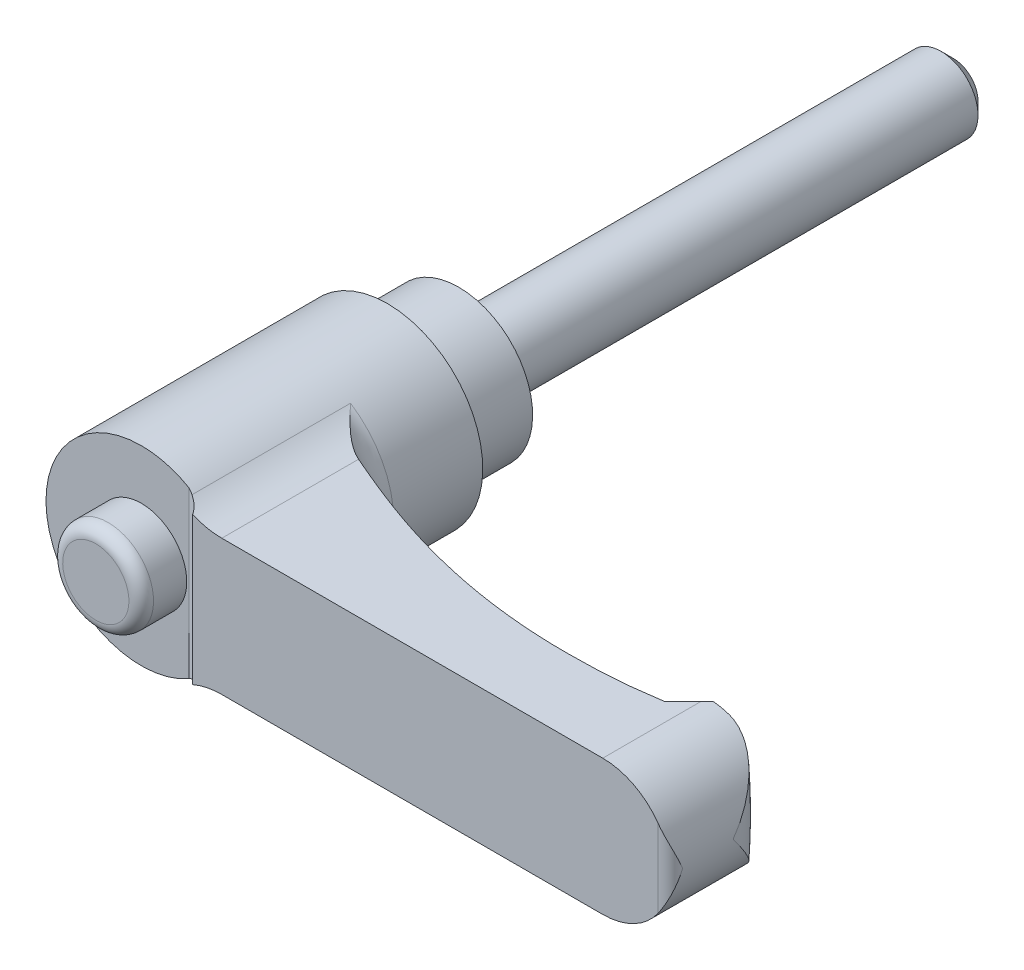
ISO-10303-21;
HEADER;
FILE_DESCRIPTION(('STEP AP214'),'2;1');
FILE_NAME('part.step','',(''),(''),'','','');
FILE_SCHEMA(('AUTOMOTIVE_DESIGN { 1 0 10303 214 1 1 1 1 }'));
ENDSEC;
DATA;
#1=APPLICATION_CONTEXT('core data for automotive mechanical design processes');
#2=APPLICATION_PROTOCOL_DEFINITION('international standard','automotive_design',2000,#1);
#3=PRODUCT_CONTEXT('',#1,'mechanical');
#4=PRODUCT('Part','Part','',(#3));
#5=PRODUCT_RELATED_PRODUCT_CATEGORY('part','',(#4));
#6=PRODUCT_DEFINITION_FORMATION('','',#4);
#7=PRODUCT_DEFINITION_CONTEXT('part definition',#1,'design');
#8=PRODUCT_DEFINITION('design','',#6,#7);
#9=PRODUCT_DEFINITION_SHAPE('','',#8);
#10=(LENGTH_UNIT() NAMED_UNIT(*) SI_UNIT(.MILLI.,.METRE.));
#11=(NAMED_UNIT(*) PLANE_ANGLE_UNIT() SI_UNIT($,.RADIAN.));
#12=(NAMED_UNIT(*) SI_UNIT($,.STERADIAN.) SOLID_ANGLE_UNIT());
#13=UNCERTAINTY_MEASURE_WITH_UNIT(LENGTH_MEASURE(1.E-05),#10,'distance_accuracy_value','');
#14=(GEOMETRIC_REPRESENTATION_CONTEXT(3) GLOBAL_UNCERTAINTY_ASSIGNED_CONTEXT((#13)) GLOBAL_UNIT_ASSIGNED_CONTEXT((#10,
#11,#12)) REPRESENTATION_CONTEXT('',''));
#15=CARTESIAN_POINT('',(0.,0.,0.));
#16=DIRECTION('',(0.,0.,1.));
#17=DIRECTION('',(1.,0.,0.));
#18=AXIS2_PLACEMENT_3D('',#15,#16,#17);
#19=CARTESIAN_POINT('',(4.8,0.,0.));
#20=DIRECTION('',(0.,0.,1.));
#21=DIRECTION('',(0.,-1.,0.));
#22=AXIS2_PLACEMENT_3D('',#19,#20,#21);
#23=PLANE('',#22);
#24=CARTESIAN_POINT('',(0.,0.,0.));
#25=DIRECTION('',(0.,0.,-1.));
#26=DIRECTION('',(0.,1.,0.));
#27=AXIS2_PLACEMENT_3D('',#24,#25,#26);
#28=CIRCLE('',#27,3.);
#29=CARTESIAN_POINT('',(0.,3.,0.));
#30=VERTEX_POINT('',#29);
#31=EDGE_CURVE('E469',#30,#30,#28,.T.);
#32=ORIENTED_EDGE('',*,*,#31,.F.);
#33=EDGE_LOOP('',(#32));
#34=FACE_BOUND('',#33,.T.);
#35=CARTESIAN_POINT('',(0.,0.,0.));
#36=DIRECTION('',(0.,0.,-1.));
#37=DIRECTION('',(0.,1.,0.));
#38=AXIS2_PLACEMENT_3D('',#35,#36,#37);
#39=CIRCLE('',#38,4.8);
#40=CARTESIAN_POINT('',(0.,4.8,0.));
#41=VERTEX_POINT('',#40);
#42=EDGE_CURVE('E417',#41,#41,#39,.T.);
#43=ORIENTED_EDGE('',*,*,#42,.T.);
#44=EDGE_LOOP('',(#43));
#45=FACE_BOUND('',#44,.T.);
#46=ADVANCED_FACE('F14',(#34,#45),#23,.F.);
#47=CARTESIAN_POINT('',(0.,0.,26.));
#48=DIRECTION('',(0.,0.,-1.));
#49=DIRECTION('',(0.,1.,0.));
#50=AXIS2_PLACEMENT_3D('',#47,#48,#49);
#51=PLANE('',#50);
#52=CARTESIAN_POINT('',(0.,0.,26.));
#53=DIRECTION('',(0.,0.,-1.));
#54=DIRECTION('',(0.,1.,0.));
#55=AXIS2_PLACEMENT_3D('',#52,#53,#54);
#56=CIRCLE('',#55,7.75);
#57=CARTESIAN_POINT('',(3.875,-6.7116968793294,26.));
#58=VERTEX_POINT('',#57);
#59=CARTESIAN_POINT('',(3.875,6.7116968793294,26.));
#60=VERTEX_POINT('',#59);
#61=EDGE_CURVE('E364',#58,#60,#56,.T.);
#62=ORIENTED_EDGE('',*,*,#61,.F.);
#63=DIRECTION('',(0.,1.,0.));
#64=VECTOR('',#63,1.);
#65=CARTESIAN_POINT('',(3.875,-11.,26.));
#66=LINE('',#65,#64);
#67=EDGE_CURVE('E451',#58,#60,#66,.T.);
#68=ORIENTED_EDGE('',*,*,#67,.T.);
#69=EDGE_LOOP('',(#62,#68));
#70=FACE_BOUND('',#69,.T.);
#71=CARTESIAN_POINT('',(0.,0.,26.));
#72=DIRECTION('',(0.,0.,-1.));
#73=DIRECTION('',(0.,1.,0.));
#74=AXIS2_PLACEMENT_3D('',#71,#72,#73);
#75=CIRCLE('',#74,3.69047619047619);
#76=CARTESIAN_POINT('',(0.,3.69047619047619,26.));
#77=VERTEX_POINT('',#76);
#78=EDGE_CURVE('E183',#77,#77,#75,.F.);
#79=ORIENTED_EDGE('',*,*,#78,.F.);
#80=EDGE_LOOP('',(#79));
#81=FACE_BOUND('',#80,.T.);
#82=ADVANCED_FACE('F158',(#70,#81),#51,.F.);
#83=CARTESIAN_POINT('',(38.5,0.,0.));
#84=DIRECTION('',(0.,0.,1.));
#85=DIRECTION('',(0.,-1.,0.));
#86=AXIS2_PLACEMENT_3D('',#83,#84,#85);
#87=CYLINDRICAL_SURFACE('',#86,5.5);
#88=CARTESIAN_POINT('',(44.,0.,21.9));
#89=CARTESIAN_POINT('',(44.0000000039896,-0.00425779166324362,21.8968685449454));
#90=CARTESIAN_POINT('',(43.9999950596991,-0.00851571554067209,21.8937369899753));
#91=CARTESIAN_POINT('',(43.9991083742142,-0.390143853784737,21.6130627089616));
#92=CARTESIAN_POINT('',(43.9593602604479,-0.76848056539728,21.3348044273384));
#93=CARTESIAN_POINT('',(43.8405607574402,-1.32856821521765,20.92503354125));
#94=CARTESIAN_POINT('',(43.7909532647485,-1.51435974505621,20.7894725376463));
#95=CARTESIAN_POINT('',(43.6715029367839,-1.88225773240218,20.5222473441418));
#96=CARTESIAN_POINT('',(43.601669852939,-2.06436592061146,20.3905813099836));
#97=CARTESIAN_POINT('',(43.4611872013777,-2.37875122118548,20.1648816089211));
#98=CARTESIAN_POINT('',(43.3950453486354,-2.51217438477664,20.0696210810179));
#99=CARTESIAN_POINT('',(43.250799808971,-2.77532702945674,19.8831417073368));
#100=CARTESIAN_POINT('',(43.1726935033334,-2.90505569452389,19.7919237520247));
#101=CARTESIAN_POINT('',(42.9202953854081,-3.28692053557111,19.5261795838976));
#102=CARTESIAN_POINT('',(42.727561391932,-3.53256609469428,19.3589622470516));
#103=CARTESIAN_POINT('',(42.3484683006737,-3.93634172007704,19.0952853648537));
#104=CARTESIAN_POINT('',(42.1735223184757,-4.10060224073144,18.9917399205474));
#105=CARTESIAN_POINT('',(41.7960798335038,-4.40966486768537,18.8081296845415));
#106=CARTESIAN_POINT('',(41.5936163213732,-4.55448986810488,18.7280371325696));
#107=CARTESIAN_POINT('',(41.2098130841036,-4.79019974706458,18.6136936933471));
#108=CARTESIAN_POINT('',(41.0333744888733,-4.88597642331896,18.5732748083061));
#109=CARTESIAN_POINT('',(40.7593164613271,-5.01555037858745,18.5310688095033));
#110=CARTESIAN_POINT('',(40.666374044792,-5.05640116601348,18.5200701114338));
#111=CARTESIAN_POINT('',(40.4779067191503,-5.13305107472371,18.5048417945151));
#112=CARTESIAN_POINT('',(40.3823830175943,-5.16885251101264,18.5006090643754));
#113=CARTESIAN_POINT('',(40.1884747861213,-5.23542428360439,18.4995076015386));
#114=CARTESIAN_POINT('',(40.090071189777,-5.26614066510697,18.5027130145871));
#115=CARTESIAN_POINT('',(39.8922874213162,-5.32184956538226,18.5171885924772));
#116=CARTESIAN_POINT('',(39.7929078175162,-5.34684523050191,18.528454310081));
#117=CARTESIAN_POINT('',(39.5942462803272,-5.39100815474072,18.5594647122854));
#118=CARTESIAN_POINT('',(39.4949643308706,-5.41017990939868,18.5792028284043));
#119=CARTESIAN_POINT('',(39.2976352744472,-5.44277299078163,18.6274002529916));
#120=CARTESIAN_POINT('',(39.1995875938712,-5.45619709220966,18.6558553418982));
#121=CARTESIAN_POINT('',(38.9984921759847,-5.47836544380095,18.7240647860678));
#122=CARTESIAN_POINT('',(38.8956289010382,-5.48667774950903,18.7645122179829));
#123=CARTESIAN_POINT('',(38.7445568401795,-5.49479244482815,18.8326405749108));
#124=CARTESIAN_POINT('',(38.6947409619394,-5.49677173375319,18.8565904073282));
#125=CARTESIAN_POINT('',(38.5963240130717,-5.49937673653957,18.9069325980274));
#126=CARTESIAN_POINT('',(38.5477229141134,-5.50000248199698,18.9333248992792));
#127=CARTESIAN_POINT('',(38.4998,-5.49999999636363,18.9609171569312));
#128=B_SPLINE_CURVE_WITH_KNOTS('',3,(#88,#89,#90,#91,#92,#93,#94,#95,#96,#97,#98,#99,#100,#101,
#102,#103,#104,#105,#106,#107,#108,#109,#110,#111,#112,#113,#114,#115,#116,#117,#118,#119,#120,
#121,#122,#123,#124,#125,#126,#127),.UNSPECIFIED.,.F.,.F.,(4,2,2,2,2,2,2,2,2,2,2,2,2,2,2,2,2,2,
2,4),(0.,0.0158565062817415,1.4211419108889,2.12636053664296,2.83123971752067,3.36110592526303,
3.89108827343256,4.94782257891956,5.7293360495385,6.50992069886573,7.12169061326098,
7.42772009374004,7.73360880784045,8.04255979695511,8.35134045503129,8.65988215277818,
8.96827473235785,9.30004722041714,9.46590364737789,9.63175620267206),.UNSPECIFIED.);
#129=CARTESIAN_POINT('',(40.2644155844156,-5.20930299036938,18.5));
#130=VERTEX_POINT('',#129);
#131=CARTESIAN_POINT('',(44.,0.,21.9));
#132=VERTEX_POINT('',#131);
#133=EDGE_CURVE('E126',#130,#132,#128,.F.);
#134=ORIENTED_EDGE('',*,*,#133,.T.);
#135=CARTESIAN_POINT('',(44.,0.,21.9));
#136=CARTESIAN_POINT('',(44.0000000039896,0.00425779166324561,21.8968685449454));
#137=CARTESIAN_POINT('',(43.9999950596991,0.00851571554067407,21.8937369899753));
#138=CARTESIAN_POINT('',(43.9991083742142,0.390143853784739,21.6130627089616));
#139=CARTESIAN_POINT('',(43.9593602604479,0.768480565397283,21.3348044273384));
#140=CARTESIAN_POINT('',(43.8405607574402,1.32856821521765,20.92503354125));
#141=CARTESIAN_POINT('',(43.7909532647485,1.51435974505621,20.7894725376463));
#142=CARTESIAN_POINT('',(43.6715029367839,1.88225773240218,20.5222473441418));
#143=CARTESIAN_POINT('',(43.601669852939,2.06436592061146,20.3905813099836));
#144=CARTESIAN_POINT('',(43.4611872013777,2.37875122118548,20.1648816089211));
#145=CARTESIAN_POINT('',(43.3950453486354,2.51217438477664,20.0696210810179));
#146=CARTESIAN_POINT('',(43.250799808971,2.77532702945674,19.8831417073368));
#147=CARTESIAN_POINT('',(43.1726935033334,2.9050556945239,19.7919237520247));
#148=CARTESIAN_POINT('',(42.9202953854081,3.28692053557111,19.5261795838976));
#149=CARTESIAN_POINT('',(42.727561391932,3.53256609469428,19.3589622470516));
#150=CARTESIAN_POINT('',(42.3484683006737,3.93634172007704,19.0952853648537));
#151=CARTESIAN_POINT('',(42.1735223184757,4.10060224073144,18.9917399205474));
#152=CARTESIAN_POINT('',(41.7960798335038,4.40966486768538,18.8081296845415));
#153=CARTESIAN_POINT('',(41.5936163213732,4.55448986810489,18.7280371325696));
#154=CARTESIAN_POINT('',(41.2098130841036,4.79019974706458,18.6136936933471));
#155=CARTESIAN_POINT('',(41.0333744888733,4.88597642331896,18.5732748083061));
#156=CARTESIAN_POINT('',(40.7593164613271,5.01555037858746,18.5310688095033));
#157=CARTESIAN_POINT('',(40.666374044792,5.05640116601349,18.5200701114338));
#158=CARTESIAN_POINT('',(40.4779067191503,5.13305107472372,18.5048417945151));
#159=CARTESIAN_POINT('',(40.3823830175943,5.16885251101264,18.5006090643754));
#160=CARTESIAN_POINT('',(40.1884747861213,5.23542428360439,18.4995076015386));
#161=CARTESIAN_POINT('',(40.090071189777,5.26614066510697,18.5027130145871));
#162=CARTESIAN_POINT('',(39.8922874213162,5.32184956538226,18.5171885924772));
#163=CARTESIAN_POINT('',(39.7929078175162,5.34684523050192,18.528454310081));
#164=CARTESIAN_POINT('',(39.5942462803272,5.39100815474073,18.5594647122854));
#165=CARTESIAN_POINT('',(39.4949643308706,5.41017990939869,18.5792028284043));
#166=CARTESIAN_POINT('',(39.2976352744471,5.44277299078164,18.6274002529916));
#167=CARTESIAN_POINT('',(39.1995875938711,5.45619709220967,18.6558553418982));
#168=CARTESIAN_POINT('',(38.9984921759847,5.47836544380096,18.7240647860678));
#169=CARTESIAN_POINT('',(38.8956289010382,5.48667774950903,18.7645122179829));
#170=CARTESIAN_POINT('',(38.7445568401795,5.49479244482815,18.8326405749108));
#171=CARTESIAN_POINT('',(38.6947409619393,5.4967717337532,18.8565904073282));
#172=CARTESIAN_POINT('',(38.5963240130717,5.49937673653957,18.9069325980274));
#173=CARTESIAN_POINT('',(38.5477229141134,5.50000248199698,18.9333248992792));
#174=CARTESIAN_POINT('',(38.4998,5.49999999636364,18.9609171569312));
#175=B_SPLINE_CURVE_WITH_KNOTS('',3,(#135,#136,#137,#138,#139,#140,#141,#142,#143,#144,#145,
#146,#147,#148,#149,#150,#151,#152,#153,#154,#155,#156,#157,#158,#159,#160,#161,#162,#163,#164,
#165,#166,#167,#168,#169,#170,#171,#172,#173,#174),.UNSPECIFIED.,.F.,.F.,(4,2,2,2,2,2,2,2,2,2,2,
2,2,2,2,2,2,2,2,4),(0.,0.0158565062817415,1.4211419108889,2.12636053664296,2.83123971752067,
3.36110592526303,3.89108827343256,4.94782257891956,5.72933604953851,6.50992069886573,
7.12169061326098,7.42772009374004,7.73360880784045,8.04255979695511,8.35134045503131,
8.6598821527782,8.9682747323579,9.30004722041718,9.46590364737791,9.63175620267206),.UNSPECIFIED.);
#176=CARTESIAN_POINT('',(40.2644155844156,5.20930299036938,18.5));
#177=VERTEX_POINT('',#176);
#178=EDGE_CURVE('E123',#132,#177,#175,.T.);
#179=ORIENTED_EDGE('',*,*,#178,.T.);
#180=CARTESIAN_POINT('',(38.5,0.,18.5));
#181=DIRECTION('',(0.,0.,-1.));
#182=DIRECTION('',(0.,1.,0.));
#183=AXIS2_PLACEMENT_3D('',#180,#181,#182);
#184=CIRCLE('',#183,5.5);
#185=CARTESIAN_POINT('',(39.,5.47722557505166,18.5));
#186=VERTEX_POINT('',#185);
#187=EDGE_CURVE('E457',#177,#186,#184,.F.);
#188=ORIENTED_EDGE('',*,*,#187,.T.);
#189=CARTESIAN_POINT('',(38.5,0.,19.));
#190=DIRECTION('',(-0.707106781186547,0.,-0.707106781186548));
#191=DIRECTION('',(-0.707106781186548,0.,0.707106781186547));
#192=AXIS2_PLACEMENT_3D('',#189,#190,#191);
#193=ELLIPSE('',#192,7.77817459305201,5.5);
#194=CARTESIAN_POINT('',(38.5,5.5,19.));
#195=VERTEX_POINT('',#194);
#196=EDGE_CURVE('E390',#186,#195,#193,.F.);
#197=ORIENTED_EDGE('',*,*,#196,.T.);
#198=DIRECTION('',(0.,0.,1.));
#199=VECTOR('',#198,1.);
#200=CARTESIAN_POINT('',(38.5,5.5,0.));
#201=LINE('',#200,#199);
#202=CARTESIAN_POINT('',(38.5,5.5,27.));
#203=VERTEX_POINT('',#202);
#204=EDGE_CURVE('E389',#195,#203,#201,.T.);
#205=ORIENTED_EDGE('',*,*,#204,.T.);
#206=CARTESIAN_POINT('',(38.5,0.,27.));
#207=DIRECTION('',(0.,0.,1.));
#208=DIRECTION('',(0.,-1.,0.));
#209=AXIS2_PLACEMENT_3D('',#206,#207,#208);
#210=CIRCLE('',#209,5.5);
#211=CARTESIAN_POINT('',(43.,3.16227766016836,27.));
#212=VERTEX_POINT('',#211);
#213=EDGE_CURVE('E367',#212,#203,#210,.T.);
#214=ORIENTED_EDGE('',*,*,#213,.F.);
#215=CARTESIAN_POINT('',(43.,3.16227766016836,27.));
#216=CARTESIAN_POINT('',(43.0489698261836,3.09261080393,26.9999556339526));
#217=CARTESIAN_POINT('',(43.0962528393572,3.0218687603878,26.9964077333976));
#218=CARTESIAN_POINT('',(43.1871872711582,2.87878712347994,26.9834058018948));
#219=CARTESIAN_POINT('',(43.2308453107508,2.80645076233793,26.9739628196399));
#220=CARTESIAN_POINT('',(43.3141980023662,2.66092047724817,26.9503365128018));
#221=CARTESIAN_POINT('',(43.3539154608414,2.58773460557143,26.9361828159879));
#222=CARTESIAN_POINT('',(43.4296865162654,2.44030003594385,26.903917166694));
#223=CARTESIAN_POINT('',(43.4657377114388,2.36605067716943,26.8858026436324));
#224=CARTESIAN_POINT('',(43.5573559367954,2.16613298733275,26.8329178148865));
#225=CARTESIAN_POINT('',(43.6095944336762,2.03971389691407,26.7951786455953));
#226=CARTESIAN_POINT('',(43.703955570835,1.78529411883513,26.7129945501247));
#227=CARTESIAN_POINT('',(43.7460735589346,1.65729273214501,26.6685465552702));
#228=CARTESIAN_POINT('',(43.8205857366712,1.39978291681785,26.5746664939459));
#229=CARTESIAN_POINT('',(43.852946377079,1.27027084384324,26.5252179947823));
#230=CARTESIAN_POINT('',(43.9079882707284,1.01058108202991,26.4229956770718));
#231=CARTESIAN_POINT('',(43.9306732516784,0.880403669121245,26.3702231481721));
#232=CARTESIAN_POINT('',(43.9654953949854,0.627432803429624,26.2658240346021));
#233=CARTESIAN_POINT('',(43.9781829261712,0.504664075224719,26.2143181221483));
#234=CARTESIAN_POINT('',(43.9952673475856,0.259135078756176,26.1104803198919));
#235=CARTESIAN_POINT('',(43.9996786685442,0.136375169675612,26.0581500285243));
#236=CARTESIAN_POINT('',(43.9999943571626,0.00909584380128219,26.0038784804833));
#237=CARTESIAN_POINT('',(43.9999999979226,0.00454789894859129,26.0019392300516));
#238=CARTESIAN_POINT('',(44.,0.,26.));
#239=B_SPLINE_CURVE_WITH_KNOTS('',3,(#215,#216,#217,#218,#219,#220,#221,#222,#223,#224,#225,
#226,#227,#228,#229,#230,#231,#232,#233,#234,#235,#236,#237,#238),.UNSPECIFIED.,.F.,.F.,(4,2,2,
2,2,2,2,2,2,2,2,4),(0.,0.255244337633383,0.510011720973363,0.763206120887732,1.01656533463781,
1.44159949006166,1.8668286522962,2.2935036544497,2.72001412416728,3.12097942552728,
3.52124493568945,3.53607734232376),.UNSPECIFIED.);
#240=CARTESIAN_POINT('',(44.,0.,26.));
#241=VERTEX_POINT('',#240);
#242=EDGE_CURVE('E169',#241,#212,#239,.F.);
#243=ORIENTED_EDGE('',*,*,#242,.F.);
#244=CARTESIAN_POINT('',(43.,-3.16227766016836,27.));
#245=CARTESIAN_POINT('',(43.0489698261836,-3.09261080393,26.9999556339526));
#246=CARTESIAN_POINT('',(43.0962528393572,-3.0218687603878,26.9964077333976));
#247=CARTESIAN_POINT('',(43.1871872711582,-2.87878712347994,26.9834058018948));
#248=CARTESIAN_POINT('',(43.2308453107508,-2.80645076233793,26.9739628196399));
#249=CARTESIAN_POINT('',(43.3141980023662,-2.66092047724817,26.9503365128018));
#250=CARTESIAN_POINT('',(43.3539154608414,-2.58773460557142,26.9361828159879));
#251=CARTESIAN_POINT('',(43.4296865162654,-2.44030003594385,26.903917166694));
#252=CARTESIAN_POINT('',(43.4657377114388,-2.36605067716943,26.8858026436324));
#253=CARTESIAN_POINT('',(43.5573559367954,-2.16613298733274,26.8329178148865));
#254=CARTESIAN_POINT('',(43.6095944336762,-2.03971389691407,26.7951786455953));
#255=CARTESIAN_POINT('',(43.703955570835,-1.78529411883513,26.7129945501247));
#256=CARTESIAN_POINT('',(43.7460735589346,-1.65729273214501,26.6685465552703));
#257=CARTESIAN_POINT('',(43.8205857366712,-1.39978291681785,26.5746664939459));
#258=CARTESIAN_POINT('',(43.852946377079,-1.27027084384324,26.5252179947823));
#259=CARTESIAN_POINT('',(43.9079882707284,-1.01058108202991,26.4229956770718));
#260=CARTESIAN_POINT('',(43.9306732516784,-0.880403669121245,26.3702231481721));
#261=CARTESIAN_POINT('',(43.9654953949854,-0.627432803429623,26.2658240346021));
#262=CARTESIAN_POINT('',(43.9781829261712,-0.504664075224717,26.2143181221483));
#263=CARTESIAN_POINT('',(43.9952673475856,-0.259135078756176,26.1104803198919));
#264=CARTESIAN_POINT('',(43.9996786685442,-0.136375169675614,26.0581500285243));
#265=CARTESIAN_POINT('',(43.9999943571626,-0.00909584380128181,26.0038784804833));
#266=CARTESIAN_POINT('',(43.9999999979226,-0.00454789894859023,26.0019392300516));
#267=CARTESIAN_POINT('',(44.,0.,26.));
#268=B_SPLINE_CURVE_WITH_KNOTS('',3,(#244,#245,#246,#247,#248,#249,#250,#251,#252,#253,#254,
#255,#256,#257,#258,#259,#260,#261,#262,#263,#264,#265,#266,#267),.UNSPECIFIED.,.F.,.F.,(4,2,2,
2,2,2,2,2,2,2,2,4),(0.,0.255244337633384,0.510011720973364,0.763206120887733,1.01656533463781,
1.44159949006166,1.8668286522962,2.2935036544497,2.72001412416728,3.12097942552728,
3.52124493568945,3.53607734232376),.UNSPECIFIED.);
#269=CARTESIAN_POINT('',(43.,-3.16227766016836,27.));
#270=VERTEX_POINT('',#269);
#271=EDGE_CURVE('E177',#270,#241,#268,.T.);
#272=ORIENTED_EDGE('',*,*,#271,.F.);
#273=CARTESIAN_POINT('',(38.5,-5.5,27.));
#274=VERTEX_POINT('',#273);
#275=EDGE_CURVE('E373',#274,#270,#210,.T.);
#276=ORIENTED_EDGE('',*,*,#275,.F.);
#277=DIRECTION('',(0.,0.,1.));
#278=VECTOR('',#277,1.);
#279=CARTESIAN_POINT('',(38.5,-5.5,0.));
#280=LINE('',#279,#278);
#281=CARTESIAN_POINT('',(38.5,-5.5,19.));
#282=VERTEX_POINT('',#281);
#283=EDGE_CURVE('E393',#282,#274,#280,.T.);
#284=ORIENTED_EDGE('',*,*,#283,.F.);
#285=CARTESIAN_POINT('',(39.,-5.47722557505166,18.5));
#286=VERTEX_POINT('',#285);
#287=EDGE_CURVE('E440',#282,#286,#193,.F.);
#288=ORIENTED_EDGE('',*,*,#287,.T.);
#289=EDGE_CURVE('E134',#286,#130,#184,.F.);
#290=ORIENTED_EDGE('',*,*,#289,.T.);
#291=EDGE_LOOP('',(#134,#179,#188,#197,#205,#214,#243,#272,#276,#284,#288,#290));
#292=FACE_BOUND('',#291,.T.);
#293=ADVANCED_FACE('F132',(#292),#87,.T.);
#294=CARTESIAN_POINT('',(40.6,-11.,18.5));
#295=DIRECTION('',(0.,0.,-1.));
#296=DIRECTION('',(0.,1.,0.));
#297=AXIS2_PLACEMENT_3D('',#294,#295,#296);
#298=PLANE('',#297);
#299=ORIENTED_EDGE('',*,*,#187,.F.);
#300=CARTESIAN_POINT('',(0.,0.,18.5));
#301=DIRECTION('',(0.,0.,-1.));
#302=DIRECTION('',(0.,1.,0.));
#303=AXIS2_PLACEMENT_3D('',#300,#301,#302);
#304=CIRCLE('',#303,40.6);
#305=EDGE_CURVE('E37',#177,#130,#304,.T.);
#306=ORIENTED_EDGE('',*,*,#305,.T.);
#307=ORIENTED_EDGE('',*,*,#289,.F.);
#308=DIRECTION('',(0.,1.,0.));
#309=VECTOR('',#308,1.);
#310=CARTESIAN_POINT('',(39.,-11.,18.5));
#311=LINE('',#310,#309);
#312=EDGE_CURVE('E448',#286,#186,#311,.T.);
#313=ORIENTED_EDGE('',*,*,#312,.T.);
#314=EDGE_LOOP('',(#299,#306,#307,#313));
#315=FACE_BOUND('',#314,.T.);
#316=ADVANCED_FACE('F157',(#315),#298,.T.);
#317=CARTESIAN_POINT('',(0.,0.,27.));
#318=DIRECTION('',(0.,0.,1.));
#319=DIRECTION('',(0.,-1.,0.));
#320=AXIS2_PLACEMENT_3D('',#317,#318,#319);
#321=PLANE('',#320);
#322=CARTESIAN_POINT('',(7.53740671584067,11.5,27.));
#323=DIRECTION('',(0.,0.,1.));
#324=DIRECTION('',(1.,0.,0.));
#325=AXIS2_PLACEMENT_3D('',#322,#323,#324);
#326=CIRCLE('',#325,6.);
#327=CARTESIAN_POINT('',(5.16666666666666,5.988231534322,27.));
#328=VERTEX_POINT('',#327);
#329=CARTESIAN_POINT('',(7.53740671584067,5.5,27.));
#330=VERTEX_POINT('',#329);
#331=EDGE_CURVE('E398',#328,#330,#326,.T.);
#332=ORIENTED_EDGE('',*,*,#331,.F.);
#333=DIRECTION('',(0.,1.,0.));
#334=VECTOR('',#333,1.);
#335=CARTESIAN_POINT('',(5.16666666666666,-11.,27.));
#336=LINE('',#335,#334);
#337=CARTESIAN_POINT('',(5.16666666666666,-5.988231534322,27.));
#338=VERTEX_POINT('',#337);
#339=EDGE_CURVE('E436',#338,#328,#336,.T.);
#340=ORIENTED_EDGE('',*,*,#339,.F.);
#341=CARTESIAN_POINT('',(7.53740671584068,-11.5,27.));
#342=DIRECTION('',(0.,0.,1.));
#343=DIRECTION('',(1.,0.,0.));
#344=AXIS2_PLACEMENT_3D('',#341,#342,#343);
#345=CIRCLE('',#344,6.);
#346=CARTESIAN_POINT('',(7.53740671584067,-5.5,27.));
#347=VERTEX_POINT('',#346);
#348=EDGE_CURVE('E401',#347,#338,#345,.T.);
#349=ORIENTED_EDGE('',*,*,#348,.F.);
#350=DIRECTION('',(-1.,0.,0.));
#351=VECTOR('',#350,1.);
#352=CARTESIAN_POINT('',(38.5,-5.5,27.));
#353=LINE('',#352,#351);
#354=EDGE_CURVE('E397',#274,#347,#353,.T.);
#355=ORIENTED_EDGE('',*,*,#354,.F.);
#356=ORIENTED_EDGE('',*,*,#275,.T.);
#357=DIRECTION('',(0.,1.,0.));
#358=VECTOR('',#357,1.);
#359=CARTESIAN_POINT('',(43.,-11.,27.));
#360=LINE('',#359,#358);
#361=EDGE_CURVE('E385',#270,#212,#360,.T.);
#362=ORIENTED_EDGE('',*,*,#361,.T.);
#363=ORIENTED_EDGE('',*,*,#213,.T.);
#364=DIRECTION('',(1.,0.,0.));
#365=VECTOR('',#364,1.);
#366=CARTESIAN_POINT('',(7.53740671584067,5.5,27.));
#367=LINE('',#366,#365);
#368=EDGE_CURVE('E384',#330,#203,#367,.T.);
#369=ORIENTED_EDGE('',*,*,#368,.F.);
#370=EDGE_LOOP('',(#332,#340,#349,#355,#356,#362,#363,#369));
#371=FACE_BOUND('',#370,.T.);
#372=ADVANCED_FACE('F240',(#371),#321,.T.);
#373=CARTESIAN_POINT('',(0.,0.,0.));
#374=DIRECTION('',(0.,0.,-1.));
#375=DIRECTION('',(0.,1.,0.));
#376=AXIS2_PLACEMENT_3D('',#373,#374,#375);
#377=CYLINDRICAL_SURFACE('',#376,7.75);
#378=CARTESIAN_POINT('',(0.,0.,13.2417430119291));
#379=DIRECTION('',(0.,0.,-1.));
#380=DIRECTION('',(0.,1.,0.));
#381=AXIS2_PLACEMENT_3D('',#378,#379,#380);
#382=CIRCLE('',#381,7.75);
#383=CARTESIAN_POINT('',(4.24835651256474,6.48181818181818,13.2417430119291));
#384=VERTEX_POINT('',#383);
#385=CARTESIAN_POINT('',(4.24835651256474,-6.48181818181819,13.2417430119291));
#386=VERTEX_POINT('',#385);
#387=EDGE_CURVE('E359',#384,#386,#382,.T.);
#388=ORIENTED_EDGE('',*,*,#387,.T.);
#389=DIRECTION('',(0.,0.,1.));
#390=VECTOR('',#389,1.);
#391=CARTESIAN_POINT('',(4.24835651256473,-6.48181818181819,0.));
#392=LINE('',#391,#390);
#393=CARTESIAN_POINT('',(4.24835651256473,-6.48181818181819,26.1308937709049));
#394=VERTEX_POINT('',#393);
#395=EDGE_CURVE('E409',#386,#394,#392,.T.);
#396=ORIENTED_EDGE('',*,*,#395,.T.);
#397=CARTESIAN_POINT('',(3.875,-6.7116968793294,26.));
#398=CARTESIAN_POINT('',(3.9487248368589,-6.66914880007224,26.0179048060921));
#399=CARTESIAN_POINT('',(4.02097408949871,-6.62579988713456,26.039874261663));
#400=CARTESIAN_POINT('',(4.16199829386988,-6.53812669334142,26.0915573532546));
#401=CARTESIAN_POINT('',(4.23077434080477,-6.49380272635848,26.1212685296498));
#402=CARTESIAN_POINT('',(4.36202505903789,-6.40634475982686,26.1868862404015));
#403=CARTESIAN_POINT('',(4.42463632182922,-6.36322379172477,26.2225378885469));
#404=CARTESIAN_POINT('',(4.54579687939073,-6.27724013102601,26.3004737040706));
#405=CARTESIAN_POINT('',(4.60434578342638,-6.23437746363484,26.3427585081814));
#406=CARTESIAN_POINT('',(4.71026264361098,-6.1546555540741,26.4283893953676));
#407=CARTESIAN_POINT('',(4.75813291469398,-6.11768751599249,26.4710140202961));
#408=CARTESIAN_POINT('',(4.8500303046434,-6.04509175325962,26.56120031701));
#409=CARTESIAN_POINT('',(4.89405965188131,-6.00946325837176,26.6087590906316));
#410=CARTESIAN_POINT('',(4.97925799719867,-5.9390764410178,26.7103994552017));
#411=CARTESIAN_POINT('',(5.02029084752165,-5.90438218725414,26.7646407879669));
#412=CARTESIAN_POINT('',(5.09738332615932,-5.83796295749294,26.8783962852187));
#413=CARTESIAN_POINT('',(5.13343386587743,-5.80624344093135,26.9379197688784));
#414=CARTESIAN_POINT('',(5.16666666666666,-5.77650894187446,27.));
#415=B_SPLINE_CURVE_WITH_KNOTS('',3,(#397,#398,#399,#400,#401,#402,#403,#404,#405,#406,#407,
#408,#409,#410,#411,#412,#413,#414),.UNSPECIFIED.,.F.,.F.,(4,2,2,2,2,2,2,2,4),(0.,
0.26081186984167,0.521540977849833,0.773092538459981,1.02466826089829,1.24638864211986,
1.4679795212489,1.6966429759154,1.92571819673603),.UNSPECIFIED.);
#416=EDGE_CURVE('E214',#58,#394,#415,.T.);
#417=ORIENTED_EDGE('',*,*,#416,.F.);
#418=ORIENTED_EDGE('',*,*,#61,.T.);
#419=CARTESIAN_POINT('',(5.16666666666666,5.77650894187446,27.));
#420=CARTESIAN_POINT('',(5.13714077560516,5.80292379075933,26.9448365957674));
#421=CARTESIAN_POINT('',(5.1053831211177,5.83091583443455,26.8916890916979));
#422=CARTESIAN_POINT('',(5.03785941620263,5.88934998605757,26.7895453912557));
#423=CARTESIAN_POINT('',(5.00209830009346,5.91978906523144,26.7405442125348));
#424=CARTESIAN_POINT('',(4.92700880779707,5.98243056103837,26.646752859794));
#425=CARTESIAN_POINT('',(4.88768622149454,6.01463008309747,26.6019560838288));
#426=CARTESIAN_POINT('',(4.80573825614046,6.08030777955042,26.5165060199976));
#427=CARTESIAN_POINT('',(4.76311181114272,6.11378636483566,26.4758540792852));
#428=CARTESIAN_POINT('',(4.63114473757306,6.21507952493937,26.3605779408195));
#429=CARTESIAN_POINT('',(4.53728284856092,6.28411879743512,26.2920994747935));
#430=CARTESIAN_POINT('',(4.3393749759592,6.42237347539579,26.1724069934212));
#431=CARTESIAN_POINT('',(4.23533663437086,6.49158871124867,26.1211801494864));
#432=CARTESIAN_POINT('',(4.08621326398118,6.5854168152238,26.0632790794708));
#433=CARTESIAN_POINT('',(4.04469277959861,6.61100425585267,26.0487072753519));
#434=CARTESIAN_POINT('',(3.96061680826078,6.66171281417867,26.0222973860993));
#435=CARTESIAN_POINT('',(3.91806319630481,6.68683464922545,26.0104547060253));
#436=CARTESIAN_POINT('',(3.8750000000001,6.7116968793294,26.));
#437=B_SPLINE_CURVE_WITH_KNOTS('',3,(#419,#420,#421,#422,#423,#424,#425,#426,#427,#428,#429,
#430,#431,#432,#433,#434,#435,#436),.UNSPECIFIED.,.F.,.F.,(4,2,2,2,2,2,2,2,4),(0.,
0.203583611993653,0.406919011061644,0.609929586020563,0.81300593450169,1.21684507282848,
1.62038324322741,1.77301957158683,1.92539700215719),.UNSPECIFIED.);
#438=CARTESIAN_POINT('',(4.24835651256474,6.48181818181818,26.1308937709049));
#439=VERTEX_POINT('',#438);
#440=EDGE_CURVE('E228',#439,#60,#437,.T.);
#441=ORIENTED_EDGE('',*,*,#440,.F.);
#442=DIRECTION('',(0.,0.,1.));
#443=VECTOR('',#442,1.);
#444=CARTESIAN_POINT('',(4.24835651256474,6.48181818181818,0.));
#445=LINE('',#444,#443);
#446=EDGE_CURVE('E415',#384,#439,#445,.T.);
#447=ORIENTED_EDGE('',*,*,#446,.F.);
#448=EDGE_LOOP('',(#388,#396,#417,#418,#441,#447));
#449=FACE_BOUND('',#448,.T.);
#450=CARTESIAN_POINT('',(0.,0.,6.));
#451=DIRECTION('',(0.,0.,-1.));
#452=DIRECTION('',(0.,1.,0.));
#453=AXIS2_PLACEMENT_3D('',#450,#451,#452);
#454=CIRCLE('',#453,7.75);
#455=CARTESIAN_POINT('',(0.,7.75,6.));
#456=VERTEX_POINT('',#455);
#457=EDGE_CURVE('E362',#456,#456,#454,.T.);
#458=ORIENTED_EDGE('',*,*,#457,.F.);
#459=EDGE_LOOP('',(#458));
#460=FACE_BOUND('',#459,.T.);
#461=ADVANCED_FACE('F238',(#449,#460),#377,.T.);
#462=CARTESIAN_POINT('',(7.53740671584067,11.5,0.));
#463=DIRECTION('',(0.,0.,1.));
#464=DIRECTION('',(0.,-1.,0.));
#465=AXIS2_PLACEMENT_3D('',#462,#463,#464);
#466=CYLINDRICAL_SURFACE('',#465,6.);
#467=DIRECTION('',(0.,0.,1.));
#468=VECTOR('',#467,1.);
#469=CARTESIAN_POINT('',(7.53740671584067,5.5,0.));
#470=LINE('',#469,#468);
#471=CARTESIAN_POINT('',(7.53740671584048,5.5,15.8847846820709));
#472=VERTEX_POINT('',#471);
#473=EDGE_CURVE('E392',#472,#330,#470,.T.);
#474=ORIENTED_EDGE('',*,*,#473,.F.);
#475=CARTESIAN_POINT('',(7.53760671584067,5.50000000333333,15.8848714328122));
#476=CARTESIAN_POINT('',(7.42056429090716,5.50000237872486,15.8340928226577));
#477=CARTESIAN_POINT('',(7.30547455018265,5.50341530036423,15.7791506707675));
#478=CARTESIAN_POINT('',(7.07949807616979,5.51642945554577,15.6622782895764));
#479=CARTESIAN_POINT('',(6.96860436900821,5.52601989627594,15.6003604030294));
#480=CARTESIAN_POINT('',(6.64350339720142,5.56296716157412,15.4067136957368));
#481=CARTESIAN_POINT('',(6.43532620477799,5.59851698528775,15.2663869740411));
#482=CARTESIAN_POINT('',(6.04665859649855,5.68493972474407,14.9793319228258));
#483=CARTESIAN_POINT('',(5.86525717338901,5.73477067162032,14.8334864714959));
#484=CARTESIAN_POINT('',(5.51460300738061,5.84825422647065,14.5326629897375));
#485=CARTESIAN_POINT('',(5.34535978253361,5.91191750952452,14.3776779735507));
#486=CARTESIAN_POINT('',(5.01722866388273,6.05200819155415,14.0618166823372));
#487=CARTESIAN_POINT('',(4.85836829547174,6.12846774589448,13.9009263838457));
#488=CARTESIAN_POINT('',(4.55010273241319,6.29360411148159,13.5765860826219));
#489=CARTESIAN_POINT('',(4.40069155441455,6.3822730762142,13.4131377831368));
#490=CARTESIAN_POINT('',(4.25307835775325,6.47872574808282,13.2470592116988));
#491=CARTESIAN_POINT('',(4.25071688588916,6.48027113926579,13.2444011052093));
#492=CARTESIAN_POINT('',(4.24835651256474,6.48181818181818,13.2417430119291));
#493=B_SPLINE_CURVE_WITH_KNOTS('',3,(#475,#476,#477,#478,#479,#480,#481,#482,#483,#484,#485,
#486,#487,#488,#489,#490,#491,#492),.UNSPECIFIED.,.F.,.F.,(4,2,2,2,2,2,2,2,4),(0.,
0.382411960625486,0.764157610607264,1.52259154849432,2.23572847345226,2.9494177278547,
3.66492808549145,4.37998074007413,4.39161142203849),.UNSPECIFIED.);
#494=EDGE_CURVE('E244',#472,#384,#493,.T.);
#495=ORIENTED_EDGE('',*,*,#494,.T.);
#496=ORIENTED_EDGE('',*,*,#446,.T.);
#497=CARTESIAN_POINT('',(5.16666666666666,5.988231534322,27.));
#498=CARTESIAN_POINT('',(5.14070328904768,5.99939986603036,26.9514536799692));
#499=CARTESIAN_POINT('',(5.11281907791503,6.01160988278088,26.9041807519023));
#500=CARTESIAN_POINT('',(5.05359296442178,6.03815743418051,26.8125079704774));
#501=CARTESIAN_POINT('',(5.02225228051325,6.05249421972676,26.7681071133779));
#502=CARTESIAN_POINT('',(4.957388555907,6.08292031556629,26.6836551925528));
#503=CARTESIAN_POINT('',(4.92394991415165,6.09895014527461,26.6435177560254));
#504=CARTESIAN_POINT('',(4.85453383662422,6.13309313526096,26.5664566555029));
#505=CARTESIAN_POINT('',(4.81855640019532,6.151206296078,26.5295329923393));
#506=CARTESIAN_POINT('',(4.74141898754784,6.19109353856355,26.4561742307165));
#507=CARTESIAN_POINT('',(4.70007605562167,6.21304611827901,26.4200283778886));
#508=CARTESIAN_POINT('',(4.61540587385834,6.25936628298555,26.3518346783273));
#509=CARTESIAN_POINT('',(4.57207832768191,6.28373422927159,26.31978744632));
#510=CARTESIAN_POINT('',(4.48259160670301,6.33561673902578,26.2589246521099));
#511=CARTESIAN_POINT('',(4.43638627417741,6.36320560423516,26.2302406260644));
#512=CARTESIAN_POINT('',(4.34298641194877,6.4207567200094,26.1772795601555));
#513=CARTESIAN_POINT('',(4.29579253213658,6.45071744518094,26.152999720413));
#514=CARTESIAN_POINT('',(4.24835651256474,6.48181818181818,26.1308937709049));
#515=B_SPLINE_CURVE_WITH_KNOTS('',3,(#497,#498,#499,#500,#501,#502,#503,#504,#505,#506,#507,
#508,#509,#510,#511,#512,#513,#514),.UNSPECIFIED.,.F.,.F.,(4,2,2,2,2,2,2,2,4),(0.,
0.168459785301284,0.336860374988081,0.500600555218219,0.664340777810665,0.841530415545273,
1.0187465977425,1.20147538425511,1.38408759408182),.UNSPECIFIED.);
#516=EDGE_CURVE('E222',#328,#439,#515,.T.);
#517=ORIENTED_EDGE('',*,*,#516,.F.);
#518=ORIENTED_EDGE('',*,*,#331,.T.);
#519=EDGE_LOOP('',(#474,#495,#496,#517,#518));
#520=FACE_BOUND('',#519,.T.);
#521=ADVANCED_FACE('F234',(#520),#466,.F.);
#522=CARTESIAN_POINT('',(7.53740671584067,5.5,0.));
#523=DIRECTION('',(0.,-1.,0.));
#524=DIRECTION('',(1.,0.,0.));
#525=AXIS2_PLACEMENT_3D('',#522,#523,#524);
#526=PLANE('',#525);
#527=CARTESIAN_POINT('',(30.0268503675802,5.5,-22.9439315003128));
#528=DIRECTION('',(0.,-1.,0.));
#529=DIRECTION('',(1.,0.,0.));
#530=AXIS2_PLACEMENT_3D('',#527,#528,#529);
#531=CIRCLE('',#530,44.);
#532=CARTESIAN_POINT('',(29.7749924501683,5.5,21.0553476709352));
#533=VERTEX_POINT('',#532);
#534=CARTESIAN_POINT('',(37.,5.5,20.5));
#535=VERTEX_POINT('',#534);
#536=EDGE_CURVE('E438',#533,#535,#531,.F.);
#537=ORIENTED_EDGE('',*,*,#536,.F.);
#538=CARTESIAN_POINT('',(21.9436856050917,5.5,20.4285815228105));
#539=CARTESIAN_POINT('',(21.2029115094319,5.5,20.3059110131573));
#540=CARTESIAN_POINT('',(20.4649826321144,5.5,20.1656901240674));
#541=CARTESIAN_POINT('',(18.9963617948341,5.5,19.8513505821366));
#542=CARTESIAN_POINT('',(18.2656705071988,5.5,19.6772288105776));
#543=CARTESIAN_POINT('',(16.8128961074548,5.5,19.2967691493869));
#544=CARTESIAN_POINT('',(16.090811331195,5.5,19.0904376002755));
#545=CARTESIAN_POINT('',(14.6559685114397,5.5,18.6477967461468));
#546=CARTESIAN_POINT('',(13.9432097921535,5.5,18.4114896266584));
#547=CARTESIAN_POINT('',(12.8749404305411,5.5,18.0348625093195));
#548=CARTESIAN_POINT('',(12.5159102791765,5.5,17.9044045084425));
#549=CARTESIAN_POINT('',(11.8001944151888,5.5,17.6372082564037));
#550=CARTESIAN_POINT('',(11.4435086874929,5.5,17.5004700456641));
#551=CARTESIAN_POINT('',(10.732274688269,5.5,17.2214557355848));
#552=CARTESIAN_POINT('',(10.3777266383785,5.5,17.0791790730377));
#553=CARTESIAN_POINT('',(9.67049294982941,5.5,16.7900916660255));
#554=CARTESIAN_POINT('',(9.31780729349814,5.5,16.6432809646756));
#555=CARTESIAN_POINT('',(8.61374307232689,5.5,16.3464161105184));
#556=CARTESIAN_POINT('',(8.26236472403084,5.5,16.1963614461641));
#557=CARTESIAN_POINT('',(7.5602010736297,5.5,15.8948338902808));
#558=CARTESIAN_POINT('',(7.20941580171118,5.5,15.7433609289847));
#559=CARTESIAN_POINT('',(6.50744095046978,5.5,15.4415733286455));
#560=CARTESIAN_POINT('',(6.15625149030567,5.5,15.2912584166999));
#561=CARTESIAN_POINT('',(5.62793742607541,5.5,15.0694562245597));
#562=CARTESIAN_POINT('',(5.45158532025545,5.5,14.9961369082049));
#563=CARTESIAN_POINT('',(5.09811730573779,5.5,14.8513669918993));
#564=CARTESIAN_POINT('',(4.92100141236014,5.5,14.7799163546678));
#565=CARTESIAN_POINT('',(4.5605943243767,5.5,14.6376146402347));
#566=CARTESIAN_POINT('',(4.37727258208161,5.5,14.5668405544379));
#567=CARTESIAN_POINT('',(4.00919151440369,5.5,14.4290929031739));
#568=CARTESIAN_POINT('',(3.82443214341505,5.5,14.3621194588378));
#569=CARTESIAN_POINT('',(3.45309773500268,5.5,14.2332037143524));
#570=CARTESIAN_POINT('',(3.26652222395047,5.5,14.1712627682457));
#571=CARTESIAN_POINT('',(2.89130395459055,5.5,14.0539247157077));
#572=CARTESIAN_POINT('',(2.70266119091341,5.5,13.9985276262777));
#573=CARTESIAN_POINT('',(2.32827959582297,5.5,13.897398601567));
#574=CARTESIAN_POINT('',(2.14260137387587,5.5,13.851444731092));
#575=CARTESIAN_POINT('',(1.76914487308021,5.5,13.769095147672));
#576=CARTESIAN_POINT('',(1.58136699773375,5.5,13.732697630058));
#577=CARTESIAN_POINT('',(1.20421453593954,5.5,13.6711783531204));
#578=CARTESIAN_POINT('',(1.01484256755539,5.5,13.6460408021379));
#579=CARTESIAN_POINT('',(0.634839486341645,5.5,13.6083407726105));
#580=CARTESIAN_POINT('',(0.444208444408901,5.5,13.5957775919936));
#581=CARTESIAN_POINT('',(0.0582481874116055,5.5,13.5838589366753));
#582=CARTESIAN_POINT('',(-0.137090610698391,5.5,13.5848056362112));
#583=CARTESIAN_POINT('',(-0.527202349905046,5.5,13.600583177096));
#584=CARTESIAN_POINT('',(-0.721975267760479,5.5,13.6154145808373));
#585=CARTESIAN_POINT('',(-1.11032173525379,5.5,13.6580559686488));
#586=CARTESIAN_POINT('',(-1.30389342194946,5.5,13.6858826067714));
#587=CARTESIAN_POINT('',(-1.68902621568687,5.5,13.7529686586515));
#588=CARTESIAN_POINT('',(-1.88058717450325,5.5,13.792228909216));
#589=CARTESIAN_POINT('',(-2.26665403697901,5.5,13.8815548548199));
#590=CARTESIAN_POINT('',(-2.46109765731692,5.5,13.9318861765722));
#591=CARTESIAN_POINT('',(-2.84766117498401,5.5,14.0407100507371));
#592=CARTESIAN_POINT('',(-3.03978104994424,5.5,14.0992026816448));
#593=CARTESIAN_POINT('',(-3.42198028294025,5.5,14.2225795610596));
#594=CARTESIAN_POINT('',(-3.61205922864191,5.5,14.2874650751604));
#595=CARTESIAN_POINT('',(-3.99046224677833,5.5,14.4221031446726));
#596=CARTESIAN_POINT('',(-4.17878640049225,5.5,14.4918554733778));
#597=CARTESIAN_POINT('',(-4.676521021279,5.5,14.6816530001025));
#598=CARTESIAN_POINT('',(-4.98473853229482,5.5,14.8048097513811));
#599=CARTESIAN_POINT('',(-5.5989323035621,5.5,15.0566129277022));
#600=CARTESIAN_POINT('',(-5.9049082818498,5.5,15.1852600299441));
#601=CARTESIAN_POINT('',(-6.51590552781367,5.5,15.4450696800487));
#602=CARTESIAN_POINT('',(-6.82092644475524,5.5,15.5762330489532));
#603=CARTESIAN_POINT('',(-7.4308151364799,5.5,15.8388677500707));
#604=CARTESIAN_POINT('',(-7.73568291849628,5.5,15.9703390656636));
#605=CARTESIAN_POINT('',(-8.34590975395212,5.5,16.2320111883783));
#606=CARTESIAN_POINT('',(-8.65126872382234,5.5,16.3622121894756));
#607=CARTESIAN_POINT('',(-9.26301038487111,5.5,16.6202018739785));
#608=CARTESIAN_POINT('',(-9.56939308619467,5.5,16.7479905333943));
#609=CARTESIAN_POINT('',(-10.18346626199,5.5,17.0002474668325));
#610=CARTESIAN_POINT('',(-10.4911565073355,5.5,17.1247162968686));
#611=CARTESIAN_POINT('',(-11.1081171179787,5.5,17.3696729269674));
#612=CARTESIAN_POINT('',(-11.4173874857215,5.5,17.4901607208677));
#613=CARTESIAN_POINT('',(-12.3376879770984,5.5,17.8409557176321));
#614=CARTESIAN_POINT('',(-12.9512257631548,5.5,18.0647504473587));
#615=CARTESIAN_POINT('',(-14.1854891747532,5.5,18.4917099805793));
#616=CARTESIAN_POINT('',(-14.8062151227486,5.5,18.6948738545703));
#617=CARTESIAN_POINT('',(-16.0550414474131,5.5,19.0786051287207));
#618=CARTESIAN_POINT('',(-16.6831460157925,5.5,19.2591589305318));
#619=CARTESIAN_POINT('',(-17.9458274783,5.5,19.5960006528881));
#620=CARTESIAN_POINT('',(-18.5804042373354,5.5,19.7522890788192));
#621=CARTESIAN_POINT('',(-19.8687426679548,5.5,20.042499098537));
#622=CARTESIAN_POINT('',(-20.5226266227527,5.5,20.175879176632));
#623=CARTESIAN_POINT('',(-21.8354017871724,5.5,20.4152377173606));
#624=CARTESIAN_POINT('',(-22.4942930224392,5.5,20.5212160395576));
#625=CARTESIAN_POINT('',(-23.8158234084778,5.5,20.7050444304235));
#626=CARTESIAN_POINT('',(-24.4784615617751,5.5,20.7829016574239));
#627=CARTESIAN_POINT('',(-25.8065399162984,5.5,20.9099991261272));
#628=CARTESIAN_POINT('',(-26.4719803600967,5.5,20.9592368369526));
#629=CARTESIAN_POINT('',(-27.8111455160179,5.5,21.0290443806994));
#630=CARTESIAN_POINT('',(-28.4848857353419,5.5,21.0493180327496));
#631=CARTESIAN_POINT('',(-29.832670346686,5.5,21.059972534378));
#632=CARTESIAN_POINT('',(-30.5067147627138,5.5,21.0503503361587));
#633=CARTESIAN_POINT('',(-31.8537233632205,5.5,21.00103018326));
#634=CARTESIAN_POINT('',(-32.5266875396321,5.5,20.9613320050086));
#635=CARTESIAN_POINT('',(-33.8701757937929,5.5,20.851796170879));
#636=CARTESIAN_POINT('',(-34.5406996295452,5.5,20.7819556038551));
#637=CARTESIAN_POINT('',(-36.5044041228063,5.5,20.5325502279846));
#638=CARTESIAN_POINT('',(-37.7925761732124,5.5,20.3114829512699));
#639=CARTESIAN_POINT('',(-40.3443280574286,5.5,19.757262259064));
#640=CARTESIAN_POINT('',(-41.6079093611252,5.5,19.4241155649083));
#641=CARTESIAN_POINT('',(-44.0962933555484,5.5,18.6492697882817));
#642=CARTESIAN_POINT('',(-45.3212216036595,5.5,18.2079745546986));
#643=CARTESIAN_POINT('',(-47.7274854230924,5.5,17.2193030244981));
#644=CARTESIAN_POINT('',(-48.9088216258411,5.5,16.6719282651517));
#645=CARTESIAN_POINT('',(-51.1734523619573,5.5,15.498540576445));
#646=CARTESIAN_POINT('',(-52.2587741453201,5.5,14.8764362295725));
#647=CARTESIAN_POINT('',(-54.3726735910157,5.5,13.5423563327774));
#648=CARTESIAN_POINT('',(-55.4012530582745,5.5,12.8303836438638));
#649=CARTESIAN_POINT('',(-57.3951593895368,5.5,11.3208515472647));
#650=CARTESIAN_POINT('',(-58.3604230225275,5.5,10.5232086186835));
#651=CARTESIAN_POINT('',(-60.2195247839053,5.5,8.84861310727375));
#652=CARTESIAN_POINT('',(-61.1133627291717,5.5,7.97166032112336));
#653=CARTESIAN_POINT('',(-62.8150803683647,5.5,6.15328374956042));
#654=CARTESIAN_POINT('',(-63.6236831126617,5.5,5.21253649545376));
#655=CARTESIAN_POINT('',(-65.1585152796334,5.5,3.2660954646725));
#656=CARTESIAN_POINT('',(-65.8847454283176,5.5,2.26040226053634));
#657=CARTESIAN_POINT('',(-67.2493974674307,5.5,0.191536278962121));
#658=CARTESIAN_POINT('',(-67.8878452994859,5.5,-0.871619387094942));
#659=CARTESIAN_POINT('',(-69.0725839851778,5.5,-3.04809766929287));
#660=CARTESIAN_POINT('',(-69.6188748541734,5.5,-4.16142027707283));
#661=CARTESIAN_POINT('',(-70.6138791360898,5.5,-6.42690481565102));
#662=CARTESIAN_POINT('',(-71.0628771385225,5.5,-7.5789417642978));
#663=CARTESIAN_POINT('',(-71.8621230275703,5.5,-9.9167744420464));
#664=CARTESIAN_POINT('',(-72.2123711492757,5.5,-11.1025700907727));
#665=CARTESIAN_POINT('',(-72.8116233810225,5.5,-13.4995512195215));
#666=CARTESIAN_POINT('',(-73.0606212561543,5.5,-14.7107382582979));
#667=CARTESIAN_POINT('',(-73.4555550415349,5.5,-17.149800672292));
#668=CARTESIAN_POINT('',(-73.6014909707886,5.5,-18.3776760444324));
#669=CARTESIAN_POINT('',(-73.7891401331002,5.5,-20.8398733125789));
#670=CARTESIAN_POINT('',(-73.8309789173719,5.5,-22.074185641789));
#671=CARTESIAN_POINT('',(-73.8104989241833,5.5,-24.5419450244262));
#672=CARTESIAN_POINT('',(-73.7481802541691,5.5,-25.7753920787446));
#673=CARTESIAN_POINT('',(-73.5198330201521,5.5,-28.2326343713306));
#674=CARTESIAN_POINT('',(-73.3538056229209,5.5,-29.4564297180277));
#675=CARTESIAN_POINT('',(-72.9192307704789,5.5,-31.8856803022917));
#676=CARTESIAN_POINT('',(-72.6506833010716,5.5,-33.091135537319));
#677=CARTESIAN_POINT('',(-72.0130528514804,5.5,-35.4749058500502));
#678=CARTESIAN_POINT('',(-71.6439893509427,5.5,-36.6532261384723));
#679=CARTESIAN_POINT('',(-70.8079450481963,5.5,-38.9746006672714));
#680=CARTESIAN_POINT('',(-70.3409642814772,5.5,-40.1176549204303));
#681=CARTESIAN_POINT('',(-69.3124410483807,5.5,-42.360356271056));
#682=CARTESIAN_POINT('',(-68.7509013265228,5.5,-43.4600046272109));
#683=CARTESIAN_POINT('',(-67.5372663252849,5.5,-45.6081393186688));
#684=CARTESIAN_POINT('',(-66.8851710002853,5.5,-46.6566256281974));
#685=CARTESIAN_POINT('',(-65.4946967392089,5.5,-48.6955922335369));
#686=CARTESIAN_POINT('',(-64.7562697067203,5.5,-49.6860397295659));
#687=CARTESIAN_POINT('',(-63.1987070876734,5.5,-51.6012967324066));
#688=CARTESIAN_POINT('',(-62.3795715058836,5.5,-52.5261062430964));
#689=CARTESIAN_POINT('',(-60.6663328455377,5.5,-54.3036958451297));
#690=CARTESIAN_POINT('',(-59.7722198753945,5.5,-55.1564664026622));
#691=CARTESIAN_POINT('',(-57.9155054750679,5.5,-56.7838668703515));
#692=CARTESIAN_POINT('',(-56.9529039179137,5.5,-57.5584966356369));
#693=CARTESIAN_POINT('',(-54.9640531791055,5.5,-59.0257183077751));
#694=CARTESIAN_POINT('',(-53.9376782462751,5.5,-59.7181397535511));
#695=CARTESIAN_POINT('',(-51.8303976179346,5.5,-61.0143176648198));
#696=CARTESIAN_POINT('',(-50.7494919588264,5.5,-61.6180741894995));
#697=CARTESIAN_POINT('',(-48.5414354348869,5.5,-62.7325236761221));
#698=CARTESIAN_POINT('',(-47.4143088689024,5.5,-63.2432647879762));
#699=CARTESIAN_POINT('',(-45.1212908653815,5.5,-64.1686883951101));
#700=CARTESIAN_POINT('',(-43.9553992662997,5.5,-64.5833704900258));
#701=CARTESIAN_POINT('',(-41.5882659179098,5.5,-65.3155534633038));
#702=CARTESIAN_POINT('',(-40.38689898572,5.5,-65.632649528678));
#703=CARTESIAN_POINT('',(-37.9619145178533,5.5,-66.1655256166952));
#704=CARTESIAN_POINT('',(-36.7382971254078,5.5,-66.3813062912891));
#705=CARTESIAN_POINT('',(-34.275334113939,5.5,-66.710907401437));
#706=CARTESIAN_POINT('',(-33.0359651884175,5.5,-66.8245529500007));
#707=CARTESIAN_POINT('',(-30.5519233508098,5.5,-66.949270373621));
#708=CARTESIAN_POINT('',(-29.3072503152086,5.5,-66.9603398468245));
#709=CARTESIAN_POINT('',(-27.4328330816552,5.5,-66.9006074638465));
#710=CARTESIAN_POINT('',(-26.8016630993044,5.5,-66.867386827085));
#711=CARTESIAN_POINT('',(-25.5412287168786,5.5,-66.7750687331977));
#712=CARTESIAN_POINT('',(-24.9119641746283,5.5,-66.7159732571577));
#713=CARTESIAN_POINT('',(-23.6563743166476,5.5,-66.5722867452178));
#714=CARTESIAN_POINT('',(-23.030048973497,5.5,-66.4876959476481));
#715=CARTESIAN_POINT('',(-21.7812881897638,5.5,-66.2935274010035));
#716=CARTESIAN_POINT('',(-21.1588527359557,5.5,-66.1839497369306));
#717=CARTESIAN_POINT('',(-19.9224424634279,5.5,-65.9411856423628));
#718=CARTESIAN_POINT('',(-19.308439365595,5.5,-65.8081429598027));
#719=CARTESIAN_POINT('',(-18.0859254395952,5.5,-65.5188448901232));
#720=CARTESIAN_POINT('',(-17.4774146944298,5.5,-65.3625891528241));
#721=CARTESIAN_POINT('',(-16.2665868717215,5.5,-65.0279717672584));
#722=CARTESIAN_POINT('',(-15.6642691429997,5.5,-64.8496124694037));
#723=CARTESIAN_POINT('',(-14.4661769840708,5.5,-64.4722099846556));
#724=CARTESIAN_POINT('',(-13.8704023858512,5.5,-64.2731673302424));
#725=CARTESIAN_POINT('',(-12.9056486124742,5.5,-63.9338479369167));
#726=CARTESIAN_POINT('',(-12.5346659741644,5.5,-63.7992210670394));
#727=CARTESIAN_POINT('',(-11.7952061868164,5.5,-63.5232565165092));
#728=CARTESIAN_POINT('',(-11.4267290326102,5.5,-63.3819188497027));
#729=CARTESIAN_POINT('',(-10.6921193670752,5.5,-63.0933840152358));
#730=CARTESIAN_POINT('',(-10.3259866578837,5.5,-62.9461873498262));
#731=CARTESIAN_POINT('',(-9.5956831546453,5.5,-62.6470255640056));
#732=CARTESIAN_POINT('',(-9.23151234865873,5.5,-62.4950604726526));
#733=CARTESIAN_POINT('',(-8.50037550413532,5.5,-62.1860779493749));
#734=CARTESIAN_POINT('',(-8.13342561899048,5.5,-62.0290224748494));
#735=CARTESIAN_POINT('',(-7.40003558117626,5.5,-61.7136665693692));
#736=CARTESIAN_POINT('',(-7.03359546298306,5.5,-61.5553660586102));
#737=CARTESIAN_POINT('',(-6.48333186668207,5.5,-61.3193380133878));
#738=CARTESIAN_POINT('',(-6.29981391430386,5.5,-61.240900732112));
#739=CARTESIAN_POINT('',(-5.93235022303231,5.5,-61.0850361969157));
#740=CARTESIAN_POINT('',(-5.74840448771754,5.5,-61.0076089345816));
#741=CARTESIAN_POINT('',(-5.37984608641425,5.5,-60.8544040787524));
#742=CARTESIAN_POINT('',(-5.1952334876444,5.5,-60.7786263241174));
#743=CARTESIAN_POINT('',(-4.82503126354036,5.5,-60.6295012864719));
#744=CARTESIAN_POINT('',(-4.63944166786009,5.5,-60.5561539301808));
#745=CARTESIAN_POINT('',(-4.27169927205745,5.5,-60.4146846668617));
#746=CARTESIAN_POINT('',(-4.08957956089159,5.5,-60.3464771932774));
#747=CARTESIAN_POINT('',(-3.72376343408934,5.5,-60.2143879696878));
#748=CARTESIAN_POINT('',(-3.54006698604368,5.5,-60.150506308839));
#749=CARTESIAN_POINT('',(-3.17073931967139,5.5,-60.0283823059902));
#750=CARTESIAN_POINT('',(-2.98510759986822,5.5,-59.9701414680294));
#751=CARTESIAN_POINT('',(-2.61170873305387,5.5,-59.8608838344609));
#752=CARTESIAN_POINT('',(-2.42394159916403,5.5,-59.8098669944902));
#753=CARTESIAN_POINT('',(-2.05048121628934,5.5,-59.7178788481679));
#754=CARTESIAN_POINT('',(-1.8648385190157,5.5,-59.6767047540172));
#755=CARTESIAN_POINT('',(-1.49157477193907,5.5,-59.6046431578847));
#756=CARTESIAN_POINT('',(-1.30395411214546,5.5,-59.5737536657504));
#757=CARTESIAN_POINT('',(-0.927389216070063,5.5,-59.5238316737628));
#758=CARTESIAN_POINT('',(-0.738447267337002,5.5,-59.504782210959));
#759=CARTESIAN_POINT('',(-0.359698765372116,5.5,-59.4795639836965));
#760=CARTESIAN_POINT('',(-0.169892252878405,5.5,-59.4733946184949));
#761=CARTESIAN_POINT('',(0.212334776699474,5.5,-59.4743236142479));
#762=CARTESIAN_POINT('',(0.40475485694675,5.5,-59.4816080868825));
#763=CARTESIAN_POINT('',(0.788635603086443,5.5,-59.5093514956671));
#764=CARTESIAN_POINT('',(0.980096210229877,5.5,-59.5298112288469));
#765=CARTESIAN_POINT('',(1.36161376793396,5.5,-59.5827503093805));
#766=CARTESIAN_POINT('',(1.55166816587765,5.5,-59.6152477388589));
#767=CARTESIAN_POINT('',(1.92968696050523,5.5,-59.6906184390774));
#768=CARTESIAN_POINT('',(2.11765124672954,5.5,-59.7334922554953));
#769=CARTESIAN_POINT('',(2.49616071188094,5.5,-59.8290441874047));
#770=CARTESIAN_POINT('',(2.686649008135,5.5,-59.8819449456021));
#771=CARTESIAN_POINT('',(3.06544849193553,5.5,-59.9949659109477));
#772=CARTESIAN_POINT('',(3.25375967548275,5.5,-60.0550861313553));
#773=CARTESIAN_POINT('',(3.62845838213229,5.5,-60.1809296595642));
#774=CARTESIAN_POINT('',(3.81484614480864,5.5,-60.2466522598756));
#775=CARTESIAN_POINT('',(4.18604548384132,5.5,-60.382357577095));
#776=CARTESIAN_POINT('',(4.37085712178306,5.5,-60.4523401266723));
#777=CARTESIAN_POINT('',(4.88279252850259,5.5,-60.6511764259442));
#778=CARTESIAN_POINT('',(5.20859584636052,5.5,-60.7834121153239));
#779=CARTESIAN_POINT('',(5.85807794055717,5.5,-61.053022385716));
#780=CARTESIAN_POINT('',(6.18175646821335,5.5,-61.1903975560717));
#781=CARTESIAN_POINT('',(6.82838986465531,5.5,-61.4670878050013));
#782=CARTESIAN_POINT('',(7.15134450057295,5.5,-61.6064034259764));
#783=CARTESIAN_POINT('',(7.79740419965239,5.5,-61.8846410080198));
#784=CARTESIAN_POINT('',(8.1205092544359,5.5,-62.0235629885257));
#785=CARTESIAN_POINT('',(8.76753190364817,5.5,-62.2993550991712));
#786=CARTESIAN_POINT('',(9.09144934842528,5.5,-62.4362255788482));
#787=CARTESIAN_POINT('',(9.74064088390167,5.5,-62.7067282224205));
#788=CARTESIAN_POINT('',(10.0659149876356,5.5,-62.8403603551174));
#789=CARTESIAN_POINT('',(10.7181024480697,5.5,-63.1034497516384));
#790=CARTESIAN_POINT('',(11.0450155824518,5.5,-63.2329075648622));
#791=CARTESIAN_POINT('',(11.7007253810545,5.5,-63.4869607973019));
#792=CARTESIAN_POINT('',(12.0295220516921,5.5,-63.6115561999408));
#793=CARTESIAN_POINT('',(13.0081152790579,5.5,-63.9731819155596));
#794=CARTESIAN_POINT('',(13.6608256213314,5.5,-64.2024130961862));
#795=CARTESIAN_POINT('',(14.9742933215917,5.5,-64.6366750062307));
#796=CARTESIAN_POINT('',(15.6350509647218,5.5,-64.8417048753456));
#797=CARTESIAN_POINT('',(16.9646987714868,5.5,-65.2255719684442));
#798=CARTESIAN_POINT('',(17.633594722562,5.5,-65.4043892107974));
#799=CARTESIAN_POINT('',(18.9782381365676,5.5,-65.734076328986));
#800=CARTESIAN_POINT('',(19.6539854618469,5.5,-65.8849467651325));
#801=CARTESIAN_POINT('',(21.0270972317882,5.5,-66.1607493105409));
#802=CARTESIAN_POINT('',(21.7245993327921,5.5,-66.2849979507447));
#803=CARTESIAN_POINT('',(23.1244857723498,5.5,-66.5020869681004));
#804=CARTESIAN_POINT('',(23.8268701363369,5.5,-66.59492718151));
#805=CARTESIAN_POINT('',(25.234936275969,5.5,-66.7484751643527));
#806=CARTESIAN_POINT('',(25.9406169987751,5.5,-66.80919256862));
#807=CARTESIAN_POINT('',(27.3541031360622,5.5,-66.8980290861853));
#808=CARTESIAN_POINT('',(28.0619087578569,5.5,-66.9261449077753));
#809=CARTESIAN_POINT('',(29.4851338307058,5.5,-66.9495267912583));
#810=CARTESIAN_POINT('',(30.2005587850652,5.5,-66.9444622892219));
#811=CARTESIAN_POINT('',(31.6304524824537,5.5,-66.9004789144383));
#812=CARTESIAN_POINT('',(32.3449211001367,5.5,-66.8615559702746));
#813=CARTESIAN_POINT('',(33.7711801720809,5.5,-66.7497486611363));
#814=CARTESIAN_POINT('',(34.4829707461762,5.5,-66.6768658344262));
#815=CARTESIAN_POINT('',(35.9022738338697,5.5,-66.4971663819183));
#816=CARTESIAN_POINT('',(36.6097859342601,5.5,-66.3903465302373));
#817=CARTESIAN_POINT('',(38.5902065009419,5.5,-66.0425179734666));
#818=CARTESIAN_POINT('',(39.8565653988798,5.5,-65.7629223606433));
#819=CARTESIAN_POINT('',(42.3597666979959,5.5,-65.0943963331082));
#820=CARTESIAN_POINT('',(43.5966126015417,5.5,-64.7054789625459));
#821=CARTESIAN_POINT('',(46.0271180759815,5.5,-63.8224961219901));
#822=CARTESIAN_POINT('',(47.220918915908,5.5,-63.3288199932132));
#823=CARTESIAN_POINT('',(49.5608038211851,5.5,-62.2389826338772));
#824=CARTESIAN_POINT('',(50.7068876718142,5.5,-61.6428209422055));
#825=CARTESIAN_POINT('',(52.9050438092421,5.5,-60.3739966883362));
#826=CARTESIAN_POINT('',(53.9589779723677,5.5,-59.7045570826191));
#827=CARTESIAN_POINT('',(56.0062745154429,5.5,-58.2787458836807));
#828=CARTESIAN_POINT('',(56.9996387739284,5.5,-57.5223769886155));
#829=CARTESIAN_POINT('',(58.9194999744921,5.5,-55.927296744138));
#830=CARTESIAN_POINT('',(59.845932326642,5.5,-55.0885076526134));
#831=CARTESIAN_POINT('',(61.6241265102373,5.5,-53.3351860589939));
#832=CARTESIAN_POINT('',(62.4758881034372,5.5,-52.4206533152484));
#833=CARTESIAN_POINT('',(64.0920227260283,5.5,-50.5300154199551));
#834=CARTESIAN_POINT('',(64.8570392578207,5.5,-49.554460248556));
#835=CARTESIAN_POINT('',(66.3019441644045,5.5,-47.5422291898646));
#836=CARTESIAN_POINT('',(66.9818332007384,5.5,-46.5055537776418));
#837=CARTESIAN_POINT('',(68.2514170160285,5.5,-44.3787515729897));
#838=CARTESIAN_POINT('',(68.8411360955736,5.5,-43.2886392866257));
#839=CARTESIAN_POINT('',(69.9263524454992,5.5,-41.0624810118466));
#840=CARTESIAN_POINT('',(70.4218497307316,5.5,-39.926435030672));
#841=CARTESIAN_POINT('',(71.3138846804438,5.5,-37.6195445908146));
#842=CARTESIAN_POINT('',(71.7106772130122,5.5,-36.4487986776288));
#843=CARTESIAN_POINT('',(72.4041335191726,5.5,-34.0780202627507));
#844=CARTESIAN_POINT('',(72.7007975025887,5.5,-32.8779878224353));
#845=CARTESIAN_POINT('',(73.1918818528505,5.5,-30.4571187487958));
#846=CARTESIAN_POINT('',(73.3862970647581,5.5,-29.2362810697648));
#847=CARTESIAN_POINT('',(73.6714664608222,5.5,-26.78255792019));
#848=CARTESIAN_POINT('',(73.7622206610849,5.5,-25.549672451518));
#849=CARTESIAN_POINT('',(73.8393765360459,5.5,-23.0819365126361));
#850=CARTESIAN_POINT('',(73.825887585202,5.5,-21.8470894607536));
#851=CARTESIAN_POINT('',(73.6949132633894,5.5,-19.3829237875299));
#852=CARTESIAN_POINT('',(73.5774279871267,5.5,-18.1536051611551));
#853=CARTESIAN_POINT('',(73.2393023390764,5.5,-15.7092382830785));
#854=CARTESIAN_POINT('',(73.0186620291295,5.5,-14.4941900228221));
#855=CARTESIAN_POINT('',(72.4758058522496,5.5,-12.0870003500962));
#856=CARTESIAN_POINT('',(72.1535899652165,5.5,-10.8948589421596));
#857=CARTESIAN_POINT('',(71.4099209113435,5.5,-8.54205410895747));
#858=CARTESIAN_POINT('',(70.9884762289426,5.5,-7.38138800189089));
#859=CARTESIAN_POINT('',(70.0493504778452,5.5,-5.09966655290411));
#860=CARTESIAN_POINT('',(69.5316694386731,5.5,-3.97861119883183));
#861=CARTESIAN_POINT('',(68.4037980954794,5.5,-1.78410601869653));
#862=CARTESIAN_POINT('',(67.7936117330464,5.5,-0.710654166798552));
#863=CARTESIAN_POINT('',(66.4850763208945,5.5,1.38109678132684));
#864=CARTESIAN_POINT('',(65.7867272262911,5.5,2.39939584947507));
#865=CARTESIAN_POINT('',(64.3063399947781,5.5,4.37433827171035));
#866=CARTESIAN_POINT('',(63.5242437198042,5.5,5.33093804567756));
#867=CARTESIAN_POINT('',(61.8823560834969,5.5,7.17495770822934));
#868=CARTESIAN_POINT('',(61.0225646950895,5.5,8.06237757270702));
#869=CARTESIAN_POINT('',(59.2313278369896,5.5,9.76190373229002));
#870=CARTESIAN_POINT('',(58.2998738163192,5.5,10.5740010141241));
#871=CARTESIAN_POINT('',(56.372039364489,5.5,12.1170940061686));
#872=CARTESIAN_POINT('',(55.3756589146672,5.5,12.8480896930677));
#873=CARTESIAN_POINT('',(53.3229250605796,5.5,14.2253729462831));
#874=CARTESIAN_POINT('',(52.2664474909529,5.5,14.8714752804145));
#875=CARTESIAN_POINT('',(50.1028217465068,5.5,16.0727652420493));
#876=CARTESIAN_POINT('',(48.9956732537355,5.5,16.6279522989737));
#877=CARTESIAN_POINT('',(47.3034150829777,5.5,17.3895298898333));
#878=CARTESIAN_POINT('',(46.7340686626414,5.5,17.6315234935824));
#879=CARTESIAN_POINT('',(45.5857447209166,5.5,18.0914622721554));
#880=CARTESIAN_POINT('',(45.0067678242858,5.5,18.3094090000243));
#881=CARTESIAN_POINT('',(43.8402756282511,5.5,18.7208742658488));
#882=CARTESIAN_POINT('',(43.2527613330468,5.5,18.9143956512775));
#883=CARTESIAN_POINT('',(42.0700556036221,5.5,19.2767849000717));
#884=CARTESIAN_POINT('',(41.4748623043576,5.5,19.4456466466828));
#885=CARTESIAN_POINT('',(39.673104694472,5.5,19.9164509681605));
#886=CARTESIAN_POINT('',(38.45641261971,5.5,20.1804788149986));
#887=CARTESIAN_POINT('',(36.0052643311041,5.5,20.6061678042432));
#888=CARTESIAN_POINT('',(34.7708079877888,5.5,20.7678282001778));
#889=CARTESIAN_POINT('',(32.9123918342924,5.5,20.9332818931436));
#890=CARTESIAN_POINT('',(32.2916449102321,5.5,20.9755945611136));
#891=CARTESIAN_POINT('',(31.0490315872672,5.5,21.0345770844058));
#892=CARTESIAN_POINT('',(30.4271654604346,5.5,21.0512525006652));
#893=CARTESIAN_POINT('',(29.1834789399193,5.5,21.0590811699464));
#894=CARTESIAN_POINT('',(28.5616585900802,5.5,21.0502422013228));
#895=CARTESIAN_POINT('',(27.3189175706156,5.5,21.0072491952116));
#896=CARTESIAN_POINT('',(26.6979968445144,5.5,20.9730968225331));
#897=CARTESIAN_POINT('',(25.7311141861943,5.5,20.900313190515));
#898=CARTESIAN_POINT('',(25.3844819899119,5.5,20.8702774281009));
#899=CARTESIAN_POINT('',(24.6920561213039,5.5,20.8024363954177));
#900=CARTESIAN_POINT('',(24.3462622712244,5.5,20.76463295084));
#901=CARTESIAN_POINT('',(23.6570828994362,5.5,20.6815014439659));
#902=CARTESIAN_POINT('',(23.3136934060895,5.5,20.6362063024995));
#903=CARTESIAN_POINT('',(22.6278956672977,5.5,20.5380483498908));
#904=CARTESIAN_POINT('',(22.2854877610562,5.5,20.4851831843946));
#905=CARTESIAN_POINT('',(21.9436856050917,5.5,20.4285815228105));
#906=B_SPLINE_CURVE_WITH_KNOTS('',3,(#538,#539,#540,#541,#542,#543,#544,#545,#546,#547,#548,
#549,#550,#551,#552,#553,#554,#555,#556,#557,#558,#559,#560,#561,#562,#563,#564,#565,#566,#567,
#568,#569,#570,#571,#572,#573,#574,#575,#576,#577,#578,#579,#580,#581,#582,#583,#584,#585,#586,
#587,#588,#589,#590,#591,#592,#593,#594,#595,#596,#597,#598,#599,#600,#601,#602,#603,#604,#605,
#606,#607,#608,#609,#610,#611,#612,#613,#614,#615,#616,#617,#618,#619,#620,#621,#622,#623,#624,
#625,#626,#627,#628,#629,#630,#631,#632,#633,#634,#635,#636,#637,#638,#639,#640,#641,#642,#643,
#644,#645,#646,#647,#648,#649,#650,#651,#652,#653,#654,#655,#656,#657,#658,#659,#660,#661,#662,
#663,#664,#665,#666,#667,#668,#669,#670,#671,#672,#673,#674,#675,#676,#677,#678,#679,#680,#681,
#682,#683,#684,#685,#686,#687,#688,#689,#690,#691,#692,#693,#694,#695,#696,#697,#698,#699,#700,
#701,#702,#703,#704,#705,#706,#707,#708,#709,#710,#711,#712,#713,#714,#715,#716,#717,#718,#719,
#720,#721,#722,#723,#724,#725,#726,#727,#728,#729,#730,#731,#732,#733,#734,#735,#736,#737,#738,
#739,#740,#741,#742,#743,#744,#745,#746,#747,#748,#749,#750,#751,#752,#753,#754,#755,#756,#757,
#758,#759,#760,#761,#762,#763,#764,#765,#766,#767,#768,#769,#770,#771,#772,#773,#774,#775,#776,
#777,#778,#779,#780,#781,#782,#783,#784,#785,#786,#787,#788,#789,#790,#791,#792,#793,#794,#795,
#796,#797,#798,#799,#800,#801,#802,#803,#804,#805,#806,#807,#808,#809,#810,#811,#812,#813,#814,
#815,#816,#817,#818,#819,#820,#821,#822,#823,#824,#825,#826,#827,#828,#829,#830,#831,#832,#833,
#834,#835,#836,#837,#838,#839,#840,#841,#842,#843,#844,#845,#846,#847,#848,#849,#850,#851,#852,
#853,#854,#855,#856,#857,#858,#859,#860,#861,#862,#863,#864,#865,#866,#867,#868,#869,#870,#871,
#872,#873,#874,#875,#876,#877,#878,#879,#880,#881,#882,#883,#884,#885,#886,#887,#888,#889,#890,
#891,#892,#893,#894,#895,#896,#897,#898,#899,#900,#901,#902,#903,#904,#905),.UNSPECIFIED.,.T.,
.F.,(4,2,2,2,2,2,2,2,2,2,2,2,2,2,2,2,2,2,2,2,2,2,2,2,2,2,2,2,2,2,2,2,2,2,2,2,2,2,2,2,2,2,2,2,2,
2,2,2,2,2,2,2,2,2,2,2,2,2,2,2,2,2,2,2,2,2,2,2,2,2,2,2,2,2,2,2,2,2,2,2,2,2,2,2,2,2,2,2,2,2,2,2,2,
2,2,2,2,2,2,2,2,2,2,2,2,2,2,2,2,2,2,2,2,2,2,2,2,2,2,2,2,2,2,2,2,2,2,2,2,2,2,2,2,2,2,2,2,2,2,2,2,
2,2,2,2,2,2,2,2,2,2,2,2,2,2,2,2,2,2,2,2,2,2,2,2,2,2,2,2,2,2,2,2,2,2,2,2,2,2,2,2,2,2,4),(0.,
2.25249284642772,4.50519300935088,6.75745028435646,9.00954344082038,10.1554862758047,
11.301421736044,12.4474740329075,13.5935154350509,14.7397388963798,15.8860190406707,
17.0320202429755,17.6049719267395,18.1779121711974,18.7674089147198,19.3569244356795,
19.946598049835,20.5362731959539,21.1099066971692,21.6834317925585,22.2561500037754,
22.8288362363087,23.4143513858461,23.9998902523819,24.5861815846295,25.172515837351,
25.7748501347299,26.3771902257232,26.9796498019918,27.5820813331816,28.5777037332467,
29.5734492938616,30.5695254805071,31.5655490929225,32.561418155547,33.5572971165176,
34.553008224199,35.5487208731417,37.5076191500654,39.4666056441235,41.4267647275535,
43.3868829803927,45.3883593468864,47.3898459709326,49.3908227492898,51.3919764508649,
53.4134505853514,55.4351308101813,57.4568260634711,59.4787166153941,63.3942854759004,
67.3096195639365,71.2105500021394,75.1114239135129,78.859870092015,82.6081969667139,
86.360211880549,90.1122364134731,93.8293158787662,97.5463625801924,101.262308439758,
104.97825368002,108.683178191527,112.388093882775,116.093237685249,119.798380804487,
123.49905299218,127.199721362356,130.900348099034,134.600975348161,138.300885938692,
142.000795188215,145.700597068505,149.400400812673,153.10227567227,156.804150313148,
160.506514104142,164.208884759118,167.918803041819,171.628718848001,175.336708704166,
179.044714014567,182.767899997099,186.491062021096,190.220587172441,193.95019965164,
195.845891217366,197.74143766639,199.636966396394,201.532488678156,203.416778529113,
205.301096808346,207.185214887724,209.069284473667,210.25318799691,211.437089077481,
212.620888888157,213.804681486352,215.002116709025,216.199629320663,216.798360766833,
217.397087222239,217.995754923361,218.594404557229,219.177783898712,219.761175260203,
220.344721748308,220.928264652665,221.498482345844,222.068589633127,222.637878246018,
223.207140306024,223.784336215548,224.361567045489,224.93966848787,225.517800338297,
226.110713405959,226.703627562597,227.296466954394,227.889283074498,228.944026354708,
229.998890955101,231.054056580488,232.109169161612,233.164099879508,234.219040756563,
235.273842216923,236.328647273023,238.40357928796,240.478585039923,242.555164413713,
244.631702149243,246.75644678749,248.881202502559,251.00532056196,253.12965307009,
255.275181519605,257.420968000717,259.566657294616,261.712550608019,265.597806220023,
269.482598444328,273.353197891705,277.223814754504,280.965060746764,284.706190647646,
288.450883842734,292.195588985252,295.910391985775,299.625166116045,303.338937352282,
307.05270800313,310.7567872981,314.460858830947,318.165117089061,321.869374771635,
325.569746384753,329.270114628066,332.970480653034,336.670847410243,340.370897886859,
344.070947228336,347.77083895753,351.470732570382,355.173211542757,358.875691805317,
362.57861454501,366.281538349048,369.99241208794,373.703309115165,375.558785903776,
377.414142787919,379.269283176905,381.124882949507,384.855267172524,388.585678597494,
390.451799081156,392.317514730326,394.182661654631,396.047685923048,397.091403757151,
398.134876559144,399.173880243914,400.213207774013),.UNSPECIFIED.);
#907=CARTESIAN_POINT('',(7.54826052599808,5.5,15.8894752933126));
#908=VERTEX_POINT('',#907);
#909=EDGE_CURVE('E289',#533,#908,#906,.T.);
#910=ORIENTED_EDGE('',*,*,#909,.T.);
#911=CARTESIAN_POINT('',(7.82339524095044,5.5,15.9970279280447));
#912=CARTESIAN_POINT('',(7.58257963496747,5.5,15.912171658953));
#913=CARTESIAN_POINT('',(7.34885923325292,5.5,15.8060863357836));
#914=CARTESIAN_POINT('',(7.01560174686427,5.5,15.6169912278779));
#915=CARTESIAN_POINT('',(6.90731503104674,5.5,15.5488914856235));
#916=CARTESIAN_POINT('',(6.69767126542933,5.5,15.402781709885));
#917=CARTESIAN_POINT('',(6.59631055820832,5.5,15.3247769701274));
#918=CARTESIAN_POINT('',(6.36692041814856,5.5,15.1290352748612));
#919=CARTESIAN_POINT('',(6.24241727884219,5.5,15.0071008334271));
#920=CARTESIAN_POINT('',(6.01399572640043,5.5,14.745406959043));
#921=CARTESIAN_POINT('',(5.91003374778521,5.5,14.6056863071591));
#922=CARTESIAN_POINT('',(5.74945984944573,5.5,14.3424479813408));
#923=CARTESIAN_POINT('',(5.6874595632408,5.5,14.2222316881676));
#924=CARTESIAN_POINT('',(5.58390198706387,5.5,13.9731528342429));
#925=CARTESIAN_POINT('',(5.54232578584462,5.5,13.8442983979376));
#926=CARTESIAN_POINT('',(5.49788468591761,5.5,13.6465382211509));
#927=CARTESIAN_POINT('',(5.48604616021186,5.5,13.5795649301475));
#928=CARTESIAN_POINT('',(5.46876636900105,5.5,13.4448088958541));
#929=CARTESIAN_POINT('',(5.46332213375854,5.5,13.3770265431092));
#930=CARTESIAN_POINT('',(5.45899210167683,5.5,13.2412568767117));
#931=CARTESIAN_POINT('',(5.46010580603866,5.5,13.1732695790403));
#932=CARTESIAN_POINT('',(5.46884379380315,5.5,13.0377353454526));
#933=CARTESIAN_POINT('',(5.4764676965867,5.5,12.9701883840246));
#934=CARTESIAN_POINT('',(5.50634204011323,5.5,12.7845575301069));
#935=CARTESIAN_POINT('',(5.53532892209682,5.5,12.6675024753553));
#936=CARTESIAN_POINT('',(5.61087040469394,5.5,12.4393189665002));
#937=CARTESIAN_POINT('',(5.65743500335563,5.5,12.3281939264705));
#938=CARTESIAN_POINT('',(5.78624736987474,5.5,12.0718399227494));
#939=CARTESIAN_POINT('',(5.87533068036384,5.5,11.9300423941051));
#940=CARTESIAN_POINT('',(6.07514026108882,5.5,11.6625857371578));
#941=CARTESIAN_POINT('',(6.1859147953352,5.5,11.5369636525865));
#942=CARTESIAN_POINT('',(6.46214261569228,5.5,11.2646894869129));
#943=CARTESIAN_POINT('',(6.63372543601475,5.5,11.1242600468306));
#944=CARTESIAN_POINT('',(6.99718693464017,5.5,10.8730456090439));
#945=CARTESIAN_POINT('',(7.18907770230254,5.5,10.7622784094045));
#946=CARTESIAN_POINT('',(7.59047110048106,5.5,10.5698218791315));
#947=CARTESIAN_POINT('',(7.80019453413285,5.5,10.4885930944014));
#948=CARTESIAN_POINT('',(8.22955649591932,5.5,10.3592416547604));
#949=CARTESIAN_POINT('',(8.44919464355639,5.5,10.3111177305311));
#950=CARTESIAN_POINT('',(8.9133259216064,5.5,10.2474300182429));
#951=CARTESIAN_POINT('',(9.15829641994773,5.5,10.2351306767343));
#952=CARTESIAN_POINT('',(9.52417019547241,5.5,10.2501451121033));
#953=CARTESIAN_POINT('',(9.64594456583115,5.5,10.2607452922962));
#954=CARTESIAN_POINT('',(9.88792541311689,5.5,10.293402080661));
#955=CARTESIAN_POINT('',(10.008132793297,5.5,10.3154517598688));
#956=CARTESIAN_POINT('',(10.2370149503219,5.5,10.3691695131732));
#957=CARTESIAN_POINT('',(10.3458854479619,5.5,10.4000062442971));
#958=CARTESIAN_POINT('',(10.5601967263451,5.5,10.4717741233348));
#959=CARTESIAN_POINT('',(10.6656394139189,5.5,10.5126995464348));
#960=CARTESIAN_POINT('',(10.8719883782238,5.5,10.6046193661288));
#961=CARTESIAN_POINT('',(10.9728969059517,5.5,10.6556086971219));
#962=CARTESIAN_POINT('',(11.1690469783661,5.5,10.7675223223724));
#963=CARTESIAN_POINT('',(11.2642894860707,5.5,10.8284449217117));
#964=CARTESIAN_POINT('',(11.435858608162,5.5,10.9513037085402));
#965=CARTESIAN_POINT('',(11.5130293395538,5.5,11.0120632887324));
#966=CARTESIAN_POINT('',(11.6613431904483,5.5,11.1405317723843));
#967=CARTESIAN_POINT('',(11.7324873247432,5.5,11.2082395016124));
#968=CARTESIAN_POINT('',(11.8679017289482,5.5,11.3501483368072));
#969=CARTESIAN_POINT('',(11.9321763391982,5.5,11.4243452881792));
#970=CARTESIAN_POINT('',(12.0530933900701,5.5,11.5786754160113));
#971=CARTESIAN_POINT('',(12.1097367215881,5.5,11.6588078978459));
#972=CARTESIAN_POINT('',(12.2546421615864,5.5,11.8875139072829));
#973=CARTESIAN_POINT('',(12.3341724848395,5.5,12.0417741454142));
#974=CARTESIAN_POINT('',(12.4636681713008,5.5,12.3621256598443));
#975=CARTESIAN_POINT('',(12.5136500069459,5.5,12.5282102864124));
#976=CARTESIAN_POINT('',(12.5792326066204,5.5,12.8537937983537));
#977=CARTESIAN_POINT('',(12.5971735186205,5.5,13.0128227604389));
#978=CARTESIAN_POINT('',(12.6052333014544,5.5,13.3315639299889));
#979=CARTESIAN_POINT('',(12.5953586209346,5.5,13.49127597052));
#980=CARTESIAN_POINT('',(12.5488904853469,5.5,13.8020621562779));
#981=CARTESIAN_POINT('',(12.5130686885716,5.5,13.95325271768));
#982=CARTESIAN_POINT('',(12.4169539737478,5.5,14.2476193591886));
#983=CARTESIAN_POINT('',(12.3566606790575,5.5,14.3907953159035));
#984=CARTESIAN_POINT('',(12.2125874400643,5.5,14.6678309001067));
#985=CARTESIAN_POINT('',(12.1284299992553,5.5,14.8014936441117));
#986=CARTESIAN_POINT('',(11.9400012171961,5.5,15.0537599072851));
#987=CARTESIAN_POINT('',(11.8357258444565,5.5,15.1723604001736));
#988=CARTESIAN_POINT('',(11.6039149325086,5.5,15.3985246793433));
#989=CARTESIAN_POINT('',(11.4753930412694,5.5,15.5050755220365));
#990=CARTESIAN_POINT('',(11.2035566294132,5.5,15.6971701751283));
#991=CARTESIAN_POINT('',(11.0602380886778,5.5,15.7827082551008));
#992=CARTESIAN_POINT('',(10.7492533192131,5.5,15.9386960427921));
#993=CARTESIAN_POINT('',(10.5805570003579,5.5,16.0070883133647));
#994=CARTESIAN_POINT('',(10.2348082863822,5.5,16.1178141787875));
#995=CARTESIAN_POINT('',(10.0577504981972,5.5,16.160130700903));
#996=CARTESIAN_POINT('',(9.67891684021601,5.5,16.2226107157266));
#997=CARTESIAN_POINT('',(9.47663305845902,5.5,16.2396808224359));
#998=CARTESIAN_POINT('',(9.07196716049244,5.5,16.2434527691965));
#999=CARTESIAN_POINT('',(8.86958516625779,5.5,16.2301719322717));
#1000=CARTESIAN_POINT('',(8.52531547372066,5.5,16.1827274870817));
#1001=CARTESIAN_POINT('',(8.38242966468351,5.5,16.1554915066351));
#1002=CARTESIAN_POINT('',(8.10005858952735,5.5,16.0868157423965));
#1003=CARTESIAN_POINT('',(7.96057571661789,5.5,16.0453662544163));
#1004=CARTESIAN_POINT('',(7.82339524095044,5.5,15.9970279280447));
#1005=B_SPLINE_CURVE_WITH_KNOTS('',3,(#911,#912,#913,#914,#915,#916,#917,#918,#919,#920,#921,
#922,#923,#924,#925,#926,#927,#928,#929,#930,#931,#932,#933,#934,#935,#936,#937,#938,#939,#940,
#941,#942,#943,#944,#945,#946,#947,#948,#949,#950,#951,#952,#953,#954,#955,#956,#957,#958,#959,
#960,#961,#962,#963,#964,#965,#966,#967,#968,#969,#970,#971,#972,#973,#974,#975,#976,#977,#978,
#979,#980,#981,#982,#983,#984,#985,#986,#987,#988,#989,#990,#991,#992,#993,#994,#995,#996,#997,
#998,#999,#1000,#1001,#1002,#1003,#1004),.UNSPECIFIED.,.T.,.F.,(4,2,2,2,2,2,2,2,2,2,2,2,2,2,2,2,
2,2,2,2,2,2,2,2,2,2,2,2,2,2,2,2,2,2,2,2,2,2,2,2,2,2,2,2,2,2,4),(0.,0.765286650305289,
1.14860853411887,1.53172640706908,2.05268963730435,2.57253581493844,2.97683505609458,
3.38075923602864,3.58453508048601,3.78821624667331,3.99188192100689,4.19553568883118,
4.55559701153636,4.91586344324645,5.41545970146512,5.91618048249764,6.57787631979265,
7.23996830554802,7.91198053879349,8.58396700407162,9.31552168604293,9.68178438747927,
10.0478256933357,10.3868129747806,10.725608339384,11.0642336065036,11.4028011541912,
11.6970495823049,11.9912483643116,12.2852601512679,12.5792375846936,13.0968797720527,
13.6142331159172,14.091960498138,14.5695771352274,15.0335440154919,15.4975180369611,
15.9692854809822,16.4411475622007,16.9398773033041,17.4387429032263,17.9826147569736,
18.5268423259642,19.1334195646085,19.7396506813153,20.1752977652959,20.6112428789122),.UNSPECIFIED.);
#1006=EDGE_CURVE('E254',#908,#472,#1005,.T.);
#1007=ORIENTED_EDGE('',*,*,#1006,.T.);
#1008=ORIENTED_EDGE('',*,*,#473,.T.);
#1009=ORIENTED_EDGE('',*,*,#368,.T.);
#1010=ORIENTED_EDGE('',*,*,#204,.F.);
#1011=DIRECTION('',(0.707106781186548,0.,-0.707106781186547));
#1012=VECTOR('',#1011,1.);
#1013=CARTESIAN_POINT('',(32.5187033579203,5.5,24.9812966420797));
#1014=LINE('',#1013,#1012);
#1015=EDGE_CURVE('E403',#535,#195,#1014,.T.);
#1016=ORIENTED_EDGE('',*,*,#1015,.F.);
#1017=EDGE_LOOP('',(#537,#910,#1007,#1008,#1009,#1010,#1016));
#1018=FACE_BOUND('',#1017,.T.);
#1019=ADVANCED_FACE('F162',(#1018),#526,.F.);
#1020=CARTESIAN_POINT('',(38.5,-5.5,0.));
#1021=DIRECTION('',(0.,1.,0.));
#1022=DIRECTION('',(-1.,0.,0.));
#1023=AXIS2_PLACEMENT_3D('',#1020,#1021,#1022);
#1024=PLANE('',#1023);
#1025=CARTESIAN_POINT('',(7.82339524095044,-5.5,15.9970279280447));
#1026=CARTESIAN_POINT('',(8.06389080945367,-5.5,16.0817699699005));
#1027=CARTESIAN_POINT('',(8.3120448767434,-5.5,16.1455492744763));
#1028=CARTESIAN_POINT('',(8.81636647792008,-5.5,16.2279408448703));
#1029=CARTESIAN_POINT('',(9.07254747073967,-5.5,16.2464726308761));
#1030=CARTESIAN_POINT('',(9.44785521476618,-5.5,16.2380055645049));
#1031=CARTESIAN_POINT('',(9.56760771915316,-5.5,16.2299423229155));
#1032=CARTESIAN_POINT('',(9.80584054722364,-5.5,16.2028272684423));
#1033=CARTESIAN_POINT('',(9.92432153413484,-5.5,16.1837814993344));
#1034=CARTESIAN_POINT('',(10.1588655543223,-5.5,16.1344812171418));
#1035=CARTESIAN_POINT('',(10.2749298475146,-5.5,16.1042327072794));
#1036=CARTESIAN_POINT('',(10.503438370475,-5.5,16.032407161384));
#1037=CARTESIAN_POINT('',(10.6158849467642,-5.5,15.9908376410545));
#1038=CARTESIAN_POINT('',(10.8235946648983,-5.5,15.9016467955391));
#1039=CARTESIAN_POINT('',(10.919372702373,-5.5,15.8552230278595));
#1040=CARTESIAN_POINT('',(11.1060695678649,-5.5,15.753560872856));
#1041=CARTESIAN_POINT('',(11.1969913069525,-5.5,15.6983278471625));
#1042=CARTESIAN_POINT('',(11.3729899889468,-5.5,15.5792617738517));
#1043=CARTESIAN_POINT('',(11.4580691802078,-5.5,15.5154320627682));
#1044=CARTESIAN_POINT('',(11.621346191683,-5.5,15.3795652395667));
#1045=CARTESIAN_POINT('',(11.699545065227,-5.5,15.3075293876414));
#1046=CARTESIAN_POINT('',(11.9027258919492,-5.5,15.0997941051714));
#1047=CARTESIAN_POINT('',(12.0198563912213,-5.5,14.9562125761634));
#1048=CARTESIAN_POINT('',(12.2249822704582,-5.5,14.6496873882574));
#1049=CARTESIAN_POINT('',(12.3129999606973,-5.5,14.4867586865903));
#1050=CARTESIAN_POINT('',(12.4484940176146,-5.5,14.1641800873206));
#1051=CARTESIAN_POINT('',(12.4991782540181,-5.5,14.0058755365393));
#1052=CARTESIAN_POINT('',(12.5715102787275,-5.5,13.6827807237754));
#1053=CARTESIAN_POINT('',(12.5931697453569,-5.5,13.5179930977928));
#1054=CARTESIAN_POINT('',(12.6061565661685,-5.5,13.1963425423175));
#1055=CARTESIAN_POINT('',(12.5990862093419,-5.5,13.0395420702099));
#1056=CARTESIAN_POINT('',(12.5584871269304,-5.5,12.7294236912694));
#1057=CARTESIAN_POINT('',(12.5249612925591,-5.5,12.5761054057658));
#1058=CARTESIAN_POINT('',(12.4331185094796,-5.5,12.278397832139));
#1059=CARTESIAN_POINT('',(12.3749921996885,-5.5,12.1339494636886));
#1060=CARTESIAN_POINT('',(12.2361164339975,-5.5,11.8564016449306));
#1061=CARTESIAN_POINT('',(12.1553646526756,-5.5,11.7233033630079));
#1062=CARTESIAN_POINT('',(11.9707525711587,-5.5,11.4669765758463));
#1063=CARTESIAN_POINT('',(11.8661721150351,-5.5,11.3442679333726));
#1064=CARTESIAN_POINT('',(11.6391629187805,-5.5,11.1167009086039));
#1065=CARTESIAN_POINT('',(11.5167296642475,-5.5,11.0118470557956));
#1066=CARTESIAN_POINT('',(11.2481649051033,-5.5,10.8146564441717));
#1067=CARTESIAN_POINT('',(11.1009565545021,-5.5,10.7237889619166));
#1068=CARTESIAN_POINT('',(10.7944947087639,-5.5,10.5654403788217));
#1069=CARTESIAN_POINT('',(10.6352366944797,-5.5,10.4979681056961));
#1070=CARTESIAN_POINT('',(10.2919501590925,-5.5,10.3808929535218));
#1071=CARTESIAN_POINT('',(10.1070562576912,-5.5,10.3338321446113));
#1072=CARTESIAN_POINT('',(9.73236074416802,-5.5,10.2678065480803));
#1073=CARTESIAN_POINT('',(9.54255719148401,-5.5,10.2488530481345));
#1074=CARTESIAN_POINT('',(9.13942621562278,-5.5,10.2372975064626));
#1075=CARTESIAN_POINT('',(8.92600053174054,-5.5,10.2481185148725));
#1076=CARTESIAN_POINT('',(8.50315364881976,-5.5,10.3017309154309));
#1077=CARTESIAN_POINT('',(8.29373550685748,-5.5,10.3445457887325));
#1078=CARTESIAN_POINT('',(7.86100039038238,-5.5,10.4666224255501));
#1079=CARTESIAN_POINT('',(7.63865613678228,-5.5,10.5493478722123));
#1080=CARTESIAN_POINT('',(7.21026291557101,-5.5,10.7498994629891));
#1081=CARTESIAN_POINT('',(7.00421496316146,-5.5,10.8677277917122));
#1082=CARTESIAN_POINT('',(6.65130628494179,-5.5,11.1124963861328));
#1083=CARTESIAN_POINT('',(6.50052439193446,-5.5,11.2337920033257));
#1084=CARTESIAN_POINT('',(6.22002588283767,-5.5,11.4987255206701));
#1085=CARTESIAN_POINT('',(6.09027440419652,-5.5,11.6423256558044));
#1086=CARTESIAN_POINT('',(5.88915300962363,-5.5,11.9115419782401));
#1087=CARTESIAN_POINT('',(5.81134231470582,-5.5,12.0323407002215));
#1088=CARTESIAN_POINT('',(5.67597210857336,-5.5,12.2849886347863));
#1089=CARTESIAN_POINT('',(5.61839454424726,-5.5,12.4168278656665));
#1090=CARTESIAN_POINT('',(5.55053096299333,-5.5,12.621463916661));
#1091=CARTESIAN_POINT('',(5.53093418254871,-5.5,12.6912522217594));
#1092=CARTESIAN_POINT('',(5.49863562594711,-5.5,12.8323922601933));
#1093=CARTESIAN_POINT('',(5.48593003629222,-5.5,12.9037431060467));
#1094=CARTESIAN_POINT('',(5.46780496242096,-5.5,13.0473219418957));
#1095=CARTESIAN_POINT('',(5.46238054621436,-5.5,13.1195493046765));
#1096=CARTESIAN_POINT('',(5.45896201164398,-5.5,13.2641547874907));
#1097=CARTESIAN_POINT('',(5.46096690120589,-5.5,13.3365328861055));
#1098=CARTESIAN_POINT('',(5.47632409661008,-5.5,13.5305329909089));
#1099=CARTESIAN_POINT('',(5.49655216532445,-5.5,13.6516706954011));
#1100=CARTESIAN_POINT('',(5.5564340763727,-5.5,13.8889452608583));
#1101=CARTESIAN_POINT('',(5.59609931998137,-5.5,14.0050791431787));
#1102=CARTESIAN_POINT('',(5.70589482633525,-5.5,14.262651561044));
#1103=CARTESIAN_POINT('',(5.7815086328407,-5.5,14.4017473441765));
#1104=CARTESIAN_POINT('',(5.9542467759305,-5.5,14.6659254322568));
#1105=CARTESIAN_POINT('',(6.05141902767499,-5.5,14.7909755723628));
#1106=CARTESIAN_POINT('',(6.29772595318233,-5.5,15.0658539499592));
#1107=CARTESIAN_POINT('',(6.45334214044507,-5.5,15.2098567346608));
#1108=CARTESIAN_POINT('',(6.78543213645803,-5.5,15.4707825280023));
#1109=CARTESIAN_POINT('',(6.96189802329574,-5.5,15.5877157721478));
#1110=CARTESIAN_POINT('',(7.25417341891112,-5.5,15.7515528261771));
#1111=CARTESIAN_POINT('',(7.36504306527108,-5.5,15.8074674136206));
#1112=CARTESIAN_POINT('',(7.59113608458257,-5.5,15.9095845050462));
#1113=CARTESIAN_POINT('',(7.70635879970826,-5.5,15.9557884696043));
#1114=CARTESIAN_POINT('',(7.82339524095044,-5.5,15.9970279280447));
#1115=B_SPLINE_CURVE_WITH_KNOTS('',3,(#1025,#1026,#1027,#1028,#1029,#1030,#1031,#1032,#1033,
#1034,#1035,#1036,#1037,#1038,#1039,#1040,#1041,#1042,#1043,#1044,#1045,#1046,#1047,#1048,#1049,
#1050,#1051,#1052,#1053,#1054,#1055,#1056,#1057,#1058,#1059,#1060,#1061,#1062,#1063,#1064,#1065,
#1066,#1067,#1068,#1069,#1070,#1071,#1072,#1073,#1074,#1075,#1076,#1077,#1078,#1079,#1080,#1081,
#1082,#1083,#1084,#1085,#1086,#1087,#1088,#1089,#1090,#1091,#1092,#1093,#1094,#1095,#1096,#1097,
#1098,#1099,#1100,#1101,#1102,#1103,#1104,#1105,#1106,#1107,#1108,#1109,#1110,#1111,#1112,#1113,
#1114),.UNSPECIFIED.,.T.,.F.,(4,2,2,2,2,2,2,2,2,2,2,2,2,2,2,2,2,2,2,2,2,2,2,2,2,2,2,2,2,2,2,2,2,
2,2,2,2,2,2,2,2,2,2,2,4),(0.,0.764491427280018,1.53034163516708,1.88999675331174,
2.24945413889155,2.60871917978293,2.9677462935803,3.28660193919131,3.60526425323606,
3.92380324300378,4.24229338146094,4.7948365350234,5.34695526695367,5.84304111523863,
6.33892729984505,6.8075478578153,7.27611720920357,7.74112006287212,8.2061707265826,
8.68777275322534,9.16949677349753,9.68633057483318,10.2033591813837,10.7734089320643,
11.3436875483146,11.982177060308,12.6211356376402,13.3297325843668,14.0383736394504,
14.6169105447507,15.1944783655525,15.6240809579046,16.0532992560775,16.2704719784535,
16.4875243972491,16.7044297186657,16.9213060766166,17.2878416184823,17.654592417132,
18.1269487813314,18.6003656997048,19.2331159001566,19.8656264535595,20.2377199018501,
20.6097573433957),.UNSPECIFIED.);
#1116=CARTESIAN_POINT('',(7.53740671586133,-5.5,15.8847846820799));
#1117=VERTEX_POINT('',#1116);
#1118=CARTESIAN_POINT('',(7.54826052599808,-5.5,15.8894752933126));
#1119=VERTEX_POINT('',#1118);
#1120=EDGE_CURVE('E279',#1117,#1119,#1115,.T.);
#1121=ORIENTED_EDGE('',*,*,#1120,.T.);
#1122=CARTESIAN_POINT('',(21.9436856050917,-5.5,20.4285815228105));
#1123=CARTESIAN_POINT('',(22.5812317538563,-5.5,20.5341541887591));
#1124=CARTESIAN_POINT('',(23.2209744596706,-5.5,20.6267445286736));
#1125=CARTESIAN_POINT('',(24.5038122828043,-5.5,20.7853699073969));
#1126=CARTESIAN_POINT('',(25.1469078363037,-5.5,20.8514013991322));
#1127=CARTESIAN_POINT('',(26.4355663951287,-5.5,20.9564801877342));
#1128=CARTESIAN_POINT('',(27.0811302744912,-5.5,20.9955168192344));
#1129=CARTESIAN_POINT('',(28.3733894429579,-5.5,21.0462431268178));
#1130=CARTESIAN_POINT('',(29.0200848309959,-5.5,21.057930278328));
#1131=CARTESIAN_POINT('',(30.3134154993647,-5.5,21.0537260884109));
#1132=CARTESIAN_POINT('',(30.9600507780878,-5.5,21.0378341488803));
#1133=CARTESIAN_POINT('',(32.2520617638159,-5.5,20.9783488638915));
#1134=CARTESIAN_POINT('',(32.8974373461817,-5.5,20.9347529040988));
#1135=CARTESIAN_POINT('',(34.8295987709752,-5.5,20.762312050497));
#1136=CARTESIAN_POINT('',(36.1129360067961,-5.5,20.5918126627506));
#1137=CARTESIAN_POINT('',(38.6529993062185,-5.5,20.141452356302));
#1138=CARTESIAN_POINT('',(39.9098311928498,-5.5,19.8621830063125));
#1139=CARTESIAN_POINT('',(42.3946847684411,-5.5,19.1958097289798));
#1140=CARTESIAN_POINT('',(43.6227055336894,-5.5,18.8087023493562));
#1141=CARTESIAN_POINT('',(46.0407126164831,-5.5,17.9291202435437));
#1142=CARTESIAN_POINT('',(47.2306905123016,-5.5,17.4366223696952));
#1143=CARTESIAN_POINT('',(49.5631808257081,-5.5,16.3497947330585));
#1144=CARTESIAN_POINT('',(50.7056946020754,-5.5,15.7554678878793));
#1145=CARTESIAN_POINT('',(52.9011278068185,-5.5,14.4885667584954));
#1146=CARTESIAN_POINT('',(53.9557044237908,-5.5,13.8188619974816));
#1147=CARTESIAN_POINT('',(56.0042373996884,-5.5,12.392413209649));
#1148=CARTESIAN_POINT('',(56.9981949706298,-5.5,11.6356709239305));
#1149=CARTESIAN_POINT('',(58.9180339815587,-5.5,10.0406943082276));
#1150=CARTESIAN_POINT('',(59.8439309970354,-5.5,9.20247872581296));
#1151=CARTESIAN_POINT('',(61.6211508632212,-5.5,7.45039595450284));
#1152=CARTESIAN_POINT('',(62.4724737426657,-5.5,6.53652879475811));
#1153=CARTESIAN_POINT('',(64.0882224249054,-5.5,4.64685091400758));
#1154=CARTESIAN_POINT('',(64.8532535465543,-5.5,3.67155768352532));
#1155=CARTESIAN_POINT('',(66.2982246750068,-5.5,1.65985616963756));
#1156=CARTESIAN_POINT('',(66.9781652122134,-5.5,0.623448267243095));
#1157=CARTESIAN_POINT('',(68.2480912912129,-5.5,-1.5031552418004));
#1158=CARTESIAN_POINT('',(68.8380724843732,-5.5,-2.59335344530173));
#1159=CARTESIAN_POINT('',(69.92378928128,-5.5,-4.81971191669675));
#1160=CARTESIAN_POINT('',(70.4195249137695,-5.5,-5.95587217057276));
#1161=CARTESIAN_POINT('',(71.3119546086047,-5.5,-8.26287402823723));
#1162=CARTESIAN_POINT('',(71.708915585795,-5.5,-9.43361238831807));
#1163=CARTESIAN_POINT('',(72.4027049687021,-5.5,-11.8043907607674));
#1164=CARTESIAN_POINT('',(72.6995335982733,-5.5,-13.0044307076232));
#1165=CARTESIAN_POINT('',(73.1909238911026,-5.5,-15.4252392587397));
#1166=CARTESIAN_POINT('',(73.3854879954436,-5.5,-16.6460073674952));
#1167=CARTESIAN_POINT('',(73.6709643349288,-5.5,-19.099603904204));
#1168=CARTESIAN_POINT('',(73.7618765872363,-5.5,-20.3324323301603));
#1169=CARTESIAN_POINT('',(73.8393577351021,-5.5,-22.8001085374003));
#1170=CARTESIAN_POINT('',(73.8260325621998,-5.5,-24.0349529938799));
#1171=CARTESIAN_POINT('',(73.6953857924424,-5.5,-26.4991273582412));
#1172=CARTESIAN_POINT('',(73.5780642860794,-5.5,-27.7284572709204));
#1173=CARTESIAN_POINT('',(73.240263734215,-5.5,-30.1728696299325));
#1174=CARTESIAN_POINT('',(73.0197839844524,-5.5,-31.3879519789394));
#1175=CARTESIAN_POINT('',(72.4772450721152,-5.5,-33.7952231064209));
#1176=CARTESIAN_POINT('',(72.1551858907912,-5.5,-34.9874118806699));
#1177=CARTESIAN_POINT('',(71.4118301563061,-5.5,-37.3403088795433));
#1178=CARTESIAN_POINT('',(70.990543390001,-5.5,-38.5010201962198));
#1179=CARTESIAN_POINT('',(70.0517299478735,-5.5,-40.7828455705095));
#1180=CARTESIAN_POINT('',(69.5342033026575,-5.5,-41.9039596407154));
#1181=CARTESIAN_POINT('',(68.4066257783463,-5.5,-44.0986154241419));
#1182=CARTESIAN_POINT('',(67.7965771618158,-5.5,-45.1721582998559));
#1183=CARTESIAN_POINT('',(66.4883082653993,-5.5,-47.2641020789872));
#1184=CARTESIAN_POINT('',(65.7900879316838,-5.5,-48.2825029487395));
#1185=CARTESIAN_POINT('',(64.3099457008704,-5.5,-50.2576623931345));
#1186=CARTESIAN_POINT('',(63.5279653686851,-5.5,-51.2143771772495));
#1187=CARTESIAN_POINT('',(61.8862996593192,-5.5,-53.0586345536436));
#1188=CARTESIAN_POINT('',(61.0266142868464,-5.5,-53.9461771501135));
#1189=CARTESIAN_POINT('',(59.2355984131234,-5.5,-55.645934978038));
#1190=CARTESIAN_POINT('',(58.3042612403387,-5.5,-56.4581431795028));
#1191=CARTESIAN_POINT('',(56.3766610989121,-5.5,-58.0014656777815));
#1192=CARTESIAN_POINT('',(55.3803979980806,-5.5,-58.7325798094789));
#1193=CARTESIAN_POINT('',(53.3277765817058,-5.5,-60.1101735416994));
#1194=CARTESIAN_POINT('',(52.271289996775,-5.5,-60.7564620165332));
#1195=CARTESIAN_POINT('',(50.1077929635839,-5.5,-61.9580548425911));
#1196=CARTESIAN_POINT('',(49.0007825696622,-5.5,-62.5133592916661));
#1197=CARTESIAN_POINT('',(46.7445284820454,-5.5,-63.5290680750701));
#1198=CARTESIAN_POINT('',(45.5952999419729,-5.5,-63.9895060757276));
#1199=CARTESIAN_POINT('',(43.2623941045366,-5.5,-64.8127455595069));
#1200=CARTESIAN_POINT('',(42.0787165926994,-5.5,-65.1755464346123));
#1201=CARTESIAN_POINT('',(39.6792736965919,-5.5,-65.8028763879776));
#1202=CARTESIAN_POINT('',(38.4633775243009,-5.5,-66.0669053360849));
#1203=CARTESIAN_POINT('',(36.0138910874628,-5.5,-66.4927580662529));
#1204=CARTESIAN_POINT('',(34.7803010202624,-5.5,-66.6545829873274));
#1205=CARTESIAN_POINT('',(32.3025110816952,-5.5,-66.8757034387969));
#1206=CARTESIAN_POINT('',(31.058301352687,-5.5,-66.9348901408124));
#1207=CARTESIAN_POINT('',(29.1917845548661,-5.5,-66.9470169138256));
#1208=CARTESIAN_POINT('',(28.5694906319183,-5.5,-66.9382769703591));
#1209=CARTESIAN_POINT('',(27.3257888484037,-5.5,-66.8954478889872));
#1210=CARTESIAN_POINT('',(26.7043809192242,-5.5,-66.8613608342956));
#1211=CARTESIAN_POINT('',(25.4520294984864,-5.5,-66.7672479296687));
#1212=CARTESIAN_POINT('',(24.8211212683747,-5.5,-66.7067557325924));
#1213=CARTESIAN_POINT('',(23.5623367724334,-5.5,-66.5601602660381));
#1214=CARTESIAN_POINT('',(22.9344602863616,-5.5,-66.4740588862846));
#1215=CARTESIAN_POINT('',(21.6827013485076,-5.5,-66.2767662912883));
#1216=CARTESIAN_POINT('',(21.0588186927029,-5.5,-66.1655763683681));
#1217=CARTESIAN_POINT('',(19.8159113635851,-5.5,-65.9187755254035));
#1218=CARTESIAN_POINT('',(19.1968866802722,-5.5,-65.7831646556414));
#1219=CARTESIAN_POINT('',(17.9670236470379,-5.5,-65.4889982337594));
#1220=CARTESIAN_POINT('',(17.3561620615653,-5.5,-65.3305396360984));
#1221=CARTESIAN_POINT('',(16.1406444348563,-5.5,-64.9913778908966));
#1222=CARTESIAN_POINT('',(15.5359885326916,-5.5,-64.8106742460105));
#1223=CARTESIAN_POINT('',(14.3333497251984,-5.5,-64.428541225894));
#1224=CARTESIAN_POINT('',(13.7353661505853,-5.5,-64.2271139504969));
#1225=CARTESIAN_POINT('',(12.5460579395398,-5.5,-63.8055573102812));
#1226=CARTESIAN_POINT('',(11.9547332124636,-5.5,-63.5854282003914));
#1227=CARTESIAN_POINT('',(11.0531153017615,-5.5,-63.236017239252));
#1228=CARTESIAN_POINT('',(10.7406246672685,-5.5,-63.1123525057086));
#1229=CARTESIAN_POINT('',(10.1171826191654,-5.5,-62.861203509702));
#1230=CARTESIAN_POINT('',(9.80623120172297,-5.5,-62.7337192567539));
#1231=CARTESIAN_POINT('',(9.18557615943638,-5.5,-62.4757076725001));
#1232=CARTESIAN_POINT('',(8.87587260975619,-5.5,-62.3451801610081));
#1233=CARTESIAN_POINT('',(8.2573242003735,-5.5,-62.0821184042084));
#1234=CARTESIAN_POINT('',(7.94847933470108,-5.5,-61.9495841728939));
#1235=CARTESIAN_POINT('',(7.32871974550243,-5.5,-61.6828665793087));
#1236=CARTESIAN_POINT('',(7.01780713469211,-5.5,-61.5486783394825));
#1237=CARTESIAN_POINT('',(6.3954125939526,-5.5,-61.2815526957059));
#1238=CARTESIAN_POINT('',(6.08393062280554,-5.5,-61.1486153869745));
#1239=CARTESIAN_POINT('',(5.45936220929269,-5.5,-60.8867045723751));
#1240=CARTESIAN_POINT('',(5.1462760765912,-5.5,-60.7577303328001));
#1241=CARTESIAN_POINT('',(4.51703051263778,-5.5,-60.5075201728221));
#1242=CARTESIAN_POINT('',(4.20087161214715,-5.5,-60.3862829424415));
#1243=CARTESIAN_POINT('',(3.71966761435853,-5.5,-60.2131249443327));
#1244=CARTESIAN_POINT('',(3.55639401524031,-5.5,-60.1563193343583));
#1245=CARTESIAN_POINT('',(3.22839013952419,-5.5,-60.0471150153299));
#1246=CARTESIAN_POINT('',(3.06365984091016,-5.5,-59.9947163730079));
#1247=CARTESIAN_POINT('',(2.56694124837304,-5.5,-59.8457133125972));
#1248=CARTESIAN_POINT('',(2.23235182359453,-5.5,-59.7572743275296));
#1249=CARTESIAN_POINT('',(1.72833376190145,-5.5,-59.6491255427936));
#1250=CARTESIAN_POINT('',(1.56148208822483,-5.5,-59.6173403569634));
#1251=CARTESIAN_POINT('',(1.22631381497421,-5.5,-59.5626230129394));
#1252=CARTESIAN_POINT('',(1.05799726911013,-5.5,-59.5396905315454));
#1253=CARTESIAN_POINT('',(0.72043536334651,-5.5,-59.5036742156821));
#1254=CARTESIAN_POINT('',(0.551190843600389,-5.5,-59.4905826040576));
#1255=CARTESIAN_POINT('',(0.212212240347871,-5.5,-59.4748385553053));
#1256=CARTESIAN_POINT('',(0.0424781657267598,-5.5,-59.4721859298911));
#1257=CARTESIAN_POINT('',(-0.298171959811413,-5.5,-59.4774724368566));
#1258=CARTESIAN_POINT('',(-0.469086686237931,-5.5,-59.4854958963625));
#1259=CARTESIAN_POINT('',(-0.810109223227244,-5.5,-59.511884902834));
#1260=CARTESIAN_POINT('',(-0.980217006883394,-5.5,-59.5302507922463));
#1261=CARTESIAN_POINT('',(-1.31926184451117,-5.5,-59.5764995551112));
#1262=CARTESIAN_POINT('',(-1.488197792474,-5.5,-59.6043904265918));
#1263=CARTESIAN_POINT('',(-1.82445537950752,-5.5,-59.6685576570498));
#1264=CARTESIAN_POINT('',(-1.99177696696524,-5.5,-59.70483428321));
#1265=CARTESIAN_POINT('',(-2.32806020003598,-5.5,-59.7853403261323));
#1266=CARTESIAN_POINT('',(-2.4969865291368,-5.5,-59.8297158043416));
#1267=CARTESIAN_POINT('',(-2.83308842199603,-5.5,-59.9246162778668));
#1268=CARTESIAN_POINT('',(-3.00026397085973,-5.5,-59.975141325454));
#1269=CARTESIAN_POINT('',(-3.33302134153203,-5.5,-60.0811617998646));
#1270=CARTESIAN_POINT('',(-3.49860315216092,-5.5,-60.1366572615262));
#1271=CARTESIAN_POINT('',(-3.82837383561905,-5.5,-60.2515918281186));
#1272=CARTESIAN_POINT('',(-3.99256278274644,-5.5,-60.3110307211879));
#1273=CARTESIAN_POINT('',(-4.47079748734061,-5.5,-60.4892175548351));
#1274=CARTESIAN_POINT('',(-4.78330490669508,-5.5,-60.6120769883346));
#1275=CARTESIAN_POINT('',(-5.40572584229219,-5.5,-60.8642261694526));
#1276=CARTESIAN_POINT('',(-5.71563893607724,-5.5,-60.9935169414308));
#1277=CARTESIAN_POINT('',(-6.33429639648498,-5.5,-61.2552279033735));
#1278=CARTESIAN_POINT('',(-6.64304018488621,-5.5,-61.3876494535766));
#1279=CARTESIAN_POINT('',(-7.26020849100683,-5.5,-61.6531709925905));
#1280=CARTESIAN_POINT('',(-7.56863302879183,-5.5,-61.7862709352));
#1281=CARTESIAN_POINT('',(-8.18601747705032,-5.5,-62.0514810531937));
#1282=CARTESIAN_POINT('',(-8.49497751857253,-5.5,-62.1835909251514));
#1283=CARTESIAN_POINT('',(-9.11387687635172,-5.5,-62.4455146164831));
#1284=CARTESIAN_POINT('',(-9.4238162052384,-5.5,-62.5753284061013));
#1285=CARTESIAN_POINT('',(-10.044972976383,-5.5,-62.8316710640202));
#1286=CARTESIAN_POINT('',(-10.3561901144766,-5.5,-62.9582006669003));
#1287=CARTESIAN_POINT('',(-10.9802158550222,-5.5,-63.2072711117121));
#1288=CARTESIAN_POINT('',(-11.2930244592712,-5.5,-63.3298119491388));
#1289=CARTESIAN_POINT('',(-12.2259871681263,-5.5,-63.687442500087));
#1290=CARTESIAN_POINT('',(-12.8487134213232,-5.5,-63.9158914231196));
#1291=CARTESIAN_POINT('',(-14.1015871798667,-5.5,-64.3516375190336));
#1292=CARTESIAN_POINT('',(-14.7317351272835,-5.5,-64.5589334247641));
#1293=CARTESIAN_POINT('',(-15.9995896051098,-5.5,-64.9502580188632));
#1294=CARTESIAN_POINT('',(-16.6372998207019,-5.5,-65.1342748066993));
#1295=CARTESIAN_POINT('',(-17.9194089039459,-5.5,-65.4773047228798));
#1296=CARTESIAN_POINT('',(-18.5638076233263,-5.5,-65.6363184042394));
#1297=CARTESIAN_POINT('',(-19.8717885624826,-5.5,-65.9311443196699));
#1298=CARTESIAN_POINT('',(-20.5354933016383,-5.5,-66.0664143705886));
#1299=CARTESIAN_POINT('',(-21.8680497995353,-5.5,-66.3087158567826));
#1300=CARTESIAN_POINT('',(-22.5369015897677,-5.5,-66.4157471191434));
#1301=CARTESIAN_POINT('',(-23.8784400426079,-5.5,-66.6008161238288));
#1302=CARTESIAN_POINT('',(-24.5511256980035,-5.5,-66.6788611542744));
#1303=CARTESIAN_POINT('',(-25.8993331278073,-5.5,-66.8054503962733));
#1304=CARTESIAN_POINT('',(-26.574855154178,-5.5,-66.8539919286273));
#1305=CARTESIAN_POINT('',(-27.9336655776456,-5.5,-66.9214704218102));
#1306=CARTESIAN_POINT('',(-28.6169678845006,-5.5,-66.9401285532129));
#1307=CARTESIAN_POINT('',(-29.983791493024,-5.5,-66.9466864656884));
#1308=CARTESIAN_POINT('',(-30.6673128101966,-5.5,-66.9345829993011));
#1309=CARTESIAN_POINT('',(-32.0331222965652,-5.5,-66.879435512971));
#1310=CARTESIAN_POINT('',(-32.7154104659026,-5.5,-66.8363914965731));
#1311=CARTESIAN_POINT('',(-34.0773393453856,-5.5,-66.7193053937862));
#1312=CARTESIAN_POINT('',(-34.7569797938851,-5.5,-66.6452603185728));
#1313=CARTESIAN_POINT('',(-36.7282088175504,-5.5,-66.3847524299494));
#1314=CARTESIAN_POINT('',(-38.0146332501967,-5.5,-66.1572786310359));
#1315=CARTESIAN_POINT('',(-40.5623248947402,-5.5,-65.5904495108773));
#1316=CARTESIAN_POINT('',(-41.8235939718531,-5.5,-65.2511025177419));
#1317=CARTESIAN_POINT('',(-44.307047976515,-5.5,-64.4640706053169));
#1318=CARTESIAN_POINT('',(-45.5293545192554,-5.5,-64.0167700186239));
#1319=CARTESIAN_POINT('',(-47.9298701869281,-5.5,-63.0163578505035));
#1320=CARTESIAN_POINT('',(-49.1080797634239,-5.5,-62.4632473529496));
#1321=CARTESIAN_POINT('',(-51.3662244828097,-5.5,-61.2788633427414));
#1322=CARTESIAN_POINT('',(-52.4482001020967,-5.5,-60.6514762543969));
#1323=CARTESIAN_POINT('',(-54.5549773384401,-5.5,-59.3071457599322));
#1324=CARTESIAN_POINT('',(-55.5797808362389,-5.5,-58.5902053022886));
#1325=CARTESIAN_POINT('',(-57.5656978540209,-5.5,-57.0711102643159));
#1326=CARTESIAN_POINT('',(-58.526750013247,-5.5,-56.2688754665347));
#1327=CARTESIAN_POINT('',(-60.3770678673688,-5.5,-54.5854859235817));
#1328=CARTESIAN_POINT('',(-61.2663333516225,-5.5,-53.7043309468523));
#1329=CARTESIAN_POINT('',(-62.9587689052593,-5.5,-51.8778512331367));
#1330=CARTESIAN_POINT('',(-63.7626519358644,-5.5,-50.9331870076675));
#1331=CARTESIAN_POINT('',(-65.2877341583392,-5.5,-48.9793273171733));
#1332=CARTESIAN_POINT('',(-66.008934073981,-5.5,-47.9701324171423));
#1333=CARTESIAN_POINT('',(-67.3632580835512,-5.5,-45.8946972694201));
#1334=CARTESIAN_POINT('',(-67.9964076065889,-5.5,-44.8284736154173));
#1335=CARTESIAN_POINT('',(-69.1703136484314,-5.5,-42.646320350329));
#1336=CARTESIAN_POINT('',(-69.7110701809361,-5.5,-41.5303907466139));
#1337=CARTESIAN_POINT('',(-70.694846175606,-5.5,-39.2601338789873));
#1338=CARTESIAN_POINT('',(-71.1381470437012,-5.5,-38.105928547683));
#1339=CARTESIAN_POINT('',(-71.9258376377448,-5.5,-35.764247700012));
#1340=CARTESIAN_POINT('',(-72.2702275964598,-5.5,-34.5767722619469));
#1341=CARTESIAN_POINT('',(-72.8576441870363,-5.5,-32.1769321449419));
#1342=CARTESIAN_POINT('',(-73.1006645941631,-5.5,-30.9645659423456));
#1343=CARTESIAN_POINT('',(-73.4835675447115,-5.5,-28.5236539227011));
#1344=CARTESIAN_POINT('',(-73.6234501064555,-5.5,-27.2951081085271));
#1345=CARTESIAN_POINT('',(-73.7989691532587,-5.5,-24.8320599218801));
#1346=CARTESIAN_POINT('',(-73.8347292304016,-5.5,-23.5975663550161));
#1347=CARTESIAN_POINT('',(-73.8020990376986,-5.5,-21.129957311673));
#1348=CARTESIAN_POINT('',(-73.7337088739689,-5.5,-19.8968418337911));
#1349=CARTESIAN_POINT('',(-73.4932696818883,-5.5,-17.4407758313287));
#1350=CARTESIAN_POINT('',(-73.3212220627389,-5.5,-16.2178251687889));
#1351=CARTESIAN_POINT('',(-72.8747010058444,-5.5,-13.7907678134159));
#1352=CARTESIAN_POINT('',(-72.6002275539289,-5.5,-12.5866611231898));
#1353=CARTESIAN_POINT('',(-71.950880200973,-5.5,-10.2060715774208));
#1354=CARTESIAN_POINT('',(-71.5760249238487,-5.5,-9.02958364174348));
#1355=CARTESIAN_POINT('',(-70.7285733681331,-5.5,-6.71235446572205));
#1356=CARTESIAN_POINT('',(-70.2559771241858,-5.5,-5.57161321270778));
#1357=CARTESIAN_POINT('',(-69.2164345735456,-5.5,-3.3339908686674));
#1358=CARTESIAN_POINT('',(-68.6494901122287,-5.5,-2.23710892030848));
#1359=CARTESIAN_POINT('',(-67.4252988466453,-5.5,-0.0949513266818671));
#1360=CARTESIAN_POINT('',(-66.7680519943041,-5.5,0.950324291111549));
#1361=CARTESIAN_POINT('',(-65.3675437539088,-5.5,2.98247305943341));
#1362=CARTESIAN_POINT('',(-64.6242322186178,-5.5,3.96931164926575));
#1363=CARTESIAN_POINT('',(-63.0572215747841,-5.5,5.87695269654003));
#1364=CARTESIAN_POINT('',(-62.233522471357,-5.5,6.79775515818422));
#1365=CARTESIAN_POINT('',(-60.5115393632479,-5.5,8.56693099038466));
#1366=CARTESIAN_POINT('',(-59.6132480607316,-5.5,9.41529725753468));
#1367=CARTESIAN_POINT('',(-57.7485653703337,-5.5,11.0335579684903));
#1368=CARTESIAN_POINT('',(-56.7821738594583,-5.5,11.8034522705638));
#1369=CARTESIAN_POINT('',(-54.7861635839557,-5.5,13.2608880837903));
#1370=CARTESIAN_POINT('',(-53.7564207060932,-5.5,13.9482596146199));
#1371=CARTESIAN_POINT('',(-51.6428453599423,-5.5,15.2340816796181));
#1372=CARTESIAN_POINT('',(-50.559012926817,-5.5,15.8325322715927));
#1373=CARTESIAN_POINT('',(-48.3454428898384,-5.5,16.9362185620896));
#1374=CARTESIAN_POINT('',(-47.2157242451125,-5.5,17.441492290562));
#1375=CARTESIAN_POINT('',(-44.9179900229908,-5.5,18.3557884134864));
#1376=CARTESIAN_POINT('',(-43.7499742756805,-5.5,18.7648103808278));
#1377=CARTESIAN_POINT('',(-41.3788709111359,-5.5,19.4855617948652));
#1378=CARTESIAN_POINT('',(-40.1756550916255,-5.5,19.7968693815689));
#1379=CARTESIAN_POINT('',(-37.7474628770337,-5.5,20.3180354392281));
#1380=CARTESIAN_POINT('',(-36.5224866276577,-5.5,20.527894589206));
#1381=CARTESIAN_POINT('',(-34.0576776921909,-5.5,20.8455150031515));
#1382=CARTESIAN_POINT('',(-32.8178265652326,-5.5,20.9531325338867));
#1383=CARTESIAN_POINT('',(-30.3333203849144,-5.5,21.0658370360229));
#1384=CARTESIAN_POINT('',(-29.0886652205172,-5.5,21.0709216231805));
#1385=CARTESIAN_POINT('',(-27.2145615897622,-5.5,21.0022489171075));
#1386=CARTESIAN_POINT('',(-26.5835097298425,-5.5,20.9660258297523));
#1387=CARTESIAN_POINT('',(-25.3234319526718,-5.5,20.8677379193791));
#1388=CARTESIAN_POINT('',(-24.6944058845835,-5.5,20.805675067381));
#1389=CARTESIAN_POINT('',(-23.4394091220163,-5.5,20.6561020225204));
#1390=CARTESIAN_POINT('',(-22.8134383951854,-5.5,20.5685920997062));
#1391=CARTESIAN_POINT('',(-21.56549490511,-5.5,20.3686491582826));
#1392=CARTESIAN_POINT('',(-20.9435221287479,-5.5,20.2562162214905));
#1393=CARTESIAN_POINT('',(-19.7077702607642,-5.5,20.0077691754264));
#1394=CARTESIAN_POINT('',(-19.0939651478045,-5.5,19.8718842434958));
#1395=CARTESIAN_POINT('',(-17.8719360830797,-5.5,19.5769831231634));
#1396=CARTESIAN_POINT('',(-17.2637122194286,-5.5,19.4179665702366));
#1397=CARTESIAN_POINT('',(-16.0535299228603,-5.5,19.077947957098));
#1398=CARTESIAN_POINT('',(-15.4515708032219,-5.5,18.8969483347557));
#1399=CARTESIAN_POINT('',(-14.2542333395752,-5.5,18.5144387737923));
#1400=CARTESIAN_POINT('',(-13.6588548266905,-5.5,18.3129293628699));
#1401=CARTESIAN_POINT('',(-12.7080510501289,-5.5,17.9745447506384));
#1402=CARTESIAN_POINT('',(-12.3505345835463,-5.5,17.8434959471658));
#1403=CARTESIAN_POINT('',(-11.6378127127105,-5.5,17.5752604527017));
#1404=CARTESIAN_POINT('',(-11.2826073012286,-5.5,17.4380737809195));
#1405=CARTESIAN_POINT('',(-10.574345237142,-5.5,17.1583532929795));
#1406=CARTESIAN_POINT('',(-10.2212884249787,-5.5,17.0158198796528));
#1407=CARTESIAN_POINT('',(-9.51696322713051,-5.5,16.7264166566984));
#1408=CARTESIAN_POINT('',(-9.16569483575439,-5.5,16.5795468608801));
#1409=CARTESIAN_POINT('',(-8.46061998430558,-5.5,16.2812213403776));
#1410=CARTESIAN_POINT('',(-8.10682731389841,-5.5,16.1297331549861));
#1411=CARTESIAN_POINT('',(-7.39970072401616,-5.5,15.8256485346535));
#1412=CARTESIAN_POINT('',(-7.04636682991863,-5.5,15.6730520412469));
#1413=CARTESIAN_POINT('',(-6.33902592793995,-5.5,15.3695111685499));
#1414=CARTESIAN_POINT('',(-5.98501899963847,-5.5,15.2185666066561));
#1415=CARTESIAN_POINT('',(-5.45222234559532,-5.5,14.9964561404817));
#1416=CARTESIAN_POINT('',(-5.27433306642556,-5.5,14.9231399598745));
#1417=CARTESIAN_POINT('',(-4.91768873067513,-5.5,14.7786489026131));
#1418=CARTESIAN_POINT('',(-4.73893369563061,-5.5,14.7074739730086));
#1419=CARTESIAN_POINT('',(-4.38449966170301,-5.5,14.5697423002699));
#1420=CARTESIAN_POINT('',(-4.20884774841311,-5.5,14.503116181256));
#1421=CARTESIAN_POINT('',(-3.85614296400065,-5.5,14.3736487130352));
#1422=CARTESIAN_POINT('',(-3.67909006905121,-5.5,14.3108074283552));
#1423=CARTESIAN_POINT('',(-3.32322851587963,-5.5,14.1900317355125));
#1424=CARTESIAN_POINT('',(-3.14441919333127,-5.5,14.1320992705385));
#1425=CARTESIAN_POINT('',(-2.78486672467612,-5.5,14.0225222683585));
#1426=CARTESIAN_POINT('',(-2.6041235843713,-5.5,13.9708777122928));
#1427=CARTESIAN_POINT('',(-2.24445981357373,-5.5,13.8764399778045));
#1428=CARTESIAN_POINT('',(-2.06558326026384,-5.5,13.8334806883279));
#1429=CARTESIAN_POINT('',(-1.70590418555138,-5.5,13.7566033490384));
#1430=CARTESIAN_POINT('',(-1.52510199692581,-5.5,13.72268376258));
#1431=CARTESIAN_POINT('',(-1.16204946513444,-5.5,13.6653960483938));
#1432=CARTESIAN_POINT('',(-0.979801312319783,-5.5,13.6420142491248));
#1433=CARTESIAN_POINT('',(-0.614174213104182,-5.5,13.6069309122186));
#1434=CARTESIAN_POINT('',(-0.430795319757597,-5.5,13.5952288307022));
#1435=CARTESIAN_POINT('',(-0.0600675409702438,-5.5,13.5840568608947));
#1436=CARTESIAN_POINT('',(0.127288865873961,-5.5,13.5848306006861));
#1437=CARTESIAN_POINT('',(0.501508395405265,-5.5,13.5991606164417));
#1438=CARTESIAN_POINT('',(0.688371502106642,-5.5,13.6127173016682));
#1439=CARTESIAN_POINT('',(1.06102278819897,-5.5,13.6518472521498));
#1440=CARTESIAN_POINT('',(1.24680954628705,-5.5,13.6774338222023));
#1441=CARTESIAN_POINT('',(1.61657787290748,-5.5,13.7392979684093));
#1442=CARTESIAN_POINT('',(1.80055932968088,-5.5,13.7755762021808));
#1443=CARTESIAN_POINT('',(2.17068764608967,-5.5,13.8581685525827));
#1444=CARTESIAN_POINT('',(2.35678655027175,-5.5,13.9046948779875));
#1445=CARTESIAN_POINT('',(2.72684086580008,-5.5,14.0055321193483));
#1446=CARTESIAN_POINT('',(2.91079625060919,-5.5,14.0598431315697));
#1447=CARTESIAN_POINT('',(3.27678445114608,-5.5,14.1746643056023));
#1448=CARTESIAN_POINT('',(3.45881688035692,-5.5,14.2351756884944));
#1449=CARTESIAN_POINT('',(3.82118878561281,-5.5,14.3610070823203));
#1450=CARTESIAN_POINT('',(4.00152834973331,-5.5,14.4263268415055));
#1451=CARTESIAN_POINT('',(4.48408108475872,-5.5,14.6066485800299));
#1452=CARTESIAN_POINT('',(4.78503812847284,-5.5,14.7249951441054));
#1453=CARTESIAN_POINT('',(5.38452885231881,-5.5,14.9676998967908));
#1454=CARTESIAN_POINT('',(5.68306218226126,-5.5,15.0920589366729));
#1455=CARTESIAN_POINT('',(6.27898401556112,-5.5,15.3438057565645));
#1456=CARTESIAN_POINT('',(6.57637201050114,-5.5,15.4711947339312));
#1457=CARTESIAN_POINT('',(7.17078334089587,-5.5,15.7267655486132));
#1458=CARTESIAN_POINT('',(7.46780669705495,-5.5,15.8549473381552));
#1459=CARTESIAN_POINT('',(8.06224830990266,-5.5,16.1105510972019));
#1460=CARTESIAN_POINT('',(8.35966663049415,-5.5,16.2379729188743));
#1461=CARTESIAN_POINT('',(8.95534326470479,-5.5,16.4908535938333));
#1462=CARTESIAN_POINT('',(9.25360158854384,-5.5,16.6163124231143));
#1463=CARTESIAN_POINT('',(9.85124474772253,-5.5,16.864340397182));
#1464=CARTESIAN_POINT('',(10.1506293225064,-5.5,16.9869101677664));
#1465=CARTESIAN_POINT('',(10.7508281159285,-5.5,17.2284964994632));
#1466=CARTESIAN_POINT('',(11.0516423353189,-5.5,17.3475130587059));
#1467=CARTESIAN_POINT('',(11.9485502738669,-5.5,17.6953028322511));
#1468=CARTESIAN_POINT('',(12.5469778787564,-5.5,17.9181157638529));
#1469=CARTESIAN_POINT('',(13.7507016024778,-5.5,18.3445898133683));
#1470=CARTESIAN_POINT('',(14.3559983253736,-5.5,18.5482492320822));
#1471=CARTESIAN_POINT('',(15.573335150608,-5.5,18.9342844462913));
#1472=CARTESIAN_POINT('',(16.1853750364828,-5.5,19.1166609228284));
#1473=CARTESIAN_POINT('',(17.4157507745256,-5.5,19.4585794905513));
#1474=CARTESIAN_POINT('',(18.0340858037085,-5.5,19.6181245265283));
#1475=CARTESIAN_POINT('',(18.9267950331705,-5.5,19.8301972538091));
#1476=CARTESIAN_POINT('',(19.1988947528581,-5.5,19.8924190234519));
#1477=CARTESIAN_POINT('',(19.7440719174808,-5.5,20.0121990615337));
#1478=CARTESIAN_POINT('',(20.0171491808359,-5.5,20.0697581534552));
#1479=CARTESIAN_POINT('',(20.5652655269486,-5.5,20.1803559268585));
#1480=CARTESIAN_POINT('',(20.8403081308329,-5.5,20.2333771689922));
#1481=CARTESIAN_POINT('',(21.3913246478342,-5.5,20.334606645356));
#1482=CARTESIAN_POINT('',(21.6672987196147,-5.5,20.3828140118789));
#1483=CARTESIAN_POINT('',(21.9436856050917,-5.5,20.4285815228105));
#1484=B_SPLINE_CURVE_WITH_KNOTS('',3,(#1122,#1123,#1124,#1125,#1126,#1127,#1128,#1129,#1130,
#1131,#1132,#1133,#1134,#1135,#1136,#1137,#1138,#1139,#1140,#1141,#1142,#1143,#1144,#1145,#1146,
#1147,#1148,#1149,#1150,#1151,#1152,#1153,#1154,#1155,#1156,#1157,#1158,#1159,#1160,#1161,#1162,
#1163,#1164,#1165,#1166,#1167,#1168,#1169,#1170,#1171,#1172,#1173,#1174,#1175,#1176,#1177,#1178,
#1179,#1180,#1181,#1182,#1183,#1184,#1185,#1186,#1187,#1188,#1189,#1190,#1191,#1192,#1193,#1194,
#1195,#1196,#1197,#1198,#1199,#1200,#1201,#1202,#1203,#1204,#1205,#1206,#1207,#1208,#1209,#1210,
#1211,#1212,#1213,#1214,#1215,#1216,#1217,#1218,#1219,#1220,#1221,#1222,#1223,#1224,#1225,#1226,
#1227,#1228,#1229,#1230,#1231,#1232,#1233,#1234,#1235,#1236,#1237,#1238,#1239,#1240,#1241,#1242,
#1243,#1244,#1245,#1246,#1247,#1248,#1249,#1250,#1251,#1252,#1253,#1254,#1255,#1256,#1257,#1258,
#1259,#1260,#1261,#1262,#1263,#1264,#1265,#1266,#1267,#1268,#1269,#1270,#1271,#1272,#1273,#1274,
#1275,#1276,#1277,#1278,#1279,#1280,#1281,#1282,#1283,#1284,#1285,#1286,#1287,#1288,#1289,#1290,
#1291,#1292,#1293,#1294,#1295,#1296,#1297,#1298,#1299,#1300,#1301,#1302,#1303,#1304,#1305,#1306,
#1307,#1308,#1309,#1310,#1311,#1312,#1313,#1314,#1315,#1316,#1317,#1318,#1319,#1320,#1321,#1322,
#1323,#1324,#1325,#1326,#1327,#1328,#1329,#1330,#1331,#1332,#1333,#1334,#1335,#1336,#1337,#1338,
#1339,#1340,#1341,#1342,#1343,#1344,#1345,#1346,#1347,#1348,#1349,#1350,#1351,#1352,#1353,#1354,
#1355,#1356,#1357,#1358,#1359,#1360,#1361,#1362,#1363,#1364,#1365,#1366,#1367,#1368,#1369,#1370,
#1371,#1372,#1373,#1374,#1375,#1376,#1377,#1378,#1379,#1380,#1381,#1382,#1383,#1384,#1385,#1386,
#1387,#1388,#1389,#1390,#1391,#1392,#1393,#1394,#1395,#1396,#1397,#1398,#1399,#1400,#1401,#1402,
#1403,#1404,#1405,#1406,#1407,#1408,#1409,#1410,#1411,#1412,#1413,#1414,#1415,#1416,#1417,#1418,
#1419,#1420,#1421,#1422,#1423,#1424,#1425,#1426,#1427,#1428,#1429,#1430,#1431,#1432,#1433,#1434,
#1435,#1436,#1437,#1438,#1439,#1440,#1441,#1442,#1443,#1444,#1445,#1446,#1447,#1448,#1449,#1450,
#1451,#1452,#1453,#1454,#1455,#1456,#1457,#1458,#1459,#1460,#1461,#1462,#1463,#1464,#1465,#1466,
#1467,#1468,#1469,#1470,#1471,#1472,#1473,#1474,#1475,#1476,#1477,#1478,#1479,#1480,#1481,#1482,
#1483),.UNSPECIFIED.,.T.,.F.,(4,2,2,2,2,2,2,2,2,2,2,2,2,2,2,2,2,2,2,2,2,2,2,2,2,2,2,2,2,2,2,2,2,
2,2,2,2,2,2,2,2,2,2,2,2,2,2,2,2,2,2,2,2,2,2,2,2,2,2,2,2,2,2,2,2,2,2,2,2,2,2,2,2,2,2,2,2,2,2,2,2,
2,2,2,2,2,2,2,2,2,2,2,2,2,2,2,2,2,2,2,2,2,2,2,2,2,2,2,2,2,2,2,2,2,2,2,2,2,2,2,2,2,2,2,2,2,2,2,2,
2,2,2,2,2,2,2,2,2,2,2,2,2,2,2,2,2,2,2,2,2,2,2,2,2,2,2,2,2,2,2,2,2,2,2,2,2,2,2,2,2,2,2,2,2,2,2,2,
2,2,2,4),(0.,1.9386245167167,3.87750786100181,5.81715679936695,7.75698477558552,
9.69685482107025,11.636907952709,15.5154691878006,19.3732241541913,23.231102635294,
27.0898293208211,30.9484454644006,34.6917367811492,38.4349532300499,42.1773103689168,
45.9196660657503,49.6338794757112,53.3480697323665,57.0624394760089,60.7768080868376,
64.4810277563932,68.1852391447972,71.8893621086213,75.5934844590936,79.2938429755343,
82.9941982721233,86.6945788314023,90.3949600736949,94.0949764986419,97.7949917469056,
101.494916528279,105.194843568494,108.897368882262,112.599893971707,116.302764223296,
120.005642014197,123.716724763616,127.427803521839,131.13756301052,134.847345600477,
138.575666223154,142.303945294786,146.03617508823,147.902817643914,149.769306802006,
151.670185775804,153.570924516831,155.47156537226,157.372202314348,159.264999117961,
161.157838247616,163.050485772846,164.943107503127,165.951297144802,166.959484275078,
167.967731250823,168.975971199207,169.991875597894,171.007856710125,172.023648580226,
173.039268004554,173.557826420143,174.076392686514,175.113290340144,175.62265517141,
176.132001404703,176.640944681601,177.149878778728,177.662856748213,178.175851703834,
178.689278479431,179.20272161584,179.726553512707,180.250389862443,180.774229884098,
181.298041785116,182.30525975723,183.312638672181,184.320463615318,185.328220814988,
186.336275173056,187.344342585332,188.352182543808,189.360023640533,191.349596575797,
193.339288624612,195.329993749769,197.320654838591,199.352106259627,201.383570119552,
203.414522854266,205.445659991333,207.495640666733,209.54583776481,211.596034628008,
213.64642919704,217.560142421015,221.473564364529,225.373254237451,229.272904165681,
233.020571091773,236.768114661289,240.519214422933,244.270325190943,247.987132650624,
251.703907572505,255.419606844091,259.135305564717,262.840129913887,266.544945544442,
270.249988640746,273.955031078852,277.655673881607,281.356312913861,285.056901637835,
288.757490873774,292.457394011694,296.157295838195,299.85712530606,303.556956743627,
307.258954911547,310.960952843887,314.663313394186,318.365680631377,322.075547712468,
325.785412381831,329.493759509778,333.202123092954,336.926283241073,340.650418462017,
344.379781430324,348.109231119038,350.00506452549,351.900753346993,353.796422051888,
355.692084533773,357.577620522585,359.463186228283,361.348543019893,363.233851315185,
364.376132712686,365.518410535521,366.660602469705,367.80279076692,368.957366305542,
370.112003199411,371.266511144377,371.843717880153,372.420910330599,372.984468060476,
373.548035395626,374.111824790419,374.67561249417,375.227306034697,375.778905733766,
376.329787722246,376.880644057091,377.442270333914,378.003914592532,378.566181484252,
379.128482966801,379.703756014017,380.27903617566,380.854429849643,381.429793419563,
382.399830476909,383.370005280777,384.340570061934,385.31107691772,386.281766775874,
387.252468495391,388.222957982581,389.193447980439,391.108838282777,393.024398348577,
394.939897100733,396.855148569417,397.692486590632,398.529676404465,399.369951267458,
400.21037731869),.UNSPECIFIED.);
#1485=CARTESIAN_POINT('',(29.7749924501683,-5.5,21.0553476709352));
#1486=VERTEX_POINT('',#1485);
#1487=EDGE_CURVE('E294',#1119,#1486,#1484,.T.);
#1488=ORIENTED_EDGE('',*,*,#1487,.T.);
#1489=CARTESIAN_POINT('',(30.0268503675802,-5.5,-22.9439315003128));
#1490=DIRECTION('',(0.,1.,0.));
#1491=DIRECTION('',(-1.,0.,0.));
#1492=AXIS2_PLACEMENT_3D('',#1489,#1490,#1491);
#1493=CIRCLE('',#1492,44.);
#1494=CARTESIAN_POINT('',(37.,-5.5,20.5));
#1495=VERTEX_POINT('',#1494);
#1496=EDGE_CURVE('E378',#1495,#1486,#1493,.F.);
#1497=ORIENTED_EDGE('',*,*,#1496,.F.);
#1498=DIRECTION('',(-0.707106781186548,0.,0.707106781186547));
#1499=VECTOR('',#1498,1.);
#1500=CARTESIAN_POINT('',(48.,-5.5,9.5));
#1501=LINE('',#1500,#1499);
#1502=EDGE_CURVE('E445',#282,#1495,#1501,.T.);
#1503=ORIENTED_EDGE('',*,*,#1502,.F.);
#1504=ORIENTED_EDGE('',*,*,#283,.T.);
#1505=ORIENTED_EDGE('',*,*,#354,.T.);
#1506=DIRECTION('',(0.,0.,1.));
#1507=VECTOR('',#1506,1.);
#1508=CARTESIAN_POINT('',(7.53740671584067,-5.5,0.));
#1509=LINE('',#1508,#1507);
#1510=EDGE_CURVE('E411',#1117,#347,#1509,.T.);
#1511=ORIENTED_EDGE('',*,*,#1510,.F.);
#1512=EDGE_LOOP('',(#1121,#1488,#1497,#1503,#1504,#1505,#1511));
#1513=FACE_BOUND('',#1512,.T.);
#1514=ADVANCED_FACE('F159',(#1513),#1024,.F.);
#1515=CARTESIAN_POINT('',(7.53740671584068,-11.5,0.));
#1516=DIRECTION('',(0.,0.,1.));
#1517=DIRECTION('',(0.,-1.,0.));
#1518=AXIS2_PLACEMENT_3D('',#1515,#1516,#1517);
#1519=CYLINDRICAL_SURFACE('',#1518,6.);
#1520=ORIENTED_EDGE('',*,*,#395,.F.);
#1521=CARTESIAN_POINT('',(4.24835651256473,-6.48181818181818,13.2417430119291));
#1522=CARTESIAN_POINT('',(4.25071688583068,-6.48027114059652,13.2444011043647));
#1523=CARTESIAN_POINT('',(4.25307835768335,-6.4787257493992,13.247059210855));
#1524=CARTESIAN_POINT('',(4.41037638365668,-6.37594478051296,13.4240341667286));
#1525=CARTESIAN_POINT('',(4.57004606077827,-6.28180178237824,13.5983863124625));
#1526=CARTESIAN_POINT('',(4.90025039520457,-6.10738347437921,13.9440053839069));
#1527=CARTESIAN_POINT('',(5.07079383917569,-6.02711957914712,14.1152696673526));
#1528=CARTESIAN_POINT('',(5.42388235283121,-5.8813366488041,14.4505131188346));
#1529=CARTESIAN_POINT('',(5.6063883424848,-5.8157724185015,14.6145133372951));
#1530=CARTESIAN_POINT('',(5.98555330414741,-5.70077844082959,14.9311728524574));
#1531=CARTESIAN_POINT('',(6.18219460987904,-5.65132896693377,15.0838458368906));
#1532=CARTESIAN_POINT('',(6.56573683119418,-5.57640161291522,15.3539929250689));
#1533=CARTESIAN_POINT('',(6.75074519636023,-5.54868896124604,15.4734784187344));
#1534=CARTESIAN_POINT('',(7.03808162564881,-5.52003350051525,15.6391099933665));
#1535=CARTESIAN_POINT('',(7.13579028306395,-5.51263145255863,15.6921860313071));
#1536=CARTESIAN_POINT('',(7.33437320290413,-5.50261162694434,15.7928691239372));
#1537=CARTESIAN_POINT('',(7.4352514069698,-5.5000000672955,15.8404689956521));
#1538=CARTESIAN_POINT('',(7.53760671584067,-5.50000000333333,15.8848714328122));
#1539=B_SPLINE_CURVE_WITH_KNOTS('',3,(#1521,#1522,#1523,#1524,#1525,#1526,#1527,#1528,#1529,
#1530,#1531,#1532,#1533,#1534,#1535,#1536,#1537,#1538),.UNSPECIFIED.,.F.,.F.,(4,2,2,2,2,2,2,2,
4),(0.,0.0116306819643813,0.774360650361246,1.53771495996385,2.29868907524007,3.0587281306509,
3.72304117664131,4.05710674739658,4.39160562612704),.UNSPECIFIED.);
#1540=EDGE_CURVE('E272',#386,#1117,#1539,.T.);
#1541=ORIENTED_EDGE('',*,*,#1540,.T.);
#1542=ORIENTED_EDGE('',*,*,#1510,.T.);
#1543=ORIENTED_EDGE('',*,*,#348,.T.);
#1544=CARTESIAN_POINT('',(4.24835651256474,-6.48181818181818,26.1308937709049));
#1545=CARTESIAN_POINT('',(4.29416493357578,-6.45178973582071,26.1522538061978));
#1546=CARTESIAN_POINT('',(4.33971764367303,-6.42283565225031,26.1756066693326));
#1547=CARTESIAN_POINT('',(4.42991566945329,-6.36713478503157,26.2264093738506));
#1548=CARTESIAN_POINT('',(4.47456049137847,-6.34038917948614,26.2538613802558));
#1549=CARTESIAN_POINT('',(4.60382791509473,-6.2651347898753,26.3407236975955));
#1550=CARTESIAN_POINT('',(4.68658117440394,-6.21980122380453,26.4059180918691));
#1551=CARTESIAN_POINT('',(4.80343755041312,-6.15890012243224,26.5144894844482));
#1552=CARTESIAN_POINT('',(4.84104206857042,-6.13984486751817,26.5523050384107));
#1553=CARTESIAN_POINT('',(4.91358718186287,-6.10396434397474,26.6314224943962));
#1554=CARTESIAN_POINT('',(4.94852766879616,-6.08713916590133,26.6727245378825));
#1555=CARTESIAN_POINT('',(5.01627639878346,-6.05524573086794,26.7598270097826));
#1556=CARTESIAN_POINT('',(5.04899160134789,-6.04024376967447,26.8057240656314));
#1557=CARTESIAN_POINT('',(5.11071685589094,-6.0125308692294,26.9006221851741));
#1558=CARTESIAN_POINT('',(5.13972554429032,-5.99982077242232,26.9496243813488));
#1559=CARTESIAN_POINT('',(5.16666666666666,-5.988231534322,27.));
#1560=B_SPLINE_CURVE_WITH_KNOTS('',3,(#1544,#1545,#1546,#1547,#1548,#1549,#1550,#1551,#1552,
#1553,#1554,#1555,#1556,#1557,#1558,#1559),.UNSPECIFIED.,.F.,.F.,(4,2,2,2,2,2,2,4),(0.,
0.176272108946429,0.352637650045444,0.694787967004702,0.864517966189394,1.03425485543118,
1.20898814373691,1.38378553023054),.UNSPECIFIED.);
#1561=EDGE_CURVE('E204',#394,#338,#1560,.T.);
#1562=ORIENTED_EDGE('',*,*,#1561,.F.);
#1563=EDGE_LOOP('',(#1520,#1541,#1542,#1543,#1562));
#1564=FACE_BOUND('',#1563,.T.);
#1565=ADVANCED_FACE('F199',(#1564),#1519,.F.);
#1566=CARTESIAN_POINT('',(7.75,0.,6.));
#1567=DIRECTION('',(0.,0.,1.));
#1568=DIRECTION('',(0.,-1.,0.));
#1569=AXIS2_PLACEMENT_3D('',#1566,#1567,#1568);
#1570=PLANE('',#1569);
#1571=CARTESIAN_POINT('',(0.,0.,6.));
#1572=DIRECTION('',(0.,0.,-1.));
#1573=DIRECTION('',(0.,1.,0.));
#1574=AXIS2_PLACEMENT_3D('',#1571,#1572,#1573);
#1575=CIRCLE('',#1574,6.);
#1576=CARTESIAN_POINT('',(0.,6.,6.));
#1577=VERTEX_POINT('',#1576);
#1578=EDGE_CURVE('E365',#1577,#1577,#1575,.T.);
#1579=ORIENTED_EDGE('',*,*,#1578,.F.);
#1580=EDGE_LOOP('',(#1579));
#1581=FACE_BOUND('',#1580,.T.);
#1582=ORIENTED_EDGE('',*,*,#457,.T.);
#1583=EDGE_LOOP('',(#1582));
#1584=FACE_BOUND('',#1583,.T.);
#1585=ADVANCED_FACE('F344',(#1581,#1584),#1570,.F.);
#1586=CARTESIAN_POINT('',(0.,0.,0.));
#1587=DIRECTION('',(0.,0.,-1.));
#1588=DIRECTION('',(0.,1.,0.));
#1589=AXIS2_PLACEMENT_3D('',#1586,#1587,#1588);
#1590=CYLINDRICAL_SURFACE('',#1589,6.);
#1591=CARTESIAN_POINT('',(0.,0.,0.2));
#1592=DIRECTION('',(0.,0.,-1.));
#1593=DIRECTION('',(0.,1.,0.));
#1594=AXIS2_PLACEMENT_3D('',#1591,#1592,#1593);
#1595=CIRCLE('',#1594,6.);
#1596=CARTESIAN_POINT('',(0.,6.,0.2));
#1597=VERTEX_POINT('',#1596);
#1598=EDGE_CURVE('E370',#1597,#1597,#1595,.T.);
#1599=ORIENTED_EDGE('',*,*,#1598,.F.);
#1600=EDGE_LOOP('',(#1599));
#1601=FACE_BOUND('',#1600,.T.);
#1602=ORIENTED_EDGE('',*,*,#1578,.T.);
#1603=EDGE_LOOP('',(#1602));
#1604=FACE_BOUND('',#1603,.T.);
#1605=ADVANCED_FACE('F340',(#1601,#1604),#1590,.T.);
#1606=CARTESIAN_POINT('',(6.,0.,0.2));
#1607=DIRECTION('',(0.,0.,1.));
#1608=DIRECTION('',(0.,-1.,0.));
#1609=AXIS2_PLACEMENT_3D('',#1606,#1607,#1608);
#1610=PLANE('',#1609);
#1611=CARTESIAN_POINT('',(0.,0.,0.2));
#1612=DIRECTION('',(0.,0.,-1.));
#1613=DIRECTION('',(0.,1.,0.));
#1614=AXIS2_PLACEMENT_3D('',#1611,#1612,#1613);
#1615=CIRCLE('',#1614,4.8);
#1616=CARTESIAN_POINT('',(0.,4.8,0.2));
#1617=VERTEX_POINT('',#1616);
#1618=EDGE_CURVE('E420',#1617,#1617,#1615,.T.);
#1619=ORIENTED_EDGE('',*,*,#1618,.F.);
#1620=EDGE_LOOP('',(#1619));
#1621=FACE_BOUND('',#1620,.T.);
#1622=ORIENTED_EDGE('',*,*,#1598,.T.);
#1623=EDGE_LOOP('',(#1622));
#1624=FACE_BOUND('',#1623,.T.);
#1625=ADVANCED_FACE('F336',(#1621,#1624),#1610,.F.);
#1626=CARTESIAN_POINT('',(0.,0.,0.));
#1627=DIRECTION('',(0.,0.,-1.));
#1628=DIRECTION('',(0.,1.,0.));
#1629=AXIS2_PLACEMENT_3D('',#1626,#1627,#1628);
#1630=CYLINDRICAL_SURFACE('',#1629,4.8);
#1631=ORIENTED_EDGE('',*,*,#42,.F.);
#1632=EDGE_LOOP('',(#1631));
#1633=FACE_BOUND('',#1632,.T.);
#1634=ORIENTED_EDGE('',*,*,#1618,.T.);
#1635=EDGE_LOOP('',(#1634));
#1636=FACE_BOUND('',#1635,.T.);
#1637=ADVANCED_FACE('F197',(#1633,#1636),#1630,.T.);
#1638=CARTESIAN_POINT('',(3.40323587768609,-11.,27.943563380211));
#1639=DIRECTION('',(0.,1.,0.));
#1640=DIRECTION('',(-1.,0.,0.));
#1641=AXIS2_PLACEMENT_3D('',#1638,#1639,#1640);
#1642=CYLINDRICAL_SURFACE('',#1641,1.99999999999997);
#1643=ORIENTED_EDGE('',*,*,#440,.T.);
#1644=ORIENTED_EDGE('',*,*,#67,.F.);
#1645=ORIENTED_EDGE('',*,*,#416,.T.);
#1646=ORIENTED_EDGE('',*,*,#1561,.T.);
#1647=ORIENTED_EDGE('',*,*,#339,.T.);
#1648=ORIENTED_EDGE('',*,*,#516,.T.);
#1649=EDGE_LOOP('',(#1643,#1644,#1645,#1646,#1647,#1648));
#1650=FACE_BOUND('',#1649,.T.);
#1651=ADVANCED_FACE('F192',(#1650),#1642,.F.);
#1652=CARTESIAN_POINT('',(30.0268503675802,-11.,-22.9439315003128));
#1653=DIRECTION('',(0.,1.,0.));
#1654=DIRECTION('',(-1.,0.,0.));
#1655=AXIS2_PLACEMENT_3D('',#1652,#1653,#1654);
#1656=CYLINDRICAL_SURFACE('',#1655,44.);
#1657=ORIENTED_EDGE('',*,*,#536,.T.);
#1658=DIRECTION('',(0.,1.,0.));
#1659=VECTOR('',#1658,1.);
#1660=CARTESIAN_POINT('',(37.,-11.,20.5));
#1661=LINE('',#1660,#1659);
#1662=EDGE_CURVE('E253',#1495,#535,#1661,.T.);
#1663=ORIENTED_EDGE('',*,*,#1662,.F.);
#1664=ORIENTED_EDGE('',*,*,#1496,.T.);
#1665=CARTESIAN_POINT('',(30.0268503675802,0.,-66.9439315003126));
#1666=CARTESIAN_POINT('',(30.0268503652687,-0.0816865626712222,-66.9439315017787));
#1667=CARTESIAN_POINT('',(30.0266836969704,-0.163372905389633,-66.9439315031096));
#1668=CARTESIAN_POINT('',(30.0259731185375,-0.337507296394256,-66.943931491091));
#1669=CARTESIAN_POINT('',(30.0253823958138,-0.429955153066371,-66.9439314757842));
#1670=CARTESIAN_POINT('',(30.0213613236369,-0.892201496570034,-66.9439313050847));
#1671=CARTESIAN_POINT('',(30.0147287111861,-1.26197682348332,-66.9439308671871));
#1672=CARTESIAN_POINT('',(29.9920571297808,-2.09639741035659,-66.9439196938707));
#1673=CARTESIAN_POINT('',(29.9740381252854,-2.56099016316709,-66.9439063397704));
#1674=CARTESIAN_POINT('',(29.9297611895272,-3.43992618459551,-66.9438290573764));
#1675=CARTESIAN_POINT('',(29.9045914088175,-3.85432586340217,-66.943770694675));
#1676=CARTESIAN_POINT('',(29.8162362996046,-5.09736873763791,-66.943468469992));
#1677=CARTESIAN_POINT('',(29.7402261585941,-5.92515214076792,-66.9430973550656));
#1678=CARTESIAN_POINT('',(29.6009627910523,-7.16400490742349,-66.9418940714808));
#1679=CARTESIAN_POINT('',(29.5503244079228,-7.57654544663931,-66.9413850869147));
#1680=CARTESIAN_POINT('',(29.4407111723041,-8.40056007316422,-66.940061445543));
#1681=CARTESIAN_POINT('',(29.3817355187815,-8.81203405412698,-66.9392467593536));
#1682=CARTESIAN_POINT('',(29.1908775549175,-10.054769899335,-66.9361758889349));
#1683=CARTESIAN_POINT('',(29.0462167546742,-10.8841018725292,-66.9332980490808));
#1684=CARTESIAN_POINT('',(28.7240248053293,-12.5364168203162,-66.9249339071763));
#1685=CARTESIAN_POINT('',(28.5464893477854,-13.3593989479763,-66.9194472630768));
#1686=CARTESIAN_POINT('',(28.1595746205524,-14.9981733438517,-66.9047184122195));
#1687=CARTESIAN_POINT('',(27.9501823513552,-15.8139625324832,-66.8954746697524));
#1688=CARTESIAN_POINT('',(27.5008512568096,-17.4370340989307,-66.871939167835));
#1689=CARTESIAN_POINT('',(27.2609097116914,-18.2443157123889,-66.8576469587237));
#1690=CARTESIAN_POINT('',(26.4958591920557,-20.6563963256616,-66.8050131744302));
#1691=CARTESIAN_POINT('',(25.9265361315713,-22.2471908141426,-66.7569382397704));
#1692=CARTESIAN_POINT('',(24.6822613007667,-25.3847898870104,-66.6226032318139));
#1693=CARTESIAN_POINT('',(24.0073141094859,-26.9315963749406,-66.5363448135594));
#1694=CARTESIAN_POINT('',(22.4022201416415,-30.3191433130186,-66.287491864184));
#1695=CARTESIAN_POINT('',(21.4487928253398,-32.1479606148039,-66.1121118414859));
#1696=CARTESIAN_POINT('',(19.4256348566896,-35.7279946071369,-65.6602985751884));
#1697=CARTESIAN_POINT('',(18.3558716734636,-37.4791893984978,-65.3838370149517));
#1698=CARTESIAN_POINT('',(16.6836749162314,-40.0417747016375,-64.8760081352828));
#1699=CARTESIAN_POINT('',(16.1152187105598,-40.8849973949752,-64.6912864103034));
#1700=CARTESIAN_POINT('',(14.9588267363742,-42.5496607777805,-64.2879695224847));
#1701=CARTESIAN_POINT('',(14.3708930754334,-43.3711038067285,-64.0693780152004));
#1702=CARTESIAN_POINT('',(13.1790111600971,-44.9911792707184,-63.5956408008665));
#1703=CARTESIAN_POINT('',(12.5750672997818,-45.7898178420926,-63.340505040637));
#1704=CARTESIAN_POINT('',(11.3545437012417,-47.3635025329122,-62.7910501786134));
#1705=CARTESIAN_POINT('',(10.7379648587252,-48.1385503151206,-62.4967338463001));
#1706=CARTESIAN_POINT('',(9.19799533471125,-50.029716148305,-61.7153157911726));
#1707=CARTESIAN_POINT('',(8.26916265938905,-51.1313050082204,-61.2034145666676));
#1708=CARTESIAN_POINT('',(6.40415011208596,-53.2767452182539,-60.0808700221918));
#1709=CARTESIAN_POINT('',(5.46797063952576,-54.3205996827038,-59.4702320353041));
#1710=CARTESIAN_POINT('',(4.06928919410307,-55.838617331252,-58.4760575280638));
#1711=CARTESIAN_POINT('',(3.60421533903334,-56.336434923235,-58.1318138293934));
#1712=CARTESIAN_POINT('',(2.67753466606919,-57.3157474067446,-57.416492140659));
#1713=CARTESIAN_POINT('',(2.2159276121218,-57.7972434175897,-57.0454159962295));
#1714=CARTESIAN_POINT('',(1.29821004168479,-58.7430500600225,-56.275953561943));
#1715=CARTESIAN_POINT('',(0.842098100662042,-59.2073652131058,-55.8775745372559));
#1716=CARTESIAN_POINT('',(-0.0628450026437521,-60.1182387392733,-55.0528887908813));
#1717=CARTESIAN_POINT('',(-0.511674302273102,-60.56479261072,-54.6265750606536));
#1718=CARTESIAN_POINT('',(-1.66339667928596,-61.6986086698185,-53.4844144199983));
#1719=CARTESIAN_POINT('',(-2.35906358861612,-62.3715229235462,-52.7468303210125));
#1720=CARTESIAN_POINT('',(-3.71735223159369,-63.6659037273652,-51.1996899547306));
#1721=CARTESIAN_POINT('',(-4.37998105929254,-64.2873813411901,-50.3901492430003));
#1722=CARTESIAN_POINT('',(-5.34211208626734,-65.1779286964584,-49.1225149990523));
#1723=CARTESIAN_POINT('',(-5.65758123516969,-65.4678876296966,-48.6909899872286));
#1724=CARTESIAN_POINT('',(-6.27666876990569,-66.0333344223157,-47.8104576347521));
#1725=CARTESIAN_POINT('',(-6.58028913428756,-66.3088247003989,-47.3614532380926));
#1726=CARTESIAN_POINT('',(-7.47165617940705,-67.1128563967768,-45.9885034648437));
#1727=CARTESIAN_POINT('',(-8.03998615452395,-67.6190299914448,-45.0385202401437));
#1728=CARTESIAN_POINT('',(-9.11951870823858,-68.5711127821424,-43.0645174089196));
#1729=CARTESIAN_POINT('',(-9.63016650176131,-69.0164441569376,-42.0399129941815));
#1730=CARTESIAN_POINT('',(-10.3413210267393,-69.631588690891,-40.4580866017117));
#1731=CARTESIAN_POINT('',(-10.5692759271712,-69.8278616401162,-39.9232144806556));
#1732=CARTESIAN_POINT('',(-11.0057597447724,-70.2022452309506,-38.8394016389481));
#1733=CARTESIAN_POINT('',(-11.2142912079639,-70.3803582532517,-38.2904627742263));
#1734=CARTESIAN_POINT('',(-11.6106781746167,-70.7177757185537,-37.1799295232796));
#1735=CARTESIAN_POINT('',(-11.7985469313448,-70.8770922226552,-36.6183435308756));
#1736=CARTESIAN_POINT('',(-12.1526913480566,-71.1765239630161,-35.4834512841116));
#1737=CARTESIAN_POINT('',(-12.318970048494,-71.3166419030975,-34.9101466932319));
#1738=CARTESIAN_POINT('',(-12.6289862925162,-71.5772218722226,-33.7531042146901));
#1739=CARTESIAN_POINT('',(-12.7727257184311,-71.6976855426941,-33.1693672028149));
#1740=CARTESIAN_POINT('',(-13.0368113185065,-71.9185417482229,-31.9929451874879));
#1741=CARTESIAN_POINT('',(-13.1571585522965,-72.0189351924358,-31.4002605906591));
#1742=CARTESIAN_POINT('',(-13.4498587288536,-72.2627046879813,-29.7879533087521));
#1743=CARTESIAN_POINT('',(-13.5993078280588,-72.3866929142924,-28.7610587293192));
#1744=CARTESIAN_POINT('',(-13.82537929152,-72.5740041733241,-26.6940221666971));
#1745=CARTESIAN_POINT('',(-13.9020097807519,-72.6373339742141,-25.6538816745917));
#1746=CARTESIAN_POINT('',(-13.9810609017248,-72.7026612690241,-23.5692823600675));
#1747=CARTESIAN_POINT('',(-13.9835139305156,-72.7046855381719,-22.5248256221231));
#1748=CARTESIAN_POINT('',(-13.9142285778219,-72.6474338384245,-20.440088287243));
#1749=CARTESIAN_POINT('',(-13.8424926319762,-72.5881598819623,-19.399807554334));
#1750=CARTESIAN_POINT('',(-13.6349980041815,-72.4162812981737,-17.4162519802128));
#1751=CARTESIAN_POINT('',(-13.5049157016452,-72.3084018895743,-16.4719638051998));
#1752=CARTESIAN_POINT('',(-13.1853247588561,-72.0424856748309,-14.6007493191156));
#1753=CARTESIAN_POINT('',(-12.995820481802,-71.8844525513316,-13.6738217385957));
#1754=CARTESIAN_POINT('',(-12.5602366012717,-71.5196307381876,-11.8432443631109));
#1755=CARTESIAN_POINT('',(-12.3141597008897,-71.3128443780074,-10.9395934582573));
#1756=CARTESIAN_POINT('',(-11.768955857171,-70.8522313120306,-9.16075038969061));
#1757=CARTESIAN_POINT('',(-11.4698266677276,-70.5984026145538,-8.28555943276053));
#1758=CARTESIAN_POINT('',(-10.8117736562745,-70.0364373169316,-6.53947787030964));
#1759=CARTESIAN_POINT('',(-10.4511854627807,-69.7267691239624,-5.6697086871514));
#1760=CARTESIAN_POINT('',(-9.68264230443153,-69.0616718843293,-3.96956437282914));
#1761=CARTESIAN_POINT('',(-9.27468683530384,-68.7062423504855,-3.13918966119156));
#1762=CARTESIAN_POINT('',(-8.41651448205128,-67.9520041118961,-1.52088895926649));
#1763=CARTESIAN_POINT('',(-7.96628863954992,-67.5531862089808,-0.732972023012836));
#1764=CARTESIAN_POINT('',(-7.02895764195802,-66.7147102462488,0.797862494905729));
#1765=CARTESIAN_POINT('',(-6.54185052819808,-66.2750500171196,1.54077768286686));
#1766=CARTESIAN_POINT('',(-5.47343992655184,-65.3001823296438,3.06960114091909));
#1767=CARTESIAN_POINT('',(-4.88795847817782,-64.7598936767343,3.8493508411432));
#1768=CARTESIAN_POINT('',(-3.68447003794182,-63.6340785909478,5.34866805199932));
#1769=CARTESIAN_POINT('',(-3.06646131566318,-63.0485497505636,6.06823235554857));
#1770=CARTESIAN_POINT('',(-1.80478349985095,-61.8351281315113,7.44719954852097));
#1771=CARTESIAN_POINT('',(-1.16110387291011,-61.2072178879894,8.10657736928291));
#1772=CARTESIAN_POINT('',(0.145012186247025,-59.9120132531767,9.3654874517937));
#1773=CARTESIAN_POINT('',(0.80745079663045,-59.2447142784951,9.96501272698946));
#1774=CARTESIAN_POINT('',(1.97824076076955,-58.0440430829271,10.9634609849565));
#1775=CARTESIAN_POINT('',(2.48392951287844,-57.5186494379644,11.3751858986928));
#1776=CARTESIAN_POINT('',(3.49973709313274,-56.4481114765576,12.1662778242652));
#1777=CARTESIAN_POINT('',(4.00985631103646,-55.9029654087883,12.5456419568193));
#1778=CARTESIAN_POINT('',(5.54344514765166,-54.2389903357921,13.6366190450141));
#1779=CARTESIAN_POINT('',(6.57004861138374,-53.091723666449,14.3010347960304));
#1780=CARTESIAN_POINT('',(8.61480719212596,-50.7261974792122,15.5130623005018));
#1781=CARTESIAN_POINT('',(9.63294221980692,-49.5078054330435,16.0604465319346));
#1782=CARTESIAN_POINT('',(11.6423999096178,-47.0071455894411,17.0468732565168));
#1783=CARTESIAN_POINT('',(12.6337248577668,-45.7248832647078,17.485925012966));
#1784=CARTESIAN_POINT('',(14.6604020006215,-42.9844626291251,18.3012931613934));
#1785=CARTESIAN_POINT('',(15.6918893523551,-41.5207793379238,18.6686219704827));
#1786=CARTESIAN_POINT('',(17.6872161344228,-38.5269104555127,19.3033145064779));
#1787=CARTESIAN_POINT('',(18.6510429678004,-36.9967125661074,19.5706596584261));
#1788=CARTESIAN_POINT('',(20.4922016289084,-33.8764213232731,20.0210235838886));
#1789=CARTESIAN_POINT('',(21.3696644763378,-32.2864239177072,20.2041716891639));
#1790=CARTESIAN_POINT('',(23.0228857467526,-29.0490485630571,20.503163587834));
#1791=CARTESIAN_POINT('',(23.7986829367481,-27.4016927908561,20.6190330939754));
#1792=CARTESIAN_POINT('',(25.2028884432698,-24.1239331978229,20.7963186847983));
#1793=CARTESIAN_POINT('',(25.8361154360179,-22.4957186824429,20.8598157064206));
#1794=CARTESIAN_POINT('',(26.6948252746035,-20.022014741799,20.9306603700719));
#1795=CARTESIAN_POINT('',(26.9658132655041,-19.1924420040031,20.9502064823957));
#1796=CARTESIAN_POINT('',(27.476007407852,-17.5234491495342,20.9828095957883));
#1797=CARTESIAN_POINT('',(27.7152147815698,-16.6840294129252,20.9958668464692));
#1798=CARTESIAN_POINT('',(28.2072846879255,-14.8184664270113,21.0192588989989));
#1799=CARTESIAN_POINT('',(28.4524015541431,-13.7902525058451,21.0284400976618));
#1800=CARTESIAN_POINT('',(28.8915112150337,-11.7231005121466,21.0419656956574));
#1801=CARTESIAN_POINT('',(29.0855104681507,-10.6841638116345,21.0463107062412));
#1802=CARTESIAN_POINT('',(29.4623550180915,-8.33665361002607,21.052953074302));
#1803=CARTESIAN_POINT('',(29.6302757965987,-7.02563004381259,21.0544665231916));
#1804=CARTESIAN_POINT('',(29.8322881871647,-4.90142471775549,21.0557010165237));
#1805=CARTESIAN_POINT('',(29.8930120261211,-4.09068430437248,21.0558875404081));
#1806=CARTESIAN_POINT('',(29.9637270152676,-2.79559127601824,21.056030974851));
#1807=CARTESIAN_POINT('',(29.9843035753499,-2.31180466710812,21.0560502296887));
#1808=CARTESIAN_POINT('',(30.0150871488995,-1.30039041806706,21.0560700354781));
#1809=CARTESIAN_POINT('',(30.0241968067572,-0.772727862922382,21.0560687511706));
#1810=CARTESIAN_POINT('',(30.0266837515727,-0.16337227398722,21.0560684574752));
#1811=CARTESIAN_POINT('',(30.0268504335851,-0.081685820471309,21.0560684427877));
#1812=CARTESIAN_POINT('',(30.0268503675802,0.,21.0560684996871));
#1813=B_SPLINE_CURVE_WITH_KNOTS('',3,(#1665,#1666,#1667,#1668,#1669,#1670,#1671,#1672,#1673,
#1674,#1675,#1676,#1677,#1678,#1679,#1680,#1681,#1682,#1683,#1684,#1685,#1686,#1687,#1688,#1689,
#1690,#1691,#1692,#1693,#1694,#1695,#1696,#1697,#1698,#1699,#1700,#1701,#1702,#1703,#1704,#1705,
#1706,#1707,#1708,#1709,#1710,#1711,#1712,#1713,#1714,#1715,#1716,#1717,#1718,#1719,#1720,#1721,
#1722,#1723,#1724,#1725,#1726,#1727,#1728,#1729,#1730,#1731,#1732,#1733,#1734,#1735,#1736,#1737,
#1738,#1739,#1740,#1741,#1742,#1743,#1744,#1745,#1746,#1747,#1748,#1749,#1750,#1751,#1752,#1753,
#1754,#1755,#1756,#1757,#1758,#1759,#1760,#1761,#1762,#1763,#1764,#1765,#1766,#1767,#1768,#1769,
#1770,#1771,#1772,#1773,#1774,#1775,#1776,#1777,#1778,#1779,#1780,#1781,#1782,#1783,#1784,#1785,
#1786,#1787,#1788,#1789,#1790,#1791,#1792,#1793,#1794,#1795,#1796,#1797,#1798,#1799,#1800,#1801,
#1802,#1803,#1804,#1805,#1806,#1807,#1808,#1809,#1810,#1811,#1812),.UNSPECIFIED.,.F.,.F.,(4,2,2,
2,2,2,2,2,2,2,2,2,2,2,2,2,2,2,2,2,2,2,2,2,2,2,2,2,2,2,2,2,2,2,2,2,2,2,2,2,2,2,2,2,2,2,2,2,2,2,2,
2,2,2,2,2,2,2,2,2,2,2,2,2,2,2,2,2,2,2,2,2,2,4),(0.,0.245059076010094,0.522407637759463,
1.63184622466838,3.02653621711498,4.27196142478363,6.76492213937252,8.01176651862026,
9.25873077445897,11.783561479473,14.3087233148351,16.8349183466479,19.3613384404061,
24.4272236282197,29.4928892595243,35.6951881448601,41.8992258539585,44.9991720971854,
48.0987839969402,51.1975538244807,54.2961047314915,58.8794333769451,63.4625145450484,
65.75185739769,68.0410429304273,70.3296216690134,72.618776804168,76.2658583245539,
79.9121533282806,81.7360418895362,83.5596245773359,87.2063533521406,90.8856103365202,
92.725965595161,94.5660792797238,96.405005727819,98.2436729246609,100.082186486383,
101.920616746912,105.05126222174,108.181558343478,111.310487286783,114.439313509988,
117.313882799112,120.188241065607,123.062462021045,125.936804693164,128.907217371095,
131.877661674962,134.848736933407,137.819970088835,141.1610346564,144.502277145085,
147.84490502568,151.187922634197,153.699319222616,156.210939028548,161.234660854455,
166.268062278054,171.301033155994,176.779305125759,182.25859434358,187.729438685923,
193.198190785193,198.437464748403,201.055704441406,203.673843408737,206.843723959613,
210.01320382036,213.975378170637,216.413790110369,217.866335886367,219.449345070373,
219.69440414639),.UNSPECIFIED.);
#1814=CARTESIAN_POINT('',(30.0268503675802,0.,21.0560684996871));
#1815=VERTEX_POINT('',#1814);
#1816=EDGE_CURVE('E130',#1815,#1486,#1813,.F.);
#1817=ORIENTED_EDGE('',*,*,#1816,.F.);
#1818=CARTESIAN_POINT('',(30.0268503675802,0.,-66.9439315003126));
#1819=CARTESIAN_POINT('',(30.0268503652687,0.0816865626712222,-66.9439315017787));
#1820=CARTESIAN_POINT('',(30.0266836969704,0.163372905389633,-66.9439315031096));
#1821=CARTESIAN_POINT('',(30.0259731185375,0.337507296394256,-66.943931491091));
#1822=CARTESIAN_POINT('',(30.0253823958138,0.429955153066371,-66.9439314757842));
#1823=CARTESIAN_POINT('',(30.0213613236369,0.892201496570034,-66.9439313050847));
#1824=CARTESIAN_POINT('',(30.0147287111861,1.26197682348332,-66.9439308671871));
#1825=CARTESIAN_POINT('',(29.9920571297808,2.09639741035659,-66.9439196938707));
#1826=CARTESIAN_POINT('',(29.9740381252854,2.56099016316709,-66.9439063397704));
#1827=CARTESIAN_POINT('',(29.9297611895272,3.43992618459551,-66.9438290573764));
#1828=CARTESIAN_POINT('',(29.9045914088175,3.85432586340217,-66.943770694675));
#1829=CARTESIAN_POINT('',(29.8162362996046,5.09736873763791,-66.943468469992));
#1830=CARTESIAN_POINT('',(29.7402261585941,5.92515214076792,-66.9430973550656));
#1831=CARTESIAN_POINT('',(29.6009627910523,7.16400490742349,-66.9418940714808));
#1832=CARTESIAN_POINT('',(29.5503244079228,7.57654544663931,-66.9413850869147));
#1833=CARTESIAN_POINT('',(29.4407111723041,8.40056007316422,-66.940061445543));
#1834=CARTESIAN_POINT('',(29.3817355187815,8.81203405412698,-66.9392467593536));
#1835=CARTESIAN_POINT('',(29.1908775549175,10.054769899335,-66.9361758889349));
#1836=CARTESIAN_POINT('',(29.0462167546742,10.8841018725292,-66.9332980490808));
#1837=CARTESIAN_POINT('',(28.7240248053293,12.5364168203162,-66.9249339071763));
#1838=CARTESIAN_POINT('',(28.5464893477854,13.3593989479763,-66.9194472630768));
#1839=CARTESIAN_POINT('',(28.1595746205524,14.9981733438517,-66.9047184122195));
#1840=CARTESIAN_POINT('',(27.9501823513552,15.8139625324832,-66.8954746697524));
#1841=CARTESIAN_POINT('',(27.5008512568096,17.4370340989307,-66.871939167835));
#1842=CARTESIAN_POINT('',(27.2609097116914,18.2443157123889,-66.8576469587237));
#1843=CARTESIAN_POINT('',(26.4958591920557,20.6563963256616,-66.8050131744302));
#1844=CARTESIAN_POINT('',(25.9265361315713,22.2471908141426,-66.7569382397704));
#1845=CARTESIAN_POINT('',(24.6822613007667,25.3847898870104,-66.6226032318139));
#1846=CARTESIAN_POINT('',(24.0073141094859,26.9315963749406,-66.5363448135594));
#1847=CARTESIAN_POINT('',(22.4022201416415,30.3191433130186,-66.287491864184));
#1848=CARTESIAN_POINT('',(21.4487928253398,32.1479606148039,-66.1121118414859));
#1849=CARTESIAN_POINT('',(19.4256348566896,35.7279946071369,-65.6602985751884));
#1850=CARTESIAN_POINT('',(18.3558716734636,37.4791893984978,-65.3838370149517));
#1851=CARTESIAN_POINT('',(16.6836749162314,40.0417747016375,-64.8760081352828));
#1852=CARTESIAN_POINT('',(16.1152187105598,40.8849973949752,-64.6912864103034));
#1853=CARTESIAN_POINT('',(14.9588267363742,42.5496607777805,-64.2879695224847));
#1854=CARTESIAN_POINT('',(14.3708930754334,43.3711038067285,-64.0693780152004));
#1855=CARTESIAN_POINT('',(13.1790111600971,44.9911792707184,-63.5956408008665));
#1856=CARTESIAN_POINT('',(12.5750672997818,45.7898178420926,-63.340505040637));
#1857=CARTESIAN_POINT('',(11.3545437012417,47.3635025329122,-62.7910501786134));
#1858=CARTESIAN_POINT('',(10.7379648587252,48.1385503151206,-62.4967338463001));
#1859=CARTESIAN_POINT('',(9.19799533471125,50.029716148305,-61.7153157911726));
#1860=CARTESIAN_POINT('',(8.26916265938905,51.1313050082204,-61.2034145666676));
#1861=CARTESIAN_POINT('',(6.40415011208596,53.2767452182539,-60.0808700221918));
#1862=CARTESIAN_POINT('',(5.46797063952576,54.3205996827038,-59.4702320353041));
#1863=CARTESIAN_POINT('',(4.06928919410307,55.838617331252,-58.4760575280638));
#1864=CARTESIAN_POINT('',(3.60421533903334,56.336434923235,-58.1318138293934));
#1865=CARTESIAN_POINT('',(2.67753466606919,57.3157474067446,-57.416492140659));
#1866=CARTESIAN_POINT('',(2.2159276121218,57.7972434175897,-57.0454159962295));
#1867=CARTESIAN_POINT('',(1.29821004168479,58.7430500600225,-56.275953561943));
#1868=CARTESIAN_POINT('',(0.842098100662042,59.2073652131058,-55.8775745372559));
#1869=CARTESIAN_POINT('',(-0.0628450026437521,60.1182387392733,-55.0528887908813));
#1870=CARTESIAN_POINT('',(-0.511674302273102,60.56479261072,-54.6265750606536));
#1871=CARTESIAN_POINT('',(-1.66339667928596,61.6986086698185,-53.4844144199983));
#1872=CARTESIAN_POINT('',(-2.35906358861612,62.3715229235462,-52.7468303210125));
#1873=CARTESIAN_POINT('',(-3.71735223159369,63.6659037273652,-51.1996899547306));
#1874=CARTESIAN_POINT('',(-4.37998105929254,64.2873813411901,-50.3901492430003));
#1875=CARTESIAN_POINT('',(-5.34211208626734,65.1779286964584,-49.1225149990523));
#1876=CARTESIAN_POINT('',(-5.65758123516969,65.4678876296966,-48.6909899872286));
#1877=CARTESIAN_POINT('',(-6.27666876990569,66.0333344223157,-47.8104576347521));
#1878=CARTESIAN_POINT('',(-6.58028913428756,66.3088247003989,-47.3614532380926));
#1879=CARTESIAN_POINT('',(-7.47165617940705,67.1128563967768,-45.9885034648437));
#1880=CARTESIAN_POINT('',(-8.03998615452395,67.6190299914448,-45.0385202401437));
#1881=CARTESIAN_POINT('',(-9.11951870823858,68.5711127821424,-43.0645174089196));
#1882=CARTESIAN_POINT('',(-9.63016650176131,69.0164441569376,-42.0399129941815));
#1883=CARTESIAN_POINT('',(-10.3413210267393,69.631588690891,-40.4580866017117));
#1884=CARTESIAN_POINT('',(-10.5692759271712,69.8278616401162,-39.9232144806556));
#1885=CARTESIAN_POINT('',(-11.0057597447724,70.2022452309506,-38.8394016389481));
#1886=CARTESIAN_POINT('',(-11.2142912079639,70.3803582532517,-38.2904627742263));
#1887=CARTESIAN_POINT('',(-11.6106781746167,70.7177757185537,-37.1799295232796));
#1888=CARTESIAN_POINT('',(-11.7985469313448,70.8770922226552,-36.6183435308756));
#1889=CARTESIAN_POINT('',(-12.1526913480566,71.1765239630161,-35.4834512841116));
#1890=CARTESIAN_POINT('',(-12.318970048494,71.3166419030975,-34.9101466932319));
#1891=CARTESIAN_POINT('',(-12.6289862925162,71.5772218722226,-33.7531042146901));
#1892=CARTESIAN_POINT('',(-12.7727257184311,71.6976855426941,-33.1693672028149));
#1893=CARTESIAN_POINT('',(-13.0368113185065,71.9185417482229,-31.9929451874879));
#1894=CARTESIAN_POINT('',(-13.1571585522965,72.0189351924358,-31.4002605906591));
#1895=CARTESIAN_POINT('',(-13.4498587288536,72.2627046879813,-29.7879533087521));
#1896=CARTESIAN_POINT('',(-13.5993078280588,72.3866929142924,-28.7610587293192));
#1897=CARTESIAN_POINT('',(-13.82537929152,72.5740041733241,-26.6940221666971));
#1898=CARTESIAN_POINT('',(-13.9020097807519,72.6373339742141,-25.6538816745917));
#1899=CARTESIAN_POINT('',(-13.9810609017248,72.7026612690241,-23.5692823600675));
#1900=CARTESIAN_POINT('',(-13.9835139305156,72.7046855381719,-22.5248256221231));
#1901=CARTESIAN_POINT('',(-13.9142285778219,72.6474338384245,-20.440088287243));
#1902=CARTESIAN_POINT('',(-13.8424926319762,72.5881598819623,-19.399807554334));
#1903=CARTESIAN_POINT('',(-13.6349980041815,72.4162812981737,-17.4162519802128));
#1904=CARTESIAN_POINT('',(-13.5049157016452,72.3084018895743,-16.4719638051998));
#1905=CARTESIAN_POINT('',(-13.1853247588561,72.0424856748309,-14.6007493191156));
#1906=CARTESIAN_POINT('',(-12.995820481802,71.8844525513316,-13.6738217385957));
#1907=CARTESIAN_POINT('',(-12.5602366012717,71.5196307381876,-11.8432443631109));
#1908=CARTESIAN_POINT('',(-12.3141597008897,71.3128443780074,-10.9395934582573));
#1909=CARTESIAN_POINT('',(-11.768955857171,70.8522313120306,-9.16075038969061));
#1910=CARTESIAN_POINT('',(-11.4698266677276,70.5984026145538,-8.28555943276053));
#1911=CARTESIAN_POINT('',(-10.8117736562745,70.0364373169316,-6.53947787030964));
#1912=CARTESIAN_POINT('',(-10.4511854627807,69.7267691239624,-5.6697086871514));
#1913=CARTESIAN_POINT('',(-9.68264230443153,69.0616718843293,-3.96956437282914));
#1914=CARTESIAN_POINT('',(-9.27468683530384,68.7062423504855,-3.13918966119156));
#1915=CARTESIAN_POINT('',(-8.41651448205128,67.9520041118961,-1.52088895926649));
#1916=CARTESIAN_POINT('',(-7.96628863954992,67.5531862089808,-0.732972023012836));
#1917=CARTESIAN_POINT('',(-7.02895764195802,66.7147102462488,0.797862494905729));
#1918=CARTESIAN_POINT('',(-6.54185052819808,66.2750500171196,1.54077768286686));
#1919=CARTESIAN_POINT('',(-5.47343992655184,65.3001823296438,3.06960114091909));
#1920=CARTESIAN_POINT('',(-4.88795847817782,64.7598936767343,3.8493508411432));
#1921=CARTESIAN_POINT('',(-3.68447003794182,63.6340785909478,5.34866805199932));
#1922=CARTESIAN_POINT('',(-3.06646131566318,63.0485497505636,6.06823235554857));
#1923=CARTESIAN_POINT('',(-1.80478349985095,61.8351281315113,7.44719954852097));
#1924=CARTESIAN_POINT('',(-1.16110387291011,61.2072178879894,8.10657736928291));
#1925=CARTESIAN_POINT('',(0.145012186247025,59.9120132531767,9.3654874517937));
#1926=CARTESIAN_POINT('',(0.80745079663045,59.2447142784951,9.96501272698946));
#1927=CARTESIAN_POINT('',(1.97824076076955,58.0440430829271,10.9634609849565));
#1928=CARTESIAN_POINT('',(2.48392951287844,57.5186494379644,11.3751858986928));
#1929=CARTESIAN_POINT('',(3.49973709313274,56.4481114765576,12.1662778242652));
#1930=CARTESIAN_POINT('',(4.00985631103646,55.9029654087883,12.5456419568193));
#1931=CARTESIAN_POINT('',(5.54344514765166,54.2389903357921,13.6366190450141));
#1932=CARTESIAN_POINT('',(6.57004861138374,53.091723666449,14.3010347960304));
#1933=CARTESIAN_POINT('',(8.61480719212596,50.7261974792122,15.5130623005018));
#1934=CARTESIAN_POINT('',(9.63294221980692,49.5078054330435,16.0604465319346));
#1935=CARTESIAN_POINT('',(11.6423999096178,47.0071455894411,17.0468732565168));
#1936=CARTESIAN_POINT('',(12.6337248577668,45.7248832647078,17.485925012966));
#1937=CARTESIAN_POINT('',(14.6604020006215,42.9844626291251,18.3012931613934));
#1938=CARTESIAN_POINT('',(15.6918893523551,41.5207793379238,18.6686219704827));
#1939=CARTESIAN_POINT('',(17.6872161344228,38.5269104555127,19.3033145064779));
#1940=CARTESIAN_POINT('',(18.6510429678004,36.9967125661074,19.5706596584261));
#1941=CARTESIAN_POINT('',(20.4922016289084,33.8764213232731,20.0210235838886));
#1942=CARTESIAN_POINT('',(21.3696644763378,32.2864239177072,20.2041716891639));
#1943=CARTESIAN_POINT('',(23.0228857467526,29.0490485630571,20.503163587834));
#1944=CARTESIAN_POINT('',(23.7986829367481,27.4016927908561,20.6190330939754));
#1945=CARTESIAN_POINT('',(25.2028884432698,24.1239331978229,20.7963186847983));
#1946=CARTESIAN_POINT('',(25.8361154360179,22.4957186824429,20.8598157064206));
#1947=CARTESIAN_POINT('',(26.6948252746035,20.022014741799,20.9306603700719));
#1948=CARTESIAN_POINT('',(26.9658132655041,19.1924420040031,20.9502064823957));
#1949=CARTESIAN_POINT('',(27.476007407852,17.5234491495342,20.9828095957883));
#1950=CARTESIAN_POINT('',(27.7152147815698,16.6840294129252,20.9958668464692));
#1951=CARTESIAN_POINT('',(28.2072846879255,14.8184664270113,21.0192588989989));
#1952=CARTESIAN_POINT('',(28.4524015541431,13.7902525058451,21.0284400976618));
#1953=CARTESIAN_POINT('',(28.8915112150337,11.7231005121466,21.0419656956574));
#1954=CARTESIAN_POINT('',(29.0855104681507,10.6841638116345,21.0463107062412));
#1955=CARTESIAN_POINT('',(29.4623550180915,8.33665361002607,21.052953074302));
#1956=CARTESIAN_POINT('',(29.6302757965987,7.02563004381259,21.0544665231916));
#1957=CARTESIAN_POINT('',(29.8322881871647,4.90142471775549,21.0557010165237));
#1958=CARTESIAN_POINT('',(29.8930120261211,4.09068430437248,21.0558875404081));
#1959=CARTESIAN_POINT('',(29.9637270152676,2.79559127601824,21.056030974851));
#1960=CARTESIAN_POINT('',(29.9843035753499,2.31180466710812,21.0560502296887));
#1961=CARTESIAN_POINT('',(30.0150871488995,1.30039041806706,21.0560700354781));
#1962=CARTESIAN_POINT('',(30.0241968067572,0.772727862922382,21.0560687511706));
#1963=CARTESIAN_POINT('',(30.0266837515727,0.16337227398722,21.0560684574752));
#1964=CARTESIAN_POINT('',(30.0268504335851,0.081685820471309,21.0560684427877));
#1965=CARTESIAN_POINT('',(30.0268503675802,0.,21.0560684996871));
#1966=B_SPLINE_CURVE_WITH_KNOTS('',3,(#1818,#1819,#1820,#1821,#1822,#1823,#1824,#1825,#1826,
#1827,#1828,#1829,#1830,#1831,#1832,#1833,#1834,#1835,#1836,#1837,#1838,#1839,#1840,#1841,#1842,
#1843,#1844,#1845,#1846,#1847,#1848,#1849,#1850,#1851,#1852,#1853,#1854,#1855,#1856,#1857,#1858,
#1859,#1860,#1861,#1862,#1863,#1864,#1865,#1866,#1867,#1868,#1869,#1870,#1871,#1872,#1873,#1874,
#1875,#1876,#1877,#1878,#1879,#1880,#1881,#1882,#1883,#1884,#1885,#1886,#1887,#1888,#1889,#1890,
#1891,#1892,#1893,#1894,#1895,#1896,#1897,#1898,#1899,#1900,#1901,#1902,#1903,#1904,#1905,#1906,
#1907,#1908,#1909,#1910,#1911,#1912,#1913,#1914,#1915,#1916,#1917,#1918,#1919,#1920,#1921,#1922,
#1923,#1924,#1925,#1926,#1927,#1928,#1929,#1930,#1931,#1932,#1933,#1934,#1935,#1936,#1937,#1938,
#1939,#1940,#1941,#1942,#1943,#1944,#1945,#1946,#1947,#1948,#1949,#1950,#1951,#1952,#1953,#1954,
#1955,#1956,#1957,#1958,#1959,#1960,#1961,#1962,#1963,#1964,#1965),.UNSPECIFIED.,.F.,.F.,(4,2,2,
2,2,2,2,2,2,2,2,2,2,2,2,2,2,2,2,2,2,2,2,2,2,2,2,2,2,2,2,2,2,2,2,2,2,2,2,2,2,2,2,2,2,2,2,2,2,2,2,
2,2,2,2,2,2,2,2,2,2,2,2,2,2,2,2,2,2,2,2,2,2,4),(0.,0.245059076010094,0.522407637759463,
1.63184622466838,3.02653621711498,4.27196142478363,6.76492213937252,8.01176651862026,
9.25873077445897,11.783561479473,14.3087233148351,16.8349183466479,19.3613384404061,
24.4272236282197,29.4928892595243,35.6951881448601,41.8992258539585,44.9991720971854,
48.0987839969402,51.1975538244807,54.2961047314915,58.8794333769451,63.4625145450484,
65.75185739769,68.0410429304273,70.3296216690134,72.618776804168,76.2658583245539,
79.9121533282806,81.7360418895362,83.5596245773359,87.2063533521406,90.8856103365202,
92.725965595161,94.5660792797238,96.405005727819,98.2436729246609,100.082186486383,
101.920616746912,105.05126222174,108.181558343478,111.310487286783,114.439313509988,
117.313882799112,120.188241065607,123.062462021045,125.936804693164,128.907217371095,
131.877661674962,134.848736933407,137.819970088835,141.1610346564,144.502277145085,
147.84490502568,151.187922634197,153.699319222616,156.210939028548,161.234660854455,
166.268062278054,171.301033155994,176.779305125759,182.25859434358,187.729438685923,
193.198190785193,198.437464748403,201.055704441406,203.673843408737,206.843723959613,
210.01320382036,213.975378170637,216.413790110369,217.866335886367,219.449345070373,
219.69440414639),.UNSPECIFIED.);
#1967=EDGE_CURVE('E29',#533,#1815,#1966,.T.);
#1968=ORIENTED_EDGE('',*,*,#1967,.F.);
#1969=EDGE_LOOP('',(#1657,#1663,#1664,#1817,#1968));
#1970=FACE_BOUND('',#1969,.T.);
#1971=ADVANCED_FACE('F196',(#1970),#1656,.F.);
#1972=CARTESIAN_POINT('',(39.,-11.,18.5));
#1973=DIRECTION('',(-0.707106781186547,0.,-0.707106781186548));
#1974=DIRECTION('',(0.707106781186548,0.,-0.707106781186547));
#1975=AXIS2_PLACEMENT_3D('',#1972,#1973,#1974);
#1976=PLANE('',#1975);
#1977=ORIENTED_EDGE('',*,*,#196,.F.);
#1978=ORIENTED_EDGE('',*,*,#312,.F.);
#1979=ORIENTED_EDGE('',*,*,#287,.F.);
#1980=ORIENTED_EDGE('',*,*,#1502,.T.);
#1981=ORIENTED_EDGE('',*,*,#1662,.T.);
#1982=ORIENTED_EDGE('',*,*,#1015,.T.);
#1983=EDGE_LOOP('',(#1977,#1978,#1979,#1980,#1981,#1982));
#1984=FACE_BOUND('',#1983,.T.);
#1985=ADVANCED_FACE('F189',(#1984),#1976,.T.);
#1986=CARTESIAN_POINT('',(43.,-11.,26.));
#1987=DIRECTION('',(0.,1.,0.));
#1988=DIRECTION('',(-1.,0.,0.));
#1989=AXIS2_PLACEMENT_3D('',#1986,#1987,#1988);
#1990=CYLINDRICAL_SURFACE('',#1989,1.);
#1991=ORIENTED_EDGE('',*,*,#271,.T.);
#1992=ORIENTED_EDGE('',*,*,#242,.T.);
#1993=ORIENTED_EDGE('',*,*,#361,.F.);
#1994=EDGE_LOOP('',(#1991,#1992,#1993));
#1995=FACE_BOUND('',#1994,.T.);
#1996=ADVANCED_FACE('F184',(#1995),#1990,.T.);
#1997=CARTESIAN_POINT('',(0.,0.,21.9));
#1998=DIRECTION('',(0.,0.,-1.));
#1999=DIRECTION('',(0.,1.,0.));
#2000=AXIS2_PLACEMENT_3D('',#1997,#1998,#1999);
#2001=TOROIDAL_SURFACE('',#2000,40.6,3.4);
#2002=ORIENTED_EDGE('',*,*,#178,.F.);
#2003=ORIENTED_EDGE('',*,*,#133,.F.);
#2004=ORIENTED_EDGE('',*,*,#305,.F.);
#2005=EDGE_LOOP('',(#2002,#2003,#2004));
#2006=FACE_BOUND('',#2005,.T.);
#2007=ADVANCED_FACE('F125',(#2006),#2001,.T.);
#2008=CARTESIAN_POINT('',(0.,0.,13.2417430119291));
#2009=DIRECTION('',(0.,0.,-1.));
#2010=DIRECTION('',(0.,1.,0.));
#2011=AXIS2_PLACEMENT_3D('',#2008,#2009,#2010);
#2012=TOROIDAL_SURFACE('',#2011,10.75,3.);
#2013=ORIENTED_EDGE('',*,*,#1006,.F.);
#2014=CARTESIAN_POINT('',(0.,0.,15.8894752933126));
#2015=DIRECTION('',(0.,0.,-1.));
#2016=DIRECTION('',(0.,1.,0.));
#2017=AXIS2_PLACEMENT_3D('',#2014,#2015,#2016);
#2018=CIRCLE('',#2017,9.33949875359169);
#2019=EDGE_CURVE('E136',#908,#1119,#2018,.T.);
#2020=ORIENTED_EDGE('',*,*,#2019,.T.);
#2021=ORIENTED_EDGE('',*,*,#1120,.F.);
#2022=ORIENTED_EDGE('',*,*,#1540,.F.);
#2023=ORIENTED_EDGE('',*,*,#387,.F.);
#2024=ORIENTED_EDGE('',*,*,#494,.F.);
#2025=EDGE_LOOP('',(#2013,#2020,#2021,#2022,#2023,#2024));
#2026=FACE_BOUND('',#2025,.T.);
#2027=ADVANCED_FACE('F260',(#2026),#2012,.F.);
#2028=CARTESIAN_POINT('',(0.,0.,-22.9439315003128));
#2029=DIRECTION('',(0.,0.,-1.));
#2030=DIRECTION('',(0.,1.,0.));
#2031=AXIS2_PLACEMENT_3D('',#2028,#2029,#2030);
#2032=DEGENERATE_TOROIDAL_SURFACE('',#2031,30.0268503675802,44.,.T.);
#2033=ORIENTED_EDGE('',*,*,#2019,.F.);
#2034=ORIENTED_EDGE('',*,*,#909,.F.);
#2035=ORIENTED_EDGE('',*,*,#1967,.T.);
#2036=ORIENTED_EDGE('',*,*,#1816,.T.);
#2037=ORIENTED_EDGE('',*,*,#1487,.F.);
#2038=EDGE_LOOP('',(#2033,#2034,#2035,#2036,#2037));
#2039=FACE_BOUND('',#2038,.T.);
#2040=ADVANCED_FACE('F264',(#2039),#2032,.F.);
#2041=CARTESIAN_POINT('',(0.,0.,29.7));
#2042=DIRECTION('',(0.,0.,-1.));
#2043=DIRECTION('',(0.,1.,0.));
#2044=AXIS2_PLACEMENT_3D('',#2041,#2042,#2043);
#2045=PLANE('',#2044);
#2046=CARTESIAN_POINT('',(0.,0.,29.7));
#2047=DIRECTION('',(0.,0.,-1.));
#2048=DIRECTION('',(0.,1.,0.));
#2049=AXIS2_PLACEMENT_3D('',#2046,#2047,#2048);
#2050=CIRCLE('',#2049,2.69047619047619);
#2051=CARTESIAN_POINT('',(0.,2.69047619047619,29.7));
#2052=VERTEX_POINT('',#2051);
#2053=EDGE_CURVE('E461',#2052,#2052,#2050,.T.);
#2054=ORIENTED_EDGE('',*,*,#2053,.F.);
#2055=EDGE_LOOP('',(#2054));
#2056=FACE_BOUND('',#2055,.T.);
#2057=ADVANCED_FACE('F266',(#2056),#2045,.F.);
#2058=CARTESIAN_POINT('',(0.,0.,28.7));
#2059=DIRECTION('',(0.,0.,-1.));
#2060=DIRECTION('',(0.,1.,0.));
#2061=AXIS2_PLACEMENT_3D('',#2058,#2059,#2060);
#2062=TOROIDAL_SURFACE('',#2061,2.69047619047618,1.);
#2063=ORIENTED_EDGE('',*,*,#2053,.T.);
#2064=EDGE_LOOP('',(#2063));
#2065=FACE_BOUND('',#2064,.T.);
#2066=CARTESIAN_POINT('',(0.,0.,28.7));
#2067=DIRECTION('',(0.,0.,-1.));
#2068=DIRECTION('',(0.,1.,0.));
#2069=AXIS2_PLACEMENT_3D('',#2066,#2067,#2068);
#2070=CIRCLE('',#2069,3.69047619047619);
#2071=CARTESIAN_POINT('',(0.,3.69047619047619,28.7));
#2072=VERTEX_POINT('',#2071);
#2073=EDGE_CURVE('E466',#2072,#2072,#2070,.T.);
#2074=ORIENTED_EDGE('',*,*,#2073,.F.);
#2075=EDGE_LOOP('',(#2074));
#2076=FACE_BOUND('',#2075,.T.);
#2077=ADVANCED_FACE('F485',(#2065,#2076),#2062,.T.);
#2078=CARTESIAN_POINT('',(0.,0.,26.));
#2079=DIRECTION('',(0.,0.,-1.));
#2080=DIRECTION('',(0.,1.,0.));
#2081=AXIS2_PLACEMENT_3D('',#2078,#2079,#2080);
#2082=CYLINDRICAL_SURFACE('',#2081,3.69047619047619);
#2083=ORIENTED_EDGE('',*,*,#78,.T.);
#2084=EDGE_LOOP('',(#2083));
#2085=FACE_BOUND('',#2084,.T.);
#2086=ORIENTED_EDGE('',*,*,#2073,.T.);
#2087=EDGE_LOOP('',(#2086));
#2088=FACE_BOUND('',#2087,.T.);
#2089=ADVANCED_FACE('F475',(#2085,#2088),#2082,.T.);
#2090=CARTESIAN_POINT('',(0.,0.,-10.));
#2091=DIRECTION('',(0.,0.,-1.));
#2092=DIRECTION('',(0.,1.,0.));
#2093=AXIS2_PLACEMENT_3D('',#2090,#2091,#2092);
#2094=CYLINDRICAL_SURFACE('',#2093,3.);
#2095=CARTESIAN_POINT('',(0.,0.,-39.));
#2096=DIRECTION('',(0.,0.,-1.));
#2097=DIRECTION('',(0.,1.,0.));
#2098=AXIS2_PLACEMENT_3D('',#2095,#2096,#2097);
#2099=CIRCLE('',#2098,3.);
#2100=CARTESIAN_POINT('',(0.,3.,-39.));
#2101=VERTEX_POINT('',#2100);
#2102=EDGE_CURVE('E9',#2101,#2101,#2099,.F.);
#2103=ORIENTED_EDGE('',*,*,#2102,.T.);
#2104=EDGE_LOOP('',(#2103));
#2105=FACE_BOUND('',#2104,.T.);
#2106=ORIENTED_EDGE('',*,*,#31,.T.);
#2107=EDGE_LOOP('',(#2106));
#2108=FACE_BOUND('',#2107,.T.);
#2109=ADVANCED_FACE('F472',(#2105,#2108),#2094,.T.);
#2110=CARTESIAN_POINT('',(0.,0.,-40.));
#2111=DIRECTION('',(0.,0.,-1.));
#2112=DIRECTION('',(0.,1.,0.));
#2113=AXIS2_PLACEMENT_3D('',#2110,#2111,#2112);
#2114=PLANE('',#2113);
#2115=CARTESIAN_POINT('',(0.,0.,-40.));
#2116=DIRECTION('',(0.,0.,-1.));
#2117=DIRECTION('',(0.,1.,0.));
#2118=AXIS2_PLACEMENT_3D('',#2115,#2116,#2117);
#2119=CIRCLE('',#2118,2.);
#2120=CARTESIAN_POINT('',(0.,2.,-40.));
#2121=VERTEX_POINT('',#2120);
#2122=EDGE_CURVE('E22',#2121,#2121,#2119,.T.);
#2123=ORIENTED_EDGE('',*,*,#2122,.T.);
#2124=EDGE_LOOP('',(#2123));
#2125=FACE_BOUND('',#2124,.T.);
#2126=ADVANCED_FACE('F474',(#2125),#2114,.T.);
#2127=CARTESIAN_POINT('',(0.,0.,-40.));
#2128=DIRECTION('',(0.,0.,1.));
#2129=DIRECTION('',(0.,-1.,0.));
#2130=AXIS2_PLACEMENT_3D('',#2127,#2128,#2129);
#2131=CONICAL_SURFACE('',#2130,2.,0.785398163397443);
#2132=ORIENTED_EDGE('',*,*,#2102,.F.);
#2133=EDGE_LOOP('',(#2132));
#2134=FACE_BOUND('',#2133,.T.);
#2135=ORIENTED_EDGE('',*,*,#2122,.F.);
#2136=EDGE_LOOP('',(#2135));
#2137=FACE_BOUND('',#2136,.T.);
#2138=ADVANCED_FACE('F16',(#2134,#2137),#2131,.T.);
#2139=CLOSED_SHELL('',(#46,#82,#293,#316,#372,#461,#521,#1019,#1514,#1565,#1585,#1605,#1625,
#1637,#1651,#1971,#1985,#1996,#2007,#2027,#2040,#2057,#2077,#2089,#2109,#2126,#2138));
#2140=MANIFOLD_SOLID_BREP('B1',#2139);
#2141=ADVANCED_BREP_SHAPE_REPRESENTATION('',(#18,#2140),#14);
#2142=SHAPE_DEFINITION_REPRESENTATION(#9,#2141);
ENDSEC;
END-ISO-10303-21;
